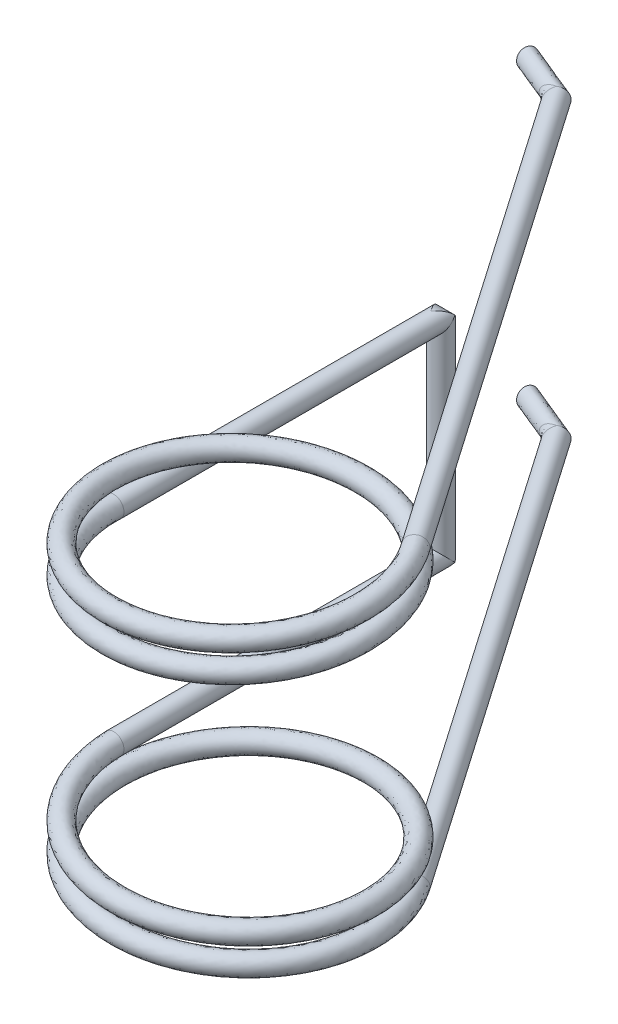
ISO-10303-21;
HEADER;
FILE_DESCRIPTION(('STEP AP214'),'2;1');
FILE_NAME('part.step','',(''),(''),'','','');
FILE_SCHEMA(('AUTOMOTIVE_DESIGN { 1 0 10303 214 1 1 1 1 }'));
ENDSEC;
DATA;
#1=APPLICATION_CONTEXT('core data for automotive mechanical design processes');
#2=APPLICATION_PROTOCOL_DEFINITION('international standard','automotive_design',2000,#1);
#3=PRODUCT_CONTEXT('',#1,'mechanical');
#4=PRODUCT('Part','Part','',(#3));
#5=PRODUCT_RELATED_PRODUCT_CATEGORY('part','',(#4));
#6=PRODUCT_DEFINITION_FORMATION('','',#4);
#7=PRODUCT_DEFINITION_CONTEXT('part definition',#1,'design');
#8=PRODUCT_DEFINITION('design','',#6,#7);
#9=PRODUCT_DEFINITION_SHAPE('','',#8);
#10=(LENGTH_UNIT() NAMED_UNIT(*) SI_UNIT(.MILLI.,.METRE.));
#11=(NAMED_UNIT(*) PLANE_ANGLE_UNIT() SI_UNIT($,.RADIAN.));
#12=(NAMED_UNIT(*) SI_UNIT($,.STERADIAN.) SOLID_ANGLE_UNIT());
#13=UNCERTAINTY_MEASURE_WITH_UNIT(LENGTH_MEASURE(1.E-05),#10,'distance_accuracy_value','');
#14=(GEOMETRIC_REPRESENTATION_CONTEXT(3) GLOBAL_UNCERTAINTY_ASSIGNED_CONTEXT((#13)) GLOBAL_UNIT_ASSIGNED_CONTEXT((#10,
#11,#12)) REPRESENTATION_CONTEXT('',''));
#15=CARTESIAN_POINT('',(0.,0.,0.));
#16=DIRECTION('',(0.,0.,1.));
#17=DIRECTION('',(1.,0.,0.));
#18=AXIS2_PLACEMENT_3D('',#15,#16,#17);
#19=CARTESIAN_POINT('',(0.444795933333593,1.83713971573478E-05,0.));
#20=CARTESIAN_POINT('',(0.444795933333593,0.0288820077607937,0.762347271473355));
#21=CARTESIAN_POINT('',(0.797827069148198,0.0866092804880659,2.28666879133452));
#22=CARTESIAN_POINT('',(2.28145367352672,0.173200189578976,4.10604324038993));
#23=CARTESIAN_POINT('',(4.41369469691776,0.259791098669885,5.08673138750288));
#24=CARTESIAN_POINT('',(6.76122749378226,0.346382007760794,5.02775286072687));
#25=CARTESIAN_POINT('',(8.84058800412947,0.432972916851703,3.94330970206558));
#26=CARTESIAN_POINT('',(10.234535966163,0.519563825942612,2.04832932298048));
#27=CARTESIAN_POINT('',(10.6439875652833,0.606154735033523,-0.254031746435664));
#28=CARTESIAN_POINT('',(9.80061469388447,0.72160928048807,-3.28461613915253));
#29=CARTESIAN_POINT('',(7.04400189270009,0.837063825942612,-5.20720592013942));
#30=CARTESIAN_POINT('',(3.90866359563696,0.952518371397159,-4.95158627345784));
#31=CARTESIAN_POINT('',(1.88954789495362,1.03910928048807,-3.77185813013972));
#32=CARTESIAN_POINT('',(0.592878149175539,1.12570018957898,-1.80908234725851));
#33=CARTESIAN_POINT('',(0.293627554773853,1.21229109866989,0.517006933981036));
#34=CARTESIAN_POINT('',(1.04937327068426,1.2988820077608,2.74015167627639));
#35=CARTESIAN_POINT('',(2.70627513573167,1.38547291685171,4.40275575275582));
#36=CARTESIAN_POINT('',(4.92622432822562,1.47206382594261,5.16547826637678));
#37=CARTESIAN_POINT('',(7.25539563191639,1.55865473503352,4.87386349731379));
#38=CARTESIAN_POINT('',(9.21770039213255,1.64524564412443,3.58544300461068));
#39=CARTESIAN_POINT('',(10.4128362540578,1.73183655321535,1.56542343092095));
#40=CARTESIAN_POINT('',(10.5963780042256,1.81842746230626,-0.77507400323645));
#41=CARTESIAN_POINT('',(10.0188753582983,1.87615473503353,-2.22918119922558));
#42=CARTESIAN_POINT('',(9.58484291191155,1.90501837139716,-2.85591016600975));
#43=CARTESIAN_POINT('',(0.444800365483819,0.13262742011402,0.));
#44=CARTESIAN_POINT('',(0.444800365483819,0.161491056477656,0.762346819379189));
#45=CARTESIAN_POINT('',(0.797831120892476,0.219218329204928,2.28666662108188));
#46=CARTESIAN_POINT('',(2.28145645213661,0.305809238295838,4.10603971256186));
#47=CARTESIAN_POINT('',(4.41369562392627,0.392400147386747,5.08672686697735));
#48=CARTESIAN_POINT('',(6.76122637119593,0.478991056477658,5.02774852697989));
#49=CARTESIAN_POINT('',(8.84058500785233,0.565581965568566,3.9433061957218));
#50=CARTESIAN_POINT('',(10.2345318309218,0.652172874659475,2.048327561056));
#51=CARTESIAN_POINT('',(10.6439829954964,0.738763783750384,-0.254031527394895));
#52=CARTESIAN_POINT('',(9.80061087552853,0.854218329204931,-3.28461329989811));
#53=CARTESIAN_POINT('',(7.04400054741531,0.969672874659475,-5.20720135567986));
#54=CARTESIAN_POINT('',(3.90866496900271,1.08512742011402,-4.95158190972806));
#55=CARTESIAN_POINT('',(1.88955097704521,1.17171832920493,-3.77185485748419));
#56=CARTESIAN_POINT('',(0.592882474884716,1.25830923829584,-1.80908074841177));
#57=CARTESIAN_POINT('',(0.293632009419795,1.34490014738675,0.517006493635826));
#58=CARTESIAN_POINT('',(1.04937719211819,1.43149105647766,2.74014923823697));
#59=CARTESIAN_POINT('',(2.70627750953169,1.51808196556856,4.40275195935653));
#60=CARTESIAN_POINT('',(4.92622480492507,1.60467287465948,5.16547367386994));
#61=CARTESIAN_POINT('',(7.25539408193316,1.69126378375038,4.87385929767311));
#62=CARTESIAN_POINT('',(9.21769705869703,1.7778546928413,3.5854398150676));
#63=CARTESIAN_POINT('',(10.4128319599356,1.8644456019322,1.56542211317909));
#64=CARTESIAN_POINT('',(10.5963734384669,1.95103651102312,-0.77507348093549));
#65=CARTESIAN_POINT('',(10.0188714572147,2.00876378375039,-2.22917904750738));
#66=CARTESIAN_POINT('',(9.58483926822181,2.03762742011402,-2.855907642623));
#67=CARTESIAN_POINT('',(0.317225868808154,0.397745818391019,0.));
#68=CARTESIAN_POINT('',(0.317225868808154,0.426609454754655,0.781723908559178));
#69=CARTESIAN_POINT('',(0.679238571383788,0.484336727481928,2.34482991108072));
#70=CARTESIAN_POINT('',(2.20059427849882,0.570927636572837,4.21046146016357));
#71=CARTESIAN_POINT('',(4.38705997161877,0.657518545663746,5.21609637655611));
#72=CARTESIAN_POINT('',(6.79429303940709,0.744109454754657,5.15561120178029));
#73=CARTESIAN_POINT('',(8.92653682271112,0.830700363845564,4.04359546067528));
#74=CARTESIAN_POINT('',(10.3559304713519,0.917291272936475,2.10041920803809));
#75=CARTESIAN_POINT('',(10.7757987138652,1.00388218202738,-0.260491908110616));
#76=CARTESIAN_POINT('',(9.91097721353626,1.11933672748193,-3.36814601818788));
#77=CARTESIAN_POINT('',(7.08425748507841,1.23479127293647,-5.33963164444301));
#78=CARTESIAN_POINT('',(3.86918511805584,1.35024581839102,-5.07751243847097));
#79=CARTESIAN_POINT('',(1.79872384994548,1.43683672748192,-3.8677794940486));
#80=CARTESIAN_POINT('',(0.469072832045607,1.52342763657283,-1.85509021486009));
#81=CARTESIAN_POINT('',(0.16221858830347,1.61001854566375,0.530154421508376));
#82=CARTESIAN_POINT('',(0.937177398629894,1.69660945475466,2.80983894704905));
#83=CARTESIAN_POINT('',(2.6362210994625,1.78320036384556,4.51472001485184));
#84=CARTESIAN_POINT('',(4.91262392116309,1.86979127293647,5.29684603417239));
#85=CARTESIAN_POINT('',(7.30102819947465,1.95638218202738,4.99780827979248));
#86=CARTESIAN_POINT('',(9.31323997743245,2.04297309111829,3.67662761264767));
#87=CARTESIAN_POINT('',(10.5387652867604,2.1295640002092,1.60523137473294));
#88=CARTESIAN_POINT('',(10.7269802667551,2.2161549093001,-0.79477724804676));
#89=CARTESIAN_POINT('',(10.1347830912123,2.27388218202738,-2.28588193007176));
#90=CARTESIAN_POINT('',(9.68971880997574,2.30274581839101,-2.92854051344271));
#91=CARTESIAN_POINT('',(-0.113303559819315,0.496145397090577,0.));
#92=CARTESIAN_POINT('',(-0.113303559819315,0.525009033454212,0.847180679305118));
#93=CARTESIAN_POINT('',(0.279000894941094,0.582736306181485,2.54107176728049));
#94=CARTESIAN_POINT('',(1.92769738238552,0.669327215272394,4.56288570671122));
#95=CARTESIAN_POINT('',(4.29717232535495,0.755918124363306,5.6526759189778));
#96=CARTESIAN_POINT('',(6.90589172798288,0.842509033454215,5.58714469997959));
#97=CARTESIAN_POINT('',(9.21659799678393,0.929099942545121,4.38203817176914));
#98=CARTESIAN_POINT('',(10.7656420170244,1.01569085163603,2.27622834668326));
#99=CARTESIAN_POINT('',(11.2206439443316,1.10228176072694,-0.282295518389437));
#100=CARTESIAN_POINT('',(10.2834384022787,1.21773630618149,-3.65006463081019));
#101=CARTESIAN_POINT('',(7.22012927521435,1.33319085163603,-5.78655864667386));
#102=CARTESIAN_POINT('',(3.73595181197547,1.44864539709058,-5.50249720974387));
#103=CARTESIAN_POINT('',(1.49218550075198,1.53523630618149,-4.19151664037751));
#104=CARTESIAN_POINT('',(0.0512558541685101,1.62182721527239,-2.01035960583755));
#105=CARTESIAN_POINT('',(-0.281298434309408,1.7084181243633,0.57452990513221));
#106=CARTESIAN_POINT('',(0.558540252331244,1.79500903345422,3.04501795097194));
#107=CARTESIAN_POINT('',(2.39978217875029,1.88159994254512,4.89261002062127));
#108=CARTESIAN_POINT('',(4.86672583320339,1.96819085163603,5.74018395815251));
#109=CARTESIAN_POINT('',(7.45504131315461,2.05478176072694,5.41613358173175));
#110=CARTESIAN_POINT('',(9.63566738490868,2.14137266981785,3.98435550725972));
#111=CARTESIAN_POINT('',(10.963779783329,2.22796357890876,1.73959586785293));
#112=CARTESIAN_POINT('',(11.1677347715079,2.31455448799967,-0.861319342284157));
#113=CARTESIAN_POINT('',(10.5259901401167,2.37228176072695,-2.4771859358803));
#114=CARTESIAN_POINT('',(10.043658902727,2.40114539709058,-3.17365681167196));
#115=CARTESIAN_POINT('',(-0.458554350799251,0.220840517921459,0.));
#116=CARTESIAN_POINT('',(-0.458554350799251,0.249704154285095,0.899623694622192));
#117=CARTESIAN_POINT('',(-0.0419433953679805,0.307431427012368,2.69847491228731));
#118=CARTESIAN_POINT('',(1.70886218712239,0.394022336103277,4.84548049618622));
#119=CARTESIAN_POINT('',(4.22508913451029,0.480613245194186,6.0027840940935));
#120=CARTESIAN_POINT('',(6.9953794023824,0.567204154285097,5.93317705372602));
#121=CARTESIAN_POINT('',(9.44920649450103,0.653795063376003,4.65344746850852));
#122=CARTESIAN_POINT('',(11.0941805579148,0.740385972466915,2.41720304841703));
#123=CARTESIAN_POINT('',(11.5773727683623,0.826976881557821,-0.299779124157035));
#124=CARTESIAN_POINT('',(10.5821195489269,0.942431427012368,-3.87612753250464));
#125=CARTESIAN_POINT('',(7.3290761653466,1.05788597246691,-6.14495107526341));
#126=CARTESIAN_POINT('',(3.62910877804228,1.17334051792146,-5.84329915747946));
#127=CARTESIAN_POINT('',(1.24638180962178,1.25993142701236,-4.45111535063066));
#128=CARTESIAN_POINT('',(-0.28380585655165,1.34652233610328,-2.13487355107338));
#129=CARTESIAN_POINT('',(-0.636940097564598,1.43311324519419,0.610111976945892));
#130=CARTESIAN_POINT('',(0.254897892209,1.5197041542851,3.23361672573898));
#131=CARTESIAN_POINT('',(2.21018982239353,1.606295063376,5.19562708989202));
#132=CARTESIAN_POINT('',(4.82991825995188,1.69288597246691,6.09571234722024));
#133=CARTESIAN_POINT('',(7.57854001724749,1.77947688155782,5.75157440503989));
#134=CARTESIAN_POINT('',(9.89423192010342,1.86606779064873,4.23113380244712));
#135=CARTESIAN_POINT('',(11.3045903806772,1.95265869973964,1.84733141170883));
#136=CARTESIAN_POINT('',(11.521191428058,2.03924960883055,-0.914645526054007));
#137=CARTESIAN_POINT('',(10.839680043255,2.09697688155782,-2.63063632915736));
#138=CARTESIAN_POINT('',(10.3274910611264,2.12584051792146,-3.37022083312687));
#139=CARTESIAN_POINT('',(-0.458264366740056,-0.220677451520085,0.));
#140=CARTESIAN_POINT('',(-0.458264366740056,-0.191813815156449,0.899592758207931));
#141=CARTESIAN_POINT('',(-0.0416778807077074,-0.134086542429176,2.69833383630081));
#142=CARTESIAN_POINT('',(1.70904417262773,-0.047495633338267,4.84524906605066));
#143=CARTESIAN_POINT('',(4.22514977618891,0.0390952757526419,6.00248848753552));
#144=CARTESIAN_POINT('',(6.99530579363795,0.125686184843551,5.93289284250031));
#145=CARTESIAN_POINT('',(9.44901051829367,0.21227709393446,4.65321819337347));
#146=CARTESIAN_POINT('',(11.0939094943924,0.298868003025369,2.41708747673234));
#147=CARTESIAN_POINT('',(11.5770737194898,0.385458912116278,-0.29976475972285));
#148=CARTESIAN_POINT('',(10.5818696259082,0.500913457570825,-3.8759413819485));
#149=CARTESIAN_POINT('',(7.32898781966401,0.616368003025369,-6.14465221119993));
#150=CARTESIAN_POINT('',(3.62919862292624,0.731822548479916,-5.84301358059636));
#151=CARTESIAN_POINT('',(1.24658391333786,0.818413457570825,-4.45090086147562));
#152=CARTESIAN_POINT('',(-0.283522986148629,0.905004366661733,-2.13476894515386));
#153=CARTESIAN_POINT('',(-0.636647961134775,0.99159527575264,0.610083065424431));
#154=CARTESIAN_POINT('',(0.255154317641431,1.07818618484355,3.23345731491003));
#155=CARTESIAN_POINT('',(2.21034550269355,1.16477709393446,5.19537830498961));
#156=CARTESIAN_POINT('',(4.82994942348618,1.25136800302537,6.09541204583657));
#157=CARTESIAN_POINT('',(7.57843838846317,1.33795891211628,5.75129897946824));
#158=CARTESIAN_POINT('',(9.89401390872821,1.42454982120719,4.23092525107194));
#159=CARTESIAN_POINT('',(11.3043089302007,1.5111407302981,1.84724479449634));
#160=CARTESIAN_POINT('',(11.5208928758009,1.59773163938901,-0.914610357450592));
#161=CARTESIAN_POINT('',(10.8394240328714,1.65545891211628,-2.63049666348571));
#162=CARTESIAN_POINT('',(10.3272526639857,1.68432254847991,-3.37005573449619));
#163=CARTESIAN_POINT('',(-0.113213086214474,-0.496219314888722,0.));
#164=CARTESIAN_POINT('',(-0.113213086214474,-0.467355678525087,0.84716299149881));
#165=CARTESIAN_POINT('',(0.279086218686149,-0.409628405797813,2.54103318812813));
#166=CARTESIAN_POINT('',(1.9277552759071,-0.323037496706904,4.56280986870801));
#167=CARTESIAN_POINT('',(4.29719118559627,-0.236446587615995,5.65258463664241));
#168=CARTESIAN_POINT('',(6.90586781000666,-0.149855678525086,5.58705208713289));
#169=CARTESIAN_POINT('',(9.21653722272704,-0.0632647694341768,4.38196744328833));
#170=CARTESIAN_POINT('',(10.7655544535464,0.0233261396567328,2.27619055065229));
#171=CARTESIAN_POINT('',(11.2205502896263,0.109917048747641,-0.282290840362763));
#172=CARTESIAN_POINT('',(10.2833598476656,0.225371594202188,-3.65000426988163));
#173=CARTESIAN_POINT('',(7.22009977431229,0.340826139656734,-5.78646407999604));
#174=CARTESIAN_POINT('',(3.7359797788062,0.456280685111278,-5.50240770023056));
#175=CARTESIAN_POINT('',(1.49225122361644,0.542871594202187,-4.19144754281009));
#176=CARTESIAN_POINT('',(0.051343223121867,0.629462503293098,-2.01032698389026));
#177=CARTESIAN_POINT('',(-0.281203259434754,0.716053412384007,0.574520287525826));
#178=CARTESIAN_POINT('',(0.558619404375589,0.802644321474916,3.04496882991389));
#179=CARTESIAN_POINT('',(2.39983293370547,0.889235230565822,4.89252889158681));
#180=CARTESIAN_POINT('',(4.86673540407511,0.975826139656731,5.7400912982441));
#181=CARTESIAN_POINT('',(7.45500831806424,1.06241704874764,5.41604377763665));
#182=CARTESIAN_POINT('',(9.63559987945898,1.14900795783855,3.98429122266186));
#183=CARTESIAN_POINT('',(10.9636890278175,1.23559886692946,1.7395664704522));
#184=CARTESIAN_POINT('',(11.1676426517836,1.32218977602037,-0.861302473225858));
#185=CARTESIAN_POINT('',(10.5259056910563,1.37991704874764,-2.47714896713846));
#186=CARTESIAN_POINT('',(10.0435845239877,1.40878068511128,-3.17360530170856));
#187=CARTESIAN_POINT('',(0.317199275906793,-0.397908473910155,0.));
#188=CARTESIAN_POINT('',(0.317199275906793,-0.369044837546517,0.781726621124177));
#189=CARTESIAN_POINT('',(0.679214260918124,-0.311317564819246,2.34484293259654));
#190=CARTESIAN_POINT('',(2.20057760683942,-0.224726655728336,4.21048262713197));
#191=CARTESIAN_POINT('',(4.38705440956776,-0.138135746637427,5.21612349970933));
#192=CARTESIAN_POINT('',(6.79429977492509,-0.0515448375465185,5.15563720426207));
#193=CARTESIAN_POINT('',(8.9265548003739,0.0350460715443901,4.04361649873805));
#194=CARTESIAN_POINT('',(10.355955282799,0.1216369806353,2.10042977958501));
#195=CARTESIAN_POINT('',(10.7758261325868,0.208227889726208,-0.260493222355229));
#196=CARTESIAN_POINT('',(9.91100012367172,0.323682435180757,-3.36816305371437));
#197=CARTESIAN_POINT('',(7.08426555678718,0.439136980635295,-5.33965903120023));
#198=CARTESIAN_POINT('',(3.86917687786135,0.554591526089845,-5.07753862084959));
#199=CARTESIAN_POINT('',(1.79870535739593,0.641182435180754,-3.86779912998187));
#200=CARTESIAN_POINT('',(0.469046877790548,0.727773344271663,-1.85509980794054));
#201=CARTESIAN_POINT('',(0.162191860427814,0.814364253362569,0.530157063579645));
#202=CARTESIAN_POINT('',(0.937153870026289,0.90095516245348,2.80985357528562));
#203=CARTESIAN_POINT('',(2.6362068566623,0.987546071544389,4.51474277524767));
#204=CARTESIAN_POINT('',(4.91262106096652,1.0741369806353,5.29687358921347));
#205=CARTESIAN_POINT('',(7.30103749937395,1.16072788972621,4.99783347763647));
#206=CARTESIAN_POINT('',(9.31325997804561,1.24731879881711,3.67664674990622));
#207=CARTESIAN_POINT('',(10.5387910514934,1.33390970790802,1.60523928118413));
#208=CARTESIAN_POINT('',(10.7270076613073,1.42050061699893,-0.794780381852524));
#209=CARTESIAN_POINT('',(10.1348064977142,1.47822788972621,-2.28589484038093));
#210=CARTESIAN_POINT('',(9.68974067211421,1.50709152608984,-2.92855565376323));
#211=CARTESIAN_POINT('',(0.444791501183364,-0.132590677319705,0.));
#212=CARTESIAN_POINT('',(0.444791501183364,-0.103727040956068,0.762347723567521));
#213=CARTESIAN_POINT('',(0.797823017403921,-0.0459997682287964,2.28667096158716));
#214=CARTESIAN_POINT('',(2.28145089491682,0.0405911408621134,4.106046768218));
#215=CARTESIAN_POINT('',(4.41369376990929,0.127182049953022,5.08673590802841));
#216=CARTESIAN_POINT('',(6.76122861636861,0.213772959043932,5.02775719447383));
#217=CARTESIAN_POINT('',(8.84059100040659,0.300363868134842,3.9433132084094));
#218=CARTESIAN_POINT('',(10.2345401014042,0.386954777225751,2.04833108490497));
#219=CARTESIAN_POINT('',(10.6439921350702,0.47354568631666,-0.254031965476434));
#220=CARTESIAN_POINT('',(9.80061851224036,0.589000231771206,-3.28461897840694));
#221=CARTESIAN_POINT('',(7.04400323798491,0.704454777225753,-5.20721048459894));
#222=CARTESIAN_POINT('',(3.9086622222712,0.819909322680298,-4.95159063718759));
#223=CARTESIAN_POINT('',(1.88954481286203,0.906500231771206,-3.77186140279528));
#224=CARTESIAN_POINT('',(0.592873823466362,0.993091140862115,-1.80908394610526));
#225=CARTESIAN_POINT('',(0.293623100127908,1.07968204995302,0.517007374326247));
#226=CARTESIAN_POINT('',(1.04936934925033,1.16627295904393,2.74015411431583));
#227=CARTESIAN_POINT('',(2.70627276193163,1.25286386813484,4.40275954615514));
#228=CARTESIAN_POINT('',(4.92622385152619,1.33945477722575,5.16548285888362));
#229=CARTESIAN_POINT('',(7.2553971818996,1.42604568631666,4.87386769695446));
#230=CARTESIAN_POINT('',(9.21770372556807,1.51263659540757,3.58544619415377));
#231=CARTESIAN_POINT('',(10.4128405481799,1.59922750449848,1.56542474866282));
#232=CARTESIAN_POINT('',(10.5963825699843,1.68581841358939,-0.775074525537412));
#233=CARTESIAN_POINT('',(10.0188792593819,1.74354568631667,-2.22918335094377));
#234=CARTESIAN_POINT('',(9.58484655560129,1.7724093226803,-2.85591268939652));
#235=CARTESIAN_POINT('',(0.444795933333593,1.83713971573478E-05,0.));
#236=CARTESIAN_POINT('',(0.444795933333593,0.0288820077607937,0.762347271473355));
#237=CARTESIAN_POINT('',(0.797827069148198,0.0866092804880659,2.28666879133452));
#238=CARTESIAN_POINT('',(2.28145367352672,0.173200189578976,4.10604324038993));
#239=CARTESIAN_POINT('',(4.41369469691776,0.259791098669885,5.08673138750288));
#240=CARTESIAN_POINT('',(6.76122749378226,0.346382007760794,5.02775286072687));
#241=CARTESIAN_POINT('',(8.84058800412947,0.432972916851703,3.94330970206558));
#242=CARTESIAN_POINT('',(10.234535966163,0.519563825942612,2.04832932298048));
#243=CARTESIAN_POINT('',(10.6439875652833,0.606154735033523,-0.254031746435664));
#244=CARTESIAN_POINT('',(9.80061469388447,0.72160928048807,-3.28461613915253));
#245=CARTESIAN_POINT('',(7.04400189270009,0.837063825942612,-5.20720592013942));
#246=CARTESIAN_POINT('',(3.90866359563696,0.952518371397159,-4.95158627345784));
#247=CARTESIAN_POINT('',(1.88954789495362,1.03910928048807,-3.77185813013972));
#248=CARTESIAN_POINT('',(0.592878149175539,1.12570018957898,-1.80908234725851));
#249=CARTESIAN_POINT('',(0.293627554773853,1.21229109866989,0.517006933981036));
#250=CARTESIAN_POINT('',(1.04937327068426,1.2988820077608,2.74015167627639));
#251=CARTESIAN_POINT('',(2.70627513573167,1.38547291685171,4.40275575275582));
#252=CARTESIAN_POINT('',(4.92622432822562,1.47206382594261,5.16547826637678));
#253=CARTESIAN_POINT('',(7.25539563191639,1.55865473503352,4.87386349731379));
#254=CARTESIAN_POINT('',(9.21770039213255,1.64524564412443,3.58544300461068));
#255=CARTESIAN_POINT('',(10.4128362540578,1.73183655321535,1.56542343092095));
#256=CARTESIAN_POINT('',(10.5963780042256,1.81842746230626,-0.77507400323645));
#257=CARTESIAN_POINT('',(10.0188753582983,1.87615473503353,-2.22918119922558));
#258=CARTESIAN_POINT('',(9.58484291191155,1.90501837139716,-2.85591016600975));
#259=(BOUNDED_SURFACE() B_SPLINE_SURFACE(3,3,((#19,#20,#21,#22,#23,#24,#25,#26,#27,#28,#29,#30,
#31,#32,#33,#34,#35,#36,#37,#38,#39,#40,#41,#42),(#43,#44,#45,#46,#47,#48,#49,#50,#51,#52,#53,
#54,#55,#56,#57,#58,#59,#60,#61,#62,#63,#64,#65,#66),(#67,#68,#69,#70,#71,#72,#73,#74,#75,#76,
#77,#78,#79,#80,#81,#82,#83,#84,#85,#86,#87,#88,#89,#90),(#91,#92,#93,#94,#95,#96,#97,#98,#99,
#100,#101,#102,#103,#104,#105,#106,#107,#108,#109,#110,#111,#112,#113,#114),(#115,#116,#117,
#118,#119,#120,#121,#122,#123,#124,#125,#126,#127,#128,#129,#130,#131,#132,#133,#134,#135,#136,
#137,#138),(#139,#140,#141,#142,#143,#144,#145,#146,#147,#148,#149,#150,#151,#152,#153,#154,
#155,#156,#157,#158,#159,#160,#161,#162),(#163,#164,#165,#166,#167,#168,#169,#170,#171,#172,
#173,#174,#175,#176,#177,#178,#179,#180,#181,#182,#183,#184,#185,#186),(#187,#188,#189,#190,
#191,#192,#193,#194,#195,#196,#197,#198,#199,#200,#201,#202,#203,#204,#205,#206,#207,#208,#209,
#210),(#211,#212,#213,#214,#215,#216,#217,#218,#219,#220,#221,#222,#223,#224,#225,#226,#227,
#228,#229,#230,#231,#232,#233,#234),(#235,#236,#237,#238,#239,#240,#241,#242,#243,#244,#245,
#246,#247,#248,#249,#250,#251,#252,#253,#254,#255,#256,#257,#258)),.UNSPECIFIED.,.T.,.F.,
.F.) B_SPLINE_SURFACE_WITH_KNOTS((4,1,1,1,1,1,1,4),(4,1,1,1,1,1,1,1,1,1,1,1,1,1,1,1,1,1,1,1,1,
4),(-3.1415926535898,-2.24399475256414,-1.34639685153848,-0.448798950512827,0.448798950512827,
1.34639685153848,2.24399475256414,3.1415926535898),(0.,0.455930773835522,0.911861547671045,
1.36779232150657,1.82372309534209,2.27965386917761,2.73558464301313,3.19151541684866,
3.64744619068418,4.55930773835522,5.01523851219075,5.47116928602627,5.92710005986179,
6.38303083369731,6.83896160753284,7.29489238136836,7.75082315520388,8.2067539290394,
8.66268470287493,9.11861547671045,9.57454625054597,10.0304770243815),
.UNSPECIFIED.) GEOMETRIC_REPRESENTATION_ITEM() RATIONAL_B_SPLINE_SURFACE(((1.,1.,1.,1.,1.,1.,1.,
1.,1.,1.,1.,1.,1.,1.,1.,1.,1.,1.,1.,1.,1.,1.,1.,1.),(1.,1.,1.,1.,1.,1.,1.,1.,1.,1.,1.,1.,1.,1.,
1.,1.,1.,1.,1.,1.,1.,1.,1.,1.),(1.,1.,1.,1.,1.,1.,1.,1.,1.,1.,1.,1.,1.,1.,1.,1.,1.,1.,1.,1.,1.,
1.,1.,1.),(1.,1.,1.,1.,1.,1.,1.,1.,1.,1.,1.,1.,1.,1.,1.,1.,1.,1.,1.,1.,1.,1.,1.,1.),(1.,1.,1.,
1.,1.,1.,1.,1.,1.,1.,1.,1.,1.,1.,1.,1.,1.,1.,1.,1.,1.,1.,1.,1.),(1.,1.,1.,1.,1.,1.,1.,1.,1.,1.,
1.,1.,1.,1.,1.,1.,1.,1.,1.,1.,1.,1.,1.,1.),(1.,1.,1.,1.,1.,1.,1.,1.,1.,1.,1.,1.,1.,1.,1.,1.,1.,
1.,1.,1.,1.,1.,1.,1.),(1.,1.,1.,1.,1.,1.,1.,1.,1.,1.,1.,1.,1.,1.,1.,1.,1.,1.,1.,1.,1.,1.,1.,1.),
(1.,1.,1.,1.,1.,1.,1.,1.,1.,1.,1.,1.,1.,1.,1.,1.,1.,1.,1.,1.,1.,1.,1.,1.),(1.,1.,1.,1.,1.,1.,1.,
1.,1.,1.,1.,1.,1.,1.,1.,1.,1.,1.,1.,1.,1.,1.,1.,1.))) REPRESENTATION_ITEM('') SURFACE());
#260=CARTESIAN_POINT('',(0.444795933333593,1.83714136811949E-05,4.36428368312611E-10));
#261=CARTESIAN_POINT('',(0.444800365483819,0.132627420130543,4.3642810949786E-10));
#262=CARTESIAN_POINT('',(0.317225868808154,0.397745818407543,4.47521100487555E-10));
#263=CARTESIAN_POINT('',(-0.113303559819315,0.496145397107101,4.84993775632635E-10));
#264=CARTESIAN_POINT('',(-0.458554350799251,0.220840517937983,5.15016339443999E-10));
#265=CARTESIAN_POINT('',(-0.458264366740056,-0.220677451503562,5.14998628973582E-10));
#266=CARTESIAN_POINT('',(-0.113213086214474,-0.496219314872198,4.84983649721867E-10));
#267=CARTESIAN_POINT('',(0.317199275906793,-0.397908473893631,4.47522653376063E-10));
#268=CARTESIAN_POINT('',(0.444791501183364,-0.132590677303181,4.36428627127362E-10));
#269=CARTESIAN_POINT('',(0.444795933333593,1.83714136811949E-05,4.36428368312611E-10));
#270=(BOUNDED_CURVE() B_SPLINE_CURVE(3,(#260,#261,#262,#263,#264,#265,#266,#267,#268,#269),
.UNSPECIFIED.,.T.,.F.) B_SPLINE_CURVE_WITH_KNOTS((4,1,1,1,1,1,1,4),(-3.1415926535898,
-2.24399475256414,-1.34639685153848,-0.448798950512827,0.448798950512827,1.34639685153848,
2.24399475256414,3.1415926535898),
.UNSPECIFIED.) CURVE() GEOMETRIC_REPRESENTATION_ITEM() RATIONAL_B_SPLINE_CURVE((1.,1.,1.,1.,1.,
1.,1.,1.,1.,1.)) REPRESENTATION_ITEM(''));
#271=CARTESIAN_POINT('',(0.444795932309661,-2.30553013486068E-08,8.72856734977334E-10));
#272=VERTEX_POINT('',#271);
#273=CARTESIAN_POINT('',(-0.444028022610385,3.05035737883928E-07,0.));
#274=VERTEX_POINT('',#273);
#275=EDGE_CURVE('E43',#272,#274,#270,.F.);
#276=CARTESIAN_POINT('',(0.444795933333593,1.83713971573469E-05,0.));
#277=CARTESIAN_POINT('',(0.444795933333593,0.0288820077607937,0.762347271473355));
#278=CARTESIAN_POINT('',(0.797827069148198,0.0866092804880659,2.28666879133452));
#279=CARTESIAN_POINT('',(2.28145367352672,0.173200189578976,4.10604324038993));
#280=CARTESIAN_POINT('',(4.41369469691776,0.259791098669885,5.08673138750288));
#281=CARTESIAN_POINT('',(6.76122749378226,0.346382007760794,5.02775286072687));
#282=CARTESIAN_POINT('',(8.84058800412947,0.432972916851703,3.94330970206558));
#283=CARTESIAN_POINT('',(10.234535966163,0.519563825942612,2.04832932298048));
#284=CARTESIAN_POINT('',(10.6439875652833,0.606154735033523,-0.254031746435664));
#285=CARTESIAN_POINT('',(9.80061469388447,0.72160928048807,-3.28461613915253));
#286=CARTESIAN_POINT('',(7.04400189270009,0.837063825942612,-5.20720592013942));
#287=CARTESIAN_POINT('',(3.90866359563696,0.952518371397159,-4.95158627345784));
#288=CARTESIAN_POINT('',(1.88954789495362,1.03910928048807,-3.77185813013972));
#289=CARTESIAN_POINT('',(0.592878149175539,1.12570018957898,-1.80908234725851));
#290=CARTESIAN_POINT('',(0.293627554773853,1.21229109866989,0.517006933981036));
#291=CARTESIAN_POINT('',(1.04937327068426,1.2988820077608,2.74015167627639));
#292=CARTESIAN_POINT('',(2.70627513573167,1.38547291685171,4.40275575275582));
#293=CARTESIAN_POINT('',(4.92622432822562,1.47206382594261,5.16547826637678));
#294=CARTESIAN_POINT('',(7.25539563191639,1.55865473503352,4.87386349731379));
#295=CARTESIAN_POINT('',(9.21770039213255,1.64524564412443,3.58544300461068));
#296=CARTESIAN_POINT('',(10.4128362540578,1.73183655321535,1.56542343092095));
#297=CARTESIAN_POINT('',(10.5963779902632,1.81842745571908,-0.775073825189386));
#298=CARTESIAN_POINT('',(10.0188754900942,1.87615472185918,-2.22918086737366));
#299=CARTESIAN_POINT('',(9.58484320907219,1.90501835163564,-2.85590973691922));
#300=(BOUNDED_CURVE() B_SPLINE_CURVE(3,(#276,#277,#278,#279,#280,#281,#282,#283,#284,#285,#286,
#287,#288,#289,#290,#291,#292,#293,#294,#295,#296,#297,#298,#299),.UNSPECIFIED.,.F.,
.F.) B_SPLINE_CURVE_WITH_KNOTS((4,1,1,1,1,1,1,1,1,1,1,1,1,1,1,1,1,1,1,1,1,4),(0.,
0.455930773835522,0.911861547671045,1.36779232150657,1.82372309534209,2.27965386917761,
2.73558464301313,3.19151541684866,3.64744619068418,4.55930773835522,5.01523851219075,
5.47116928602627,5.92710005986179,6.38303083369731,6.83896160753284,7.29489238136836,
7.75082315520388,8.2067539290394,8.66268470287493,9.11861547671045,9.57454625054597,
10.0304769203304),
.UNSPECIFIED.) CURVE() GEOMETRIC_REPRESENTATION_ITEM() RATIONAL_B_SPLINE_CURVE((1.,1.,1.,1.,1.,
1.,1.,1.,1.,1.,1.,1.,1.,1.,1.,1.,1.,1.,1.,1.,1.,1.,1.,1.)) REPRESENTATION_ITEM(''));
#301=CARTESIAN_POINT('',(9.5848429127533,1.90499997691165,-2.85591016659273));
#302=VERTEX_POINT('',#301);
#303=EDGE_CURVE('E11',#272,#302,#300,.T.);
#304=CARTESIAN_POINT('',(9.58484291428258,1.90501837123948,-2.85591016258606));
#305=CARTESIAN_POINT('',(9.58484655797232,1.77240932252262,-2.85591268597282));
#306=CARTESIAN_POINT('',(9.68974067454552,1.50709152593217,-2.92855565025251));
#307=CARTESIAN_POINT('',(10.0435845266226,1.4087806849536,-3.17360529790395));
#308=CARTESIAN_POINT('',(10.3272526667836,1.68432254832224,-3.37005573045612));
#309=CARTESIAN_POINT('',(10.3274910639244,2.12584051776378,-3.37022082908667));
#310=CARTESIAN_POINT('',(10.0436589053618,2.4011453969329,-3.17365680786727));
#311=CARTESIAN_POINT('',(9.68971881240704,2.30274581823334,-2.928540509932));
#312=CARTESIAN_POINT('',(9.58483927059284,2.03762741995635,-2.85590763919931));
#313=CARTESIAN_POINT('',(9.58484291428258,1.90501837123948,-2.85591016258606));
#314=(BOUNDED_CURVE() B_SPLINE_CURVE(3,(#304,#305,#306,#307,#308,#309,#310,#311,#312,#313),
.UNSPECIFIED.,.T.,.F.) B_SPLINE_CURVE_WITH_KNOTS((4,1,1,1,1,1,1,4),(-3.1415926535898,
-2.24399475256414,-1.34639685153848,-0.448798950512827,0.448798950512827,1.34639685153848,
2.24399475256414,3.1415926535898),
.UNSPECIFIED.) CURVE() GEOMETRIC_REPRESENTATION_ITEM() RATIONAL_B_SPLINE_CURVE((1.,1.,1.,1.,1.,
1.,1.,1.,1.,1.)) REPRESENTATION_ITEM(''));
#315=CARTESIAN_POINT('',(10.3155489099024,1.90500030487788,-3.36195045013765));
#316=VERTEX_POINT('',#315);
#317=EDGE_CURVE('E113',#316,#302,#314,.F.);
#318=CARTESIAN_POINT('',(9.58484291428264,1.90501837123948,-2.85591016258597));
#319=CARTESIAN_POINT('',(9.58484655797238,1.77240932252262,-2.85591268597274));
#320=CARTESIAN_POINT('',(9.68974067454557,1.50709152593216,-2.92855565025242));
#321=CARTESIAN_POINT('',(10.0435845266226,1.4087806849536,-3.17360529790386));
#322=CARTESIAN_POINT('',(10.3272526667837,1.68432254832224,-3.37005573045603));
#323=CARTESIAN_POINT('',(10.3274910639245,2.12584051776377,-3.37022082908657));
#324=CARTESIAN_POINT('',(10.0436589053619,2.4011453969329,-3.17365680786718));
#325=CARTESIAN_POINT('',(9.6897188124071,2.30274581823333,-2.92854050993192));
#326=CARTESIAN_POINT('',(9.5848392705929,2.03762741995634,-2.85590763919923));
#327=CARTESIAN_POINT('',(9.58484291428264,1.90501837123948,-2.85591016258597));
#328=(BOUNDED_CURVE() B_SPLINE_CURVE(3,(#318,#319,#320,#321,#322,#323,#324,#325,#326,#327),
.UNSPECIFIED.,.T.,.F.) B_SPLINE_CURVE_WITH_KNOTS((4,1,1,1,1,1,1,4),(-3.1415926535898,
-2.24399475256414,-1.34639685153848,-0.448798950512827,0.448798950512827,1.34639685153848,
2.24399475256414,3.1415926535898),
.UNSPECIFIED.) CURVE() GEOMETRIC_REPRESENTATION_ITEM() RATIONAL_B_SPLINE_CURVE((1.,1.,1.,1.,1.,
1.,1.,1.,1.,1.)) REPRESENTATION_ITEM(''));
#329=EDGE_CURVE('E245',#302,#316,#328,.F.);
#330=CARTESIAN_POINT('',(0.444795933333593,1.83714133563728E-05,4.2784915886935E-10));
#331=CARTESIAN_POINT('',(0.444800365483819,0.132627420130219,4.2784890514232E-10));
#332=CARTESIAN_POINT('',(0.317225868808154,0.397745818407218,4.3872383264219E-10));
#333=CARTESIAN_POINT('',(-0.113303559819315,0.496145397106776,4.75459878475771E-10));
#334=CARTESIAN_POINT('',(-0.458554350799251,0.220840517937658,5.04892265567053E-10));
#335=CARTESIAN_POINT('',(-0.458264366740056,-0.220677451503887,5.04874903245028E-10));
#336=CARTESIAN_POINT('',(-0.113213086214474,-0.496219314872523,4.7544995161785E-10));
#337=CARTESIAN_POINT('',(0.317199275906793,-0.397908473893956,4.38725355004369E-10));
#338=CARTESIAN_POINT('',(0.444791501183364,-0.132590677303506,4.27849412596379E-10));
#339=CARTESIAN_POINT('',(0.444795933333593,1.83714133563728E-05,4.2784915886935E-10));
#340=(BOUNDED_CURVE() B_SPLINE_CURVE(3,(#330,#331,#332,#333,#334,#335,#336,#337,#338,#339),
.UNSPECIFIED.,.T.,.F.) B_SPLINE_CURVE_WITH_KNOTS((4,1,1,1,1,1,1,4),(-3.1415926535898,
-2.24399475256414,-1.34639685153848,-0.448798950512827,0.448798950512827,1.34639685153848,
2.24399475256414,3.1415926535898),
.UNSPECIFIED.) CURVE() GEOMETRIC_REPRESENTATION_ITEM() RATIONAL_B_SPLINE_CURVE((1.,1.,1.,1.,1.,
1.,1.,1.,1.,1.)) REPRESENTATION_ITEM(''));
#341=EDGE_CURVE('E192',#274,#272,#340,.F.);
#342=ORIENTED_EDGE('',*,*,#275,.F.);
#343=ORIENTED_EDGE('',*,*,#303,.T.);
#344=ORIENTED_EDGE('',*,*,#317,.F.);
#345=ORIENTED_EDGE('',*,*,#329,.F.);
#346=ORIENTED_EDGE('',*,*,#303,.F.);
#347=ORIENTED_EDGE('',*,*,#341,.F.);
#348=EDGE_LOOP('',(#342,#343,#344,#345,#346,#347));
#349=FACE_BOUND('',#348,.T.);
#350=ADVANCED_FACE('F16',(#349),#259,.T.);
#351=CARTESIAN_POINT('',(9.95051155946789,1.905,-3.10914891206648));
#352=DIRECTION('',(-0.569336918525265,0.,-0.822104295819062));
#353=DIRECTION('',(0.822104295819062,0.,-0.569336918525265));
#354=AXIS2_PLACEMENT_3D('',#351,#352,#353);
#355=CYLINDRICAL_SURFACE('',#354,0.4445);
#356=CARTESIAN_POINT('',(-3.78758828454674,1.4605,-22.9465255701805));
#357=CARTESIAN_POINT('',(-3.78789615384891,1.46067538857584,-22.9459126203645));
#358=CARTESIAN_POINT('',(-3.78818174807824,1.4605057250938,-22.9451927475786));
#359=CARTESIAN_POINT('',(-3.87541124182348,1.45942718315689,-22.747263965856));
#360=CARTESIAN_POINT('',(-4.00639684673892,1.65430667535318,-22.4704087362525));
#361=CARTESIAN_POINT('',(-4.00639684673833,2.15569332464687,-22.4704087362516));
#362=CARTESIAN_POINT('',(-3.87541124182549,2.35057281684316,-22.7472639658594));
#363=CARTESIAN_POINT('',(-3.78818174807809,2.34949427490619,-22.9451927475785));
#364=CARTESIAN_POINT('',(-3.78789615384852,2.34932461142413,-22.9459126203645));
#365=CARTESIAN_POINT('',(-3.78758828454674,2.3495,-22.9465255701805));
#366=(BOUNDED_CURVE() B_SPLINE_CURVE(3,(#356,#357,#358,#359,#360,#361,#362,#363,#364,#365),
.UNSPECIFIED.,.F.,.F.) B_SPLINE_CURVE_WITH_KNOTS((4,2,1,1,2,4),(-0.419777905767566,
-0.419204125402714,-0.251522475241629,-0.167681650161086,0.,0.000573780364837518),
.UNSPECIFIED.) CURVE() GEOMETRIC_REPRESENTATION_ITEM() RATIONAL_B_SPLINE_CURVE((1.,1.,1.,1.,1.,
1.,1.,1.,1.,1.)) REPRESENTATION_ITEM(''));
#367=CARTESIAN_POINT('',(-3.78758828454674,1.4605,-22.9465255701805));
#368=VERTEX_POINT('',#367);
#369=CARTESIAN_POINT('',(-3.79320427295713,1.46057212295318,-22.933809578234));
#370=VERTEX_POINT('',#369);
#371=EDGE_CURVE('E664',#368,#370,#366,.T.);
#372=ORIENTED_EDGE('',*,*,#371,.F.);
#373=CARTESIAN_POINT('',(-3.78758828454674,1.905,-22.9465255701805));
#374=DIRECTION('',(-0.569336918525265,0.,-0.822104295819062));
#375=DIRECTION('',(0.822104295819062,0.,-0.569336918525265));
#376=AXIS2_PLACEMENT_3D('',#373,#374,#375);
#377=CIRCLE('',#376,0.4445);
#378=CARTESIAN_POINT('',(-3.78872389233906,2.34949741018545,-22.9462999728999));
#379=VERTEX_POINT('',#378);
#380=EDGE_CURVE('E322',#379,#368,#377,.T.);
#381=ORIENTED_EDGE('',*,*,#380,.F.);
#382=CARTESIAN_POINT('',(-3.78758828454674,1.4605,-22.9465255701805));
#383=CARTESIAN_POINT('',(-3.78789615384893,1.46067538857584,-22.9459126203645));
#384=CARTESIAN_POINT('',(-3.78818174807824,1.46050572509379,-22.9451927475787));
#385=CARTESIAN_POINT('',(-3.87541124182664,1.45942718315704,-22.7472639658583));
#386=CARTESIAN_POINT('',(-4.00639684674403,1.65430667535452,-22.4704087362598));
#387=CARTESIAN_POINT('',(-4.00639684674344,2.15569332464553,-22.4704087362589));
#388=CARTESIAN_POINT('',(-3.87541124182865,2.35057281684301,-22.7472639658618));
#389=CARTESIAN_POINT('',(-3.78818174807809,2.3494942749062,-22.9451927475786));
#390=CARTESIAN_POINT('',(-3.78789615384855,2.34932461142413,-22.9459126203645));
#391=CARTESIAN_POINT('',(-3.78758828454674,2.3495,-22.9465255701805));
#392=(BOUNDED_CURVE() B_SPLINE_CURVE(3,(#382,#383,#384,#385,#386,#387,#388,#389,#390,#391),
.UNSPECIFIED.,.F.,.F.) B_SPLINE_CURVE_WITH_KNOTS((4,2,1,1,2,4),(-0.419777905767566,
-0.419204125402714,-0.251522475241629,-0.167681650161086,0.,0.000573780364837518),
.UNSPECIFIED.) CURVE() GEOMETRIC_REPRESENTATION_ITEM() RATIONAL_B_SPLINE_CURVE((1.,1.,1.,1.,1.,
1.,1.,1.,1.,1.)) REPRESENTATION_ITEM(''));
#393=CARTESIAN_POINT('',(-3.79320427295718,2.34942787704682,-22.9338095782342));
#394=VERTEX_POINT('',#393);
#395=EDGE_CURVE('E301',#394,#379,#392,.T.);
#396=ORIENTED_EDGE('',*,*,#395,.F.);
#397=CARTESIAN_POINT('',(-3.78758828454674,1.4605,-22.9465255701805));
#398=CARTESIAN_POINT('',(-3.78789615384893,1.46067538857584,-22.9459126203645));
#399=CARTESIAN_POINT('',(-3.78818174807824,1.46050572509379,-22.9451927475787));
#400=CARTESIAN_POINT('',(-3.87541124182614,1.45942718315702,-22.747263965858));
#401=CARTESIAN_POINT('',(-4.00639684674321,1.65430667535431,-22.4704087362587));
#402=CARTESIAN_POINT('',(-4.00639684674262,2.15569332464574,-22.4704087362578));
#403=CARTESIAN_POINT('',(-3.87541124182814,2.35057281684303,-22.7472639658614));
#404=CARTESIAN_POINT('',(-3.78818174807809,2.3494942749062,-22.9451927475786));
#405=CARTESIAN_POINT('',(-3.78789615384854,2.34932461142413,-22.9459126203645));
#406=CARTESIAN_POINT('',(-3.78758828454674,2.3495,-22.9465255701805));
#407=(BOUNDED_CURVE() B_SPLINE_CURVE(3,(#397,#398,#399,#400,#401,#402,#403,#404,#405,#406),
.UNSPECIFIED.,.F.,.F.) B_SPLINE_CURVE_WITH_KNOTS((4,2,1,1,2,4),(-0.419777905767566,
-0.419204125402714,-0.251522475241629,-0.167681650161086,0.,0.000573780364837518),
.UNSPECIFIED.) CURVE() GEOMETRIC_REPRESENTATION_ITEM() RATIONAL_B_SPLINE_CURVE((1.,1.,1.,1.,1.,
1.,1.,1.,1.,1.)) REPRESENTATION_ITEM(''));
#408=CARTESIAN_POINT('',(-4.0027583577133,1.90500000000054,-22.4780991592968));
#409=VERTEX_POINT('',#408);
#410=EDGE_CURVE('E665',#409,#394,#407,.T.);
#411=ORIENTED_EDGE('',*,*,#410,.F.);
#412=DIRECTION('',(0.569336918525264,0.,0.822104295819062));
#413=VECTOR('',#412,1.);
#414=CARTESIAN_POINT('',(9.58508619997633,1.905,-2.856078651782));
#415=LINE('',#414,#413);
#416=EDGE_CURVE('E30',#409,#302,#415,.T.);
#417=ORIENTED_EDGE('',*,*,#416,.T.);
#418=ORIENTED_EDGE('',*,*,#329,.T.);
#419=ORIENTED_EDGE('',*,*,#317,.T.);
#420=ORIENTED_EDGE('',*,*,#416,.F.);
#421=CARTESIAN_POINT('',(-3.78758828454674,1.4605,-22.9465255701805));
#422=CARTESIAN_POINT('',(-3.78789615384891,1.46067538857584,-22.9459126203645));
#423=CARTESIAN_POINT('',(-3.78818174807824,1.4605057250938,-22.9451927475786));
#424=CARTESIAN_POINT('',(-3.87541124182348,1.45942718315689,-22.747263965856));
#425=CARTESIAN_POINT('',(-4.00639684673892,1.65430667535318,-22.4704087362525));
#426=CARTESIAN_POINT('',(-4.00639684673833,2.15569332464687,-22.4704087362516));
#427=CARTESIAN_POINT('',(-3.87541124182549,2.35057281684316,-22.7472639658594));
#428=CARTESIAN_POINT('',(-3.78818174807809,2.34949427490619,-22.9451927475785));
#429=CARTESIAN_POINT('',(-3.78789615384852,2.34932461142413,-22.9459126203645));
#430=CARTESIAN_POINT('',(-3.78758828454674,2.3495,-22.9465255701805));
#431=(BOUNDED_CURVE() B_SPLINE_CURVE(3,(#421,#422,#423,#424,#425,#426,#427,#428,#429,#430),
.UNSPECIFIED.,.F.,.F.) B_SPLINE_CURVE_WITH_KNOTS((4,2,1,1,2,4),(-0.419777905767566,
-0.419204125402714,-0.251522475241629,-0.167681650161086,0.,0.000573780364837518),
.UNSPECIFIED.) CURVE() GEOMETRIC_REPRESENTATION_ITEM() RATIONAL_B_SPLINE_CURVE((1.,1.,1.,1.,1.,
1.,1.,1.,1.,1.)) REPRESENTATION_ITEM(''));
#432=EDGE_CURVE('E659',#370,#409,#431,.T.);
#433=ORIENTED_EDGE('',*,*,#432,.F.);
#434=EDGE_LOOP('',(#372,#381,#396,#411,#417,#418,#419,#420,#433));
#435=FACE_BOUND('',#434,.T.);
#436=ADVANCED_FACE('F250',(#435),#355,.T.);
#437=CARTESIAN_POINT('',(0.,-0.4445,-13.716));
#438=DIRECTION('',(1.,0.,0.));
#439=DIRECTION('',(0.,0.,1.));
#440=AXIS2_PLACEMENT_3D('',#437,#438,#439);
#441=CYLINDRICAL_SURFACE('',#440,0.889);
#442=CARTESIAN_POINT('',(0.,-0.444499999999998,-14.605));
#443=CARTESIAN_POINT('',(-0.0157676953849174,-0.422176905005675,-14.604999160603));
#444=CARTESIAN_POINT('',(-0.0315323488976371,-0.399850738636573,-14.6041593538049));
#445=CARTESIAN_POINT('',(-0.0600712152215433,-0.359376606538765,-14.6011031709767));
#446=CARTESIAN_POINT('',(-0.0728606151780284,-0.341217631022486,-14.5991693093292));
#447=CARTESIAN_POINT('',(-0.0954521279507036,-0.309080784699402,-14.5947394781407));
#448=CARTESIAN_POINT('',(-0.105275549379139,-0.295086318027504,-14.5924696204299));
#449=CARTESIAN_POINT('',(-0.129234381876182,-0.260779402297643,-14.5860546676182));
#450=CARTESIAN_POINT('',(-0.143299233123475,-0.24048784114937,-14.5815262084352));
#451=CARTESIAN_POINT('',(-0.16999016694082,-0.201727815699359,-14.5714242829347));
#452=CARTESIAN_POINT('',(-0.182640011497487,-0.183245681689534,-14.5659662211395));
#453=CARTESIAN_POINT('',(-0.200936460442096,-0.156273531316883,-14.5570280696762));
#454=CARTESIAN_POINT('',(-0.206720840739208,-0.147710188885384,-14.5540450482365));
#455=CARTESIAN_POINT('',(-0.217929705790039,-0.131031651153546,-14.5479457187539));
#456=CARTESIAN_POINT('',(-0.223358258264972,-0.122914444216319,-14.5448424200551));
#457=CARTESIAN_POINT('',(-0.235590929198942,-0.104510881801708,-14.5374934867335));
#458=CARTESIAN_POINT('',(-0.242366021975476,-0.0942372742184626,-14.5331672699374));
#459=CARTESIAN_POINT('',(-0.255568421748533,-0.0740474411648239,-14.52421070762));
#460=CARTESIAN_POINT('',(-0.262000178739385,-0.0641290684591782,-14.5195917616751));
#461=CARTESIAN_POINT('',(-0.274515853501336,-0.0446537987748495,-14.5100769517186));
#462=CARTESIAN_POINT('',(-0.28060447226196,-0.0350944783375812,-14.5051922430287));
#463=CARTESIAN_POINT('',(-0.292433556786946,-0.0163399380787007,-14.4951725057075));
#464=CARTESIAN_POINT('',(-0.298178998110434,-0.00714203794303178,-14.4900483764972));
#465=CARTESIAN_POINT('',(-0.309321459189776,0.0108885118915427,-14.4795757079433));
#466=CARTESIAN_POINT('',(-0.314723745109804,0.0197240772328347,-14.4742378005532));
#467=CARTESIAN_POINT('',(-0.325179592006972,0.0370301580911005,-14.4633627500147));
#468=CARTESIAN_POINT('',(-0.330238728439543,0.0455038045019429,-14.4578359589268));
#469=CARTESIAN_POINT('',(-0.340007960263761,0.0620875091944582,-14.4466075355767));
#470=CARTESIAN_POINT('',(-0.344723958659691,0.0702008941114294,-14.4409159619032));
#471=CARTESIAN_POINT('',(-0.353806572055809,0.0860666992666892,-14.4293815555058));
#472=CARTESIAN_POINT('',(-0.358179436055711,0.0938226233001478,-14.4235484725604));
#473=CARTESIAN_POINT('',(-0.366575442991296,0.108977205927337,-14.4117537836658));
#474=CARTESIAN_POINT('',(-0.370605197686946,0.116379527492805,-14.4058016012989));
#475=CARTESIAN_POINT('',(-0.378314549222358,0.130831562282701,-14.3937906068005));
#476=CARTESIAN_POINT('',(-0.382001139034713,0.13788508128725,-14.3877408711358));
#477=CARTESIAN_POINT('',(-0.389023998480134,0.151645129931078,-14.3755557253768));
#478=CARTESIAN_POINT('',(-0.392367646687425,0.158355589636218,-14.3694290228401));
#479=CARTESIAN_POINT('',(-0.398703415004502,0.171435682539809,-14.3571102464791));
#480=CARTESIAN_POINT('',(-0.401703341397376,0.177809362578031,-14.3509264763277));
#481=CARTESIAN_POINT('',(-0.404574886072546,0.184117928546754,-14.3446179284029));
#482=B_SPLINE_CURVE_WITH_KNOTS('',3,(#442,#443,#444,#445,#446,#447,#448,#449,#450,#451,#452,
#453,#454,#455,#456,#457,#458,#459,#460,#461,#462,#463,#464,#465,#466,#467,#468,#469,#470,#471,
#472,#473,#474,#475,#476,#477,#478,#479,#480,#481),.UNSPECIFIED.,.F.,.F.,(4,2,2,2,2,2,2,2,2,2,2,
2,2,2,2,2,2,2,2,4),(0.,0.0819780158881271,0.14883351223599,0.200565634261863,0.275822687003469,
0.344939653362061,0.377203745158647,0.407939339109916,0.447065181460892,0.485132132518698,
0.522148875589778,0.558124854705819,0.593070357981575,0.626996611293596,0.659915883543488,
0.691841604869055,0.722788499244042,0.752772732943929,0.781812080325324,0.809926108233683),.UNSPECIFIED.);
#483=CARTESIAN_POINT('',(0.,-0.4445,-14.605));
#484=VERTEX_POINT('',#483);
#485=CARTESIAN_POINT('',(-0.404574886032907,0.18411792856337,-14.3446179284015));
#486=VERTEX_POINT('',#485);
#487=EDGE_CURVE('E685',#484,#486,#482,.T.);
#488=ORIENTED_EDGE('',*,*,#487,.T.);
#489=CARTESIAN_POINT('',(0.,0.4445,-13.716));
#490=CARTESIAN_POINT('',(-0.0128607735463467,0.444500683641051,-13.7341868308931));
#491=CARTESIAN_POINT('',(-0.0257442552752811,0.443941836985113,-13.7523580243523));
#492=CARTESIAN_POINT('',(-0.0505999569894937,0.441774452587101,-13.7874305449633));
#493=CARTESIAN_POINT('',(-0.0625748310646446,0.440239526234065,-13.8043345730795));
#494=CARTESIAN_POINT('',(-0.0855541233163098,0.436333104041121,-13.8368730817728));
#495=CARTESIAN_POINT('',(-0.0965658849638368,0.434030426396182,-13.85251064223));
#496=CARTESIAN_POINT('',(-0.117590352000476,0.428789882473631,-13.882515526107));
#497=CARTESIAN_POINT('',(-0.12761379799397,0.425915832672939,-13.8968864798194));
#498=CARTESIAN_POINT('',(-0.146657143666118,0.419718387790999,-13.9243577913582));
#499=CARTESIAN_POINT('',(-0.155690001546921,0.416453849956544,-13.9374624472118));
#500=CARTESIAN_POINT('',(-0.172767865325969,0.40964374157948,-13.9623997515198));
#501=CARTESIAN_POINT('',(-0.180826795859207,0.406152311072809,-13.9742376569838));
#502=CARTESIAN_POINT('',(-0.195984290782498,0.3990403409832,-13.9966425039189));
#503=CARTESIAN_POINT('',(-0.203096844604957,0.395469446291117,-14.0072157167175));
#504=CARTESIAN_POINT('',(-0.216408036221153,0.388327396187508,-14.0270832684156));
#505=CARTESIAN_POINT('',(-0.222618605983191,0.384802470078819,-14.0363862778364));
#506=CARTESIAN_POINT('',(-0.238969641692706,0.374986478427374,-14.0609784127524));
#507=CARTESIAN_POINT('',(-0.249025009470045,0.368393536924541,-14.0762050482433));
#508=CARTESIAN_POINT('',(-0.268361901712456,0.35453937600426,-14.1058658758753));
#509=CARTESIAN_POINT('',(-0.277658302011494,0.347314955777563,-14.120307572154));
#510=CARTESIAN_POINT('',(-0.295462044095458,0.332283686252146,-14.1483897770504));
#511=CARTESIAN_POINT('',(-0.303986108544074,0.324512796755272,-14.162038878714));
#512=CARTESIAN_POINT('',(-0.320226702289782,0.308479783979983,-14.1885370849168));
#513=CARTESIAN_POINT('',(-0.327962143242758,0.300252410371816,-14.2013955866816));
#514=CARTESIAN_POINT('',(-0.34261946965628,0.283392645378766,-14.2263112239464));
#515=CARTESIAN_POINT('',(-0.349562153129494,0.274793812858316,-14.2383787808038));
#516=CARTESIAN_POINT('',(-0.362635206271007,0.257274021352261,-14.2617113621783));
#517=CARTESIAN_POINT('',(-0.368788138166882,0.248385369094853,-14.272987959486));
#518=CARTESIAN_POINT('',(-0.380291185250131,0.230364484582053,-14.2947382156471));
#519=CARTESIAN_POINT('',(-0.38566542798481,0.221263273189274,-14.3052247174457));
#520=CARTESIAN_POINT('',(-0.395625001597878,0.202890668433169,-14.3253905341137));
#521=CARTESIAN_POINT('',(-0.400235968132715,0.193648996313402,-14.3350843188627));
#522=CARTESIAN_POINT('',(-0.404574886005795,0.184117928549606,-14.3446179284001));
#523=B_SPLINE_CURVE_WITH_KNOTS('',3,(#489,#490,#491,#492,#493,#494,#495,#496,#497,#498,#499,
#500,#501,#502,#503,#504,#505,#506,#507,#508,#509,#510,#511,#512,#513,#514,#515,#516,#517,#518,
#519,#520,#521,#522),.UNSPECIFIED.,.F.,.F.,(4,2,2,2,2,2,2,2,2,2,2,2,2,2,2,2,4),(0.,
0.066817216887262,0.129111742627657,0.186884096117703,0.240134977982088,0.288865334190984,
0.33307645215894,0.372770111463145,0.407948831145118,0.466125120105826,0.521997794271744,
0.575582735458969,0.626897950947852,0.67596394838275,0.722804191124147,0.76744565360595,
0.809919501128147),.UNSPECIFIED.);
#524=CARTESIAN_POINT('',(0.,0.4445,-13.716));
#525=VERTEX_POINT('',#524);
#526=EDGE_CURVE('E197',#525,#486,#523,.T.);
#527=ORIENTED_EDGE('',*,*,#526,.F.);
#528=CARTESIAN_POINT('',(0.404574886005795,0.184117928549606,-14.3446179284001));
#529=CARTESIAN_POINT('',(0.400236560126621,0.193647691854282,-14.3350856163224));
#530=CARTESIAN_POINT('',(0.395626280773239,0.202888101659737,-14.3253931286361));
#531=CARTESIAN_POINT('',(0.385668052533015,0.221258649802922,-14.3052295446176));
#532=CARTESIAN_POINT('',(0.38029445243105,0.230359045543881,-14.2947439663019));
#533=CARTESIAN_POINT('',(0.368792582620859,0.24837874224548,-14.2729951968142));
#534=CARTESIAN_POINT('',(0.362640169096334,0.257267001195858,-14.2617191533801));
#535=CARTESIAN_POINT('',(0.349567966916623,0.27478640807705,-14.238387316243));
#536=CARTESIAN_POINT('',(0.342625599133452,0.283385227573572,-14.226319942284));
#537=CARTESIAN_POINT('',(0.327968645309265,0.300245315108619,-14.2014043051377));
#538=CARTESIAN_POINT('',(0.320233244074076,0.308473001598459,-14.1885456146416));
#539=CARTESIAN_POINT('',(0.303992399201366,0.324506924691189,-14.1620466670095));
#540=CARTESIAN_POINT('',(0.295468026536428,0.332278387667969,-14.1483970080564));
#541=CARTESIAN_POINT('',(0.277663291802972,0.347311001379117,-14.1203133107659));
#542=CARTESIAN_POINT('',(0.268366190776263,0.354536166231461,-14.1058706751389));
#543=CARTESIAN_POINT('',(0.249027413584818,0.368391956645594,-14.0762076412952));
#544=CARTESIAN_POINT('',(0.238970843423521,0.374985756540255,-14.0609797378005));
#545=CARTESIAN_POINT('',(0.222620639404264,0.384801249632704,-14.0363896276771));
#546=CARTESIAN_POINT('',(0.216412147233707,0.388325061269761,-14.0270899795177));
#547=CARTESIAN_POINT('',(0.203104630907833,0.395465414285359,-14.0072281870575));
#548=CARTESIAN_POINT('',(0.195993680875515,0.399035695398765,-13.9966573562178));
#549=CARTESIAN_POINT('',(0.18083883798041,0.406146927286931,-13.974256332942));
#550=CARTESIAN_POINT('',(0.17278094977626,0.409638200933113,-13.9624198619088));
#551=CARTESIAN_POINT('',(0.155704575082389,0.416448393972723,-13.9374844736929));
#552=CARTESIAN_POINT('',(0.146672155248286,0.419713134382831,-13.9243802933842));
#553=CARTESIAN_POINT('',(0.127629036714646,0.425911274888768,-13.8969089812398));
#554=CARTESIAN_POINT('',(0.117605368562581,0.428785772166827,-13.8825375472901));
#555=CARTESIAN_POINT('',(0.0965797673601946,0.434027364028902,-13.8525307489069));
#556=CARTESIAN_POINT('',(0.085567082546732,0.436330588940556,-13.8368917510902));
#557=CARTESIAN_POINT('',(0.0625852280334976,0.440238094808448,-13.8043494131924));
#558=CARTESIAN_POINT('',(0.0506087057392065,0.44177349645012,-13.7874429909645));
#559=CARTESIAN_POINT('',(0.0257489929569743,0.443941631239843,-13.7523647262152));
#560=CARTESIAN_POINT('',(0.0128631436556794,0.444500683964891,-13.7341901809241));
#561=CARTESIAN_POINT('',(0.,0.4445,-13.716));
#562=B_SPLINE_CURVE_WITH_KNOTS('',3,(#528,#529,#530,#531,#532,#533,#534,#535,#536,#537,#538,
#539,#540,#541,#542,#543,#544,#545,#546,#547,#548,#549,#550,#551,#552,#553,#554,#555,#556,#557,
#558,#559,#560,#561),.UNSPECIFIED.,.F.,.F.,(4,2,2,2,2,2,2,2,2,2,2,2,2,2,2,2,4),(0.,
0.0424680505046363,0.0871053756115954,0.133943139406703,0.183008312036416,0.234324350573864,
0.287911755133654,0.343788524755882,0.401970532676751,0.437136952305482,0.476821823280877,
0.521027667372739,0.569756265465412,0.62300890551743,0.680786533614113,0.743089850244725,
0.809919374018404),.UNSPECIFIED.);
#563=CARTESIAN_POINT('',(0.404574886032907,0.184117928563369,-14.3446179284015));
#564=VERTEX_POINT('',#563);
#565=EDGE_CURVE('E624',#564,#525,#562,.T.);
#566=ORIENTED_EDGE('',*,*,#565,.F.);
#567=CARTESIAN_POINT('',(0.404574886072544,0.18411792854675,-14.3446179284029));
#568=CARTESIAN_POINT('',(0.401703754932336,0.177810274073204,-14.3509255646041));
#569=CARTESIAN_POINT('',(0.398704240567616,0.17143753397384,-14.3571084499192));
#570=CARTESIAN_POINT('',(0.392369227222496,0.158359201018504,-14.3694256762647));
#571=CARTESIAN_POINT('',(0.38902591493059,0.151649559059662,-14.3755517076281));
#572=CARTESIAN_POINT('',(0.382003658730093,0.137891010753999,-14.3877357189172));
#573=CARTESIAN_POINT('',(0.378317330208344,0.130838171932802,-14.3937849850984));
#574=CARTESIAN_POINT('',(0.370608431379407,0.116387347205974,-14.4057952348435));
#575=CARTESIAN_POINT('',(0.366578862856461,0.108985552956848,-14.411747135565));
#576=CARTESIAN_POINT('',(0.358183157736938,0.093831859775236,-14.4235414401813));
#577=CARTESIAN_POINT('',(0.35381040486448,0.0860762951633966,-14.4293744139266));
#578=CARTESIAN_POINT('',(0.34472794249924,0.0702110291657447,-14.4409087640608));
#579=CARTESIAN_POINT('',(0.340011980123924,0.0620978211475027,-14.4466003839));
#580=CARTESIAN_POINT('',(0.330242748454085,0.0455142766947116,-14.4578290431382));
#581=CARTESIAN_POINT('',(0.325183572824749,0.0370406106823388,-14.4633560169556));
#582=CARTESIAN_POINT('',(0.314727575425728,0.0197342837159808,-14.4742315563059));
#583=CARTESIAN_POINT('',(0.309325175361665,0.0108984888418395,-14.4795697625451));
#584=CARTESIAN_POINT('',(0.29818241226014,-0.00713273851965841,-14.4900431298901));
#585=CARTESIAN_POINT('',(0.292436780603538,-0.0163310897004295,-14.4951676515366));
#586=CARTESIAN_POINT('',(0.280607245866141,-0.0350867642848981,-14.5051882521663));
#587=CARTESIAN_POINT('',(0.274518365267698,-0.0446467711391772,-14.5100734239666));
#588=CARTESIAN_POINT('',(0.262002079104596,-0.064123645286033,-14.5195892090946));
#589=CARTESIAN_POINT('',(0.255569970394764,-0.0740429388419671,-14.5242086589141));
#590=CARTESIAN_POINT('',(0.242366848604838,-0.0942348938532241,-14.5331662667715));
#591=CARTESIAN_POINT('',(0.23559138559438,-0.104509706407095,-14.5374930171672));
#592=CARTESIAN_POINT('',(0.223362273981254,-0.122908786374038,-14.5448401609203));
#593=CARTESIAN_POINT('',(0.217937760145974,-0.131020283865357,-14.5479413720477));
#594=CARTESIAN_POINT('',(0.206735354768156,-0.147689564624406,-14.5540377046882));
#595=CARTESIAN_POINT('',(0.200953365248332,-0.156249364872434,-14.5570197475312));
#596=CARTESIAN_POINT('',(0.182659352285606,-0.183217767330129,-14.5659576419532));
#597=CARTESIAN_POINT('',(0.17000940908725,-0.201699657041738,-14.5714162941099));
#598=CARTESIAN_POINT('',(0.143312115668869,-0.240468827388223,-14.5815219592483));
#599=CARTESIAN_POINT('',(0.129240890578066,-0.260769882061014,-14.5860528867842));
#600=CARTESIAN_POINT('',(0.105280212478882,-0.295079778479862,-14.5924683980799));
#601=CARTESIAN_POINT('',(0.0954615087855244,-0.30906768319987,-14.594737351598));
#602=CARTESIAN_POINT('',(0.0728747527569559,-0.341197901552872,-14.5991670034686));
#603=CARTESIAN_POINT('',(0.0600853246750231,-0.359356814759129,-14.6011012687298));
#604=CARTESIAN_POINT('',(0.0315417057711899,-0.399837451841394,-14.6041588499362));
#605=CARTESIAN_POINT('',(0.015772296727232,-0.42217020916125,-14.6049991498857));
#606=CARTESIAN_POINT('',(0.,-0.444499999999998,-14.605));
#607=B_SPLINE_CURVE_WITH_KNOTS('',3,(#567,#568,#569,#570,#571,#572,#573,#574,#575,#576,#577,
#578,#579,#580,#581,#582,#583,#584,#585,#586,#587,#588,#589,#590,#591,#592,#593,#594,#595,#596,
#597,#598,#599,#600,#601,#602,#603,#604,#605,#606),.UNSPECIFIED.,.F.,.F.,(4,2,2,2,2,2,2,2,2,2,2,
2,2,2,2,2,2,2,2,4),(0.,0.0281099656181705,0.0571459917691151,0.0871276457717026,
0.118072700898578,0.149997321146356,0.182916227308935,0.216842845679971,0.251789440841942,
0.287767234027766,0.324786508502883,0.362856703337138,0.401986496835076,0.432700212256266,
0.46495117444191,0.534068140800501,0.609360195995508,0.661067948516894,0.727923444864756,
0.809925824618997),.UNSPECIFIED.);
#608=EDGE_CURVE('E201',#564,#484,#607,.T.);
#609=ORIENTED_EDGE('',*,*,#608,.T.);
#610=EDGE_LOOP('',(#488,#527,#566,#609));
#611=FACE_BOUND('',#610,.T.);
#612=ADVANCED_FACE('F259',(#611),#441,.T.);
#613=CARTESIAN_POINT('',(0.,0.,0.));
#614=DIRECTION('',(0.,0.,-1.));
#615=DIRECTION('',(1.,0.,0.));
#616=AXIS2_PLACEMENT_3D('',#613,#614,#615);
#617=CYLINDRICAL_SURFACE('',#616,0.4445);
#618=CARTESIAN_POINT('',(0.,0.,-14.1605));
#619=DIRECTION('',(0.,0.707106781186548,0.707106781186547));
#620=DIRECTION('',(0.,0.707106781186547,-0.707106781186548));
#621=AXIS2_PLACEMENT_3D('',#618,#619,#620);
#622=ELLIPSE('',#621,0.628617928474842,0.4445);
#623=CARTESIAN_POINT('',(-0.4445,0.,-14.1605));
#624=VERTEX_POINT('',#623);
#625=EDGE_CURVE('E191',#486,#624,#622,.T.);
#626=ORIENTED_EDGE('',*,*,#625,.T.);
#627=DIRECTION('',(0.,0.,1.));
#628=VECTOR('',#627,1.);
#629=CARTESIAN_POINT('',(-0.4445,0.,0.));
#630=LINE('',#629,#628);
#631=EDGE_CURVE('E187',#624,#274,#630,.T.);
#632=ORIENTED_EDGE('',*,*,#631,.T.);
#633=ORIENTED_EDGE('',*,*,#341,.T.);
#634=ORIENTED_EDGE('',*,*,#275,.T.);
#635=ORIENTED_EDGE('',*,*,#631,.F.);
#636=CARTESIAN_POINT('',(0.,0.,-14.1605));
#637=DIRECTION('',(0.,0.707106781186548,0.707106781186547));
#638=DIRECTION('',(0.,-0.707106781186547,0.707106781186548));
#639=AXIS2_PLACEMENT_3D('',#636,#637,#638);
#640=ELLIPSE('',#639,0.628617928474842,0.4445);
#641=CARTESIAN_POINT('',(0.4445,0.,-14.1605));
#642=VERTEX_POINT('',#641);
#643=EDGE_CURVE('E177',#624,#642,#640,.T.);
#644=ORIENTED_EDGE('',*,*,#643,.T.);
#645=CARTESIAN_POINT('',(0.,0.,-14.1605));
#646=DIRECTION('',(0.,0.707106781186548,0.707106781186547));
#647=DIRECTION('',(0.,0.707106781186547,-0.707106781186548));
#648=AXIS2_PLACEMENT_3D('',#645,#646,#647);
#649=ELLIPSE('',#648,0.628617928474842,0.4445);
#650=EDGE_CURVE('E183',#642,#564,#649,.T.);
#651=ORIENTED_EDGE('',*,*,#650,.T.);
#652=ORIENTED_EDGE('',*,*,#565,.T.);
#653=ORIENTED_EDGE('',*,*,#526,.T.);
#654=EDGE_LOOP('',(#626,#632,#633,#634,#635,#644,#651,#652,#653));
#655=FACE_BOUND('',#654,.T.);
#656=ADVANCED_FACE('F189',(#655),#617,.T.);
#657=CARTESIAN_POINT('',(0.444814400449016,-8.88999310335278,0.));
#658=CARTESIAN_POINT('',(0.444814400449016,-8.9188567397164,0.762347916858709));
#659=CARTESIAN_POINT('',(0.797840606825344,-8.97658401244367,2.28667185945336));
#660=CARTESIAN_POINT('',(2.2814611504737,-9.06317492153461,4.10607413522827));
#661=CARTESIAN_POINT('',(4.41373436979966,-9.14976583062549,5.08660098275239));
#662=CARTESIAN_POINT('',(6.76119937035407,-9.2363567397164,5.02788148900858));
#663=CARTESIAN_POINT('',(8.84061886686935,-9.32294764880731,3.94311359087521));
#664=CARTESIAN_POINT('',(10.2344632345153,-9.40953855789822,2.04854094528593));
#665=CARTESIAN_POINT('',(10.6440558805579,-9.49612946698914,-0.254256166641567));
#666=CARTESIAN_POINT('',(9.800514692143,-9.61158401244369,-3.28435566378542));
#667=CARTESIAN_POINT('',(7.04379195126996,-9.72703855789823,-5.20702179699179));
#668=CARTESIAN_POINT('',(3.90885058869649,-9.84249310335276,-4.95172808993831));
#669=CARTESIAN_POINT('',(1.88937436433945,-9.92908401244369,-3.77171560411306));
#670=CARTESIAN_POINT('',(0.593051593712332,-10.0156749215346,-1.8091809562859));
#671=CARTESIAN_POINT('',(0.293515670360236,-10.1022658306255,0.517086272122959));
#672=CARTESIAN_POINT('',(1.0494785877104,-10.1888567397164,2.74006177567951));
#673=CARTESIAN_POINT('',(2.70622495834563,-10.2754476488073,4.40283178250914));
#674=CARTESIAN_POINT('',(4.92624413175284,-10.3620385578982,5.16537698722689));
#675=CARTESIAN_POINT('',(7.2554039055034,-10.4486294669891,4.87392941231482));
#676=CARTESIAN_POINT('',(9.21764353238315,-10.53522037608,3.58537245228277));
#677=CARTESIAN_POINT('',(10.4128231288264,-10.621811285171,1.56544626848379));
#678=CARTESIAN_POINT('',(10.5963881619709,-10.7084021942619,-0.775058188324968));
#679=CARTESIAN_POINT('',(10.0188605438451,-10.7661294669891,-2.22917015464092));
#680=CARTESIAN_POINT('',(9.58482773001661,-10.7949931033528,-2.85589965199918));
#681=CARTESIAN_POINT('',(0.444808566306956,-8.75735171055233,0.));
#682=CARTESIAN_POINT('',(0.444808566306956,-8.78621534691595,0.762351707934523));
#683=CARTESIAN_POINT('',(0.797833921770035,-8.84394261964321,2.28667261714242));
#684=CARTESIAN_POINT('',(2.28145681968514,-8.93053352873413,4.10608036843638));
#685=CARTESIAN_POINT('',(4.4137331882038,-9.01712443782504,5.08660673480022));
#686=CARTESIAN_POINT('',(6.76120133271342,-9.10371534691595,5.02788915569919));
#687=CARTESIAN_POINT('',(8.84062273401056,-9.19030625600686,3.94311797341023));
#688=CARTESIAN_POINT('',(10.2344702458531,-9.27689716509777,2.0485441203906));
#689=CARTESIAN_POINT('',(10.6440621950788,-9.36348807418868,-0.254256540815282));
#690=CARTESIAN_POINT('',(9.80052007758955,-9.47894261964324,-3.28436070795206));
#691=CARTESIAN_POINT('',(7.04379481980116,-9.59439716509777,-5.20702858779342));
#692=CARTESIAN_POINT('',(3.90884876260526,-9.7098517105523,-4.95173415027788));
#693=CARTESIAN_POINT('',(1.88936895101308,-9.79644261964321,-3.77172107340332));
#694=CARTESIAN_POINT('',(0.593046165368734,-9.88303352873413,-1.80918309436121));
#695=CARTESIAN_POINT('',(0.293507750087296,-9.96962443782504,0.517087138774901));
#696=CARTESIAN_POINT('',(1.04947369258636,-10.0562153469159,2.74006478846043));
#697=CARTESIAN_POINT('',(2.70622071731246,-10.1428062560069,4.40283855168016));
#698=CARTESIAN_POINT('',(4.92624356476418,-10.2293971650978,5.1653827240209));
#699=CARTESIAN_POINT('',(7.25540659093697,-10.3159880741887,4.8739368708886));
#700=CARTESIAN_POINT('',(9.21764780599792,-10.4025789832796,3.58537649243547));
#701=CARTESIAN_POINT('',(10.4128302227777,-10.4891698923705,1.56544893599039));
#702=CARTESIAN_POINT('',(10.5963940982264,-10.5757608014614,-0.775061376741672));
#703=CARTESIAN_POINT('',(10.0188674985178,-10.6334880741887,-2.22917035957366));
#704=CARTESIAN_POINT('',(9.58483252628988,-10.6623517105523,-2.85590297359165));
#705=CARTESIAN_POINT('',(0.317225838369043,-8.49239241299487,0.));
#706=CARTESIAN_POINT('',(0.317225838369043,-8.52125604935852,0.781732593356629));
#707=CARTESIAN_POINT('',(0.679233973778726,-8.57898332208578,2.34483809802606));
#708=CARTESIAN_POINT('',(2.20058967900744,-8.66557423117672,4.21051069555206));
#709=CARTESIAN_POINT('',(4.38709670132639,-8.7521651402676,5.21598092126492));
#710=CARTESIAN_POINT('',(6.79426951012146,-8.83875604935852,5.15576382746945));
#711=CARTESIAN_POINT('',(8.92658087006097,-8.92534695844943,4.043408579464));
#712=CARTESIAN_POINT('',(10.3558750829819,-9.01193786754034,2.10064473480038));
#713=CARTESIAN_POINT('',(10.77588826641,-9.09852877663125,-0.260723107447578));
#714=CARTESIAN_POINT('',(9.91089118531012,-9.21398332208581,-3.36789198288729));
#715=CARTESIAN_POINT('',(7.084048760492,-9.32943786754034,-5.33946284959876));
#716=CARTESIAN_POINT('',(3.86937112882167,-9.44489241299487,-5.07767653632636));
#717=CARTESIAN_POINT('',(1.79853129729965,-9.53148332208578,-3.86764839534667));
#718=CARTESIAN_POINT('',(0.469233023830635,-9.61807423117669,-1.85519808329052));
#719=CARTESIAN_POINT('',(0.16208266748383,-9.70466514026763,0.530238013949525));
#720=CARTESIAN_POINT('',(0.9372694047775,-9.79125604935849,2.80975662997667));
#721=CARTESIAN_POINT('',(2.63615833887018,-9.87784695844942,4.51481609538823));
#722=CARTESIAN_POINT('',(4.912642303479,-9.96443786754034,5.29676084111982));
#723=CARTESIAN_POINT('',(7.30104402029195,-10.0510287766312,4.9978959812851));
#724=CARTESIAN_POINT('',(9.3131953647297,-10.1376196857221,3.67656801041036));
#725=CARTESIAN_POINT('',(10.5387718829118,-10.224210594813,1.60526225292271));
#726=CARTESIAN_POINT('',(10.7270087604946,-10.310801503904,-0.79476741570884));
#727=CARTESIAN_POINT('',(10.1347880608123,-10.3685287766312,-2.28587480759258));
#728=CARTESIAN_POINT('',(9.6897188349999,-10.3973924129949,-2.92854053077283));
#729=CARTESIAN_POINT('',(-0.113389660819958,-8.3934838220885,0.));
#730=CARTESIAN_POINT('',(-0.113389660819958,-8.42234745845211,0.847159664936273));
#731=CARTESIAN_POINT('',(0.278931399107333,-8.48007473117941,2.54114895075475));
#732=CARTESIAN_POINT('',(1.92764517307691,-8.56666564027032,4.56298903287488));
#733=CARTESIAN_POINT('',(4.29719375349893,-8.65325654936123,5.65264219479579));
#734=CARTESIAN_POINT('',(6.90588278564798,-8.73984745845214,5.58737281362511));
#735=CARTESIAN_POINT('',(9.21670532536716,-8.82643836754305,4.38190716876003));
#736=CARTESIAN_POINT('',(10.7656455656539,-8.91302927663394,2.27649756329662));
#737=CARTESIAN_POINT('',(11.2208271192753,-8.99962018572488,-0.282549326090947));
#738=CARTESIAN_POINT('',(10.2834157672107,-9.11507473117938,-3.64983107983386));
#739=CARTESIAN_POINT('',(7.21991790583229,-9.23052927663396,-5.78645646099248));
#740=CARTESIAN_POINT('',(3.73612665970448,-9.34598382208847,-5.50275692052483));
#741=CARTESIAN_POINT('',(1.49193165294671,-9.43257473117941,-4.19142582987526));
#742=CARTESIAN_POINT('',(0.0513416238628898,-9.51916564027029,-2.01050740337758));
#743=CARTESIAN_POINT('',(-0.281510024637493,-9.60575654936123,0.574625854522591));
#744=CARTESIAN_POINT('',(0.558560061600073,-9.69234745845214,3.04497881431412));
#745=CARTESIAN_POINT('',(2.39968011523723,-9.77893836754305,4.8927685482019));
#746=CARTESIAN_POINT('',(4.86673575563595,-9.86552927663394,5.74018527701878));
#747=CARTESIAN_POINT('',(7.45508152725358,-9.95212018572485,5.4162890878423));
#748=CARTESIAN_POINT('',(9.63568576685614,-10.0387110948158,3.98435580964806));
#749=CARTESIAN_POINT('',(10.9638544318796,-10.1253020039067,1.73964340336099));
#750=CARTESIAN_POINT('',(11.1678574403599,-10.2118929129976,-0.861289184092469));
#751=CARTESIAN_POINT('',(10.5260489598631,-10.2696201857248,-2.47725223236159));
#752=CARTESIAN_POINT('',(10.0437296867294,-10.2984838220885,-3.17370583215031));
#753=CARTESIAN_POINT('',(-0.458079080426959,-8.6693813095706,0.));
#754=CARTESIAN_POINT('',(-0.458079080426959,-8.69824494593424,0.899606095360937));
#755=CARTESIAN_POINT('',(-0.0415263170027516,-8.75597221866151,2.69823844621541));
#756=CARTESIAN_POINT('',(1.70914838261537,-8.84256312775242,4.84517053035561));
#757=CARTESIAN_POINT('',(4.22523120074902,-8.92915403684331,6.00216677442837));
#758=CARTESIAN_POINT('',(6.99523607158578,-9.01574494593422,5.93290434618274));
#759=CARTESIAN_POINT('',(9.44893599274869,-9.10233585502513,4.65285566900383));
#760=CARTESIAN_POINT('',(11.0936870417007,-9.18892676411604,2.4172807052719));
#761=CARTESIAN_POINT('',(11.5769891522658,-9.27551767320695,-0.300022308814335));
#762=CARTESIAN_POINT('',(10.5816145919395,-9.39097221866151,-3.87554289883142));
#763=CARTESIAN_POINT('',(7.32870186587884,-9.50642676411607,-6.14427479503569));
#764=CARTESIAN_POINT('',(3.62946958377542,-9.62188130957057,-5.84302347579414));
#765=CARTESIAN_POINT('',(1.2464792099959,-9.70847221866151,-4.45062380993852));
#766=CARTESIAN_POINT('',(-0.283156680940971,-9.7950631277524,-2.13482679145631));
#767=CARTESIAN_POINT('',(-0.636636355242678,-9.88165403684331,0.61016327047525));
#768=CARTESIAN_POINT('',(0.255425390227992,-9.96824494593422,3.23325969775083));
#769=CARTESIAN_POINT('',(2.21036261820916,-10.0548358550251,5.19534591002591));
#770=CARTESIAN_POINT('',(4.82999092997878,-10.141426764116,6.09512072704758));
#771=CARTESIAN_POINT('',(7.5783974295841,-10.2280176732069,5.75124112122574));
#772=CARTESIAN_POINT('',(9.89382317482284,-10.3146085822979,4.23072352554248));
#773=CARTESIAN_POINT('',(11.3041493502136,-10.4011994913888,1.84723162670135));
#774=CARTESIAN_POINT('',(11.5207371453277,-10.4877904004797,-0.914595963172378));
#775=CARTESIAN_POINT('',(10.8392793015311,-10.5455176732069,-2.63038020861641));
#776=CARTESIAN_POINT('',(10.3271003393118,-10.5743813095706,-3.36995024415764));
#777=CARTESIAN_POINT('',(-0.458894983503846,-9.11097303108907,0.));
#778=CARTESIAN_POINT('',(-0.458894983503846,-9.13983666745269,0.899633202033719));
#779=CARTESIAN_POINT('',(-0.0422427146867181,-9.19756394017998,2.69867382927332));
#780=CARTESIAN_POINT('',(1.70865232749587,-9.28415484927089,4.84578977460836));
#781=CARTESIAN_POINT('',(4.22505964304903,-9.37074575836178,6.00299960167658));
#782=CARTESIAN_POINT('',(6.99543253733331,-9.45733666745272,5.93366147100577));
#783=CARTESIAN_POINT('',(9.44948782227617,-9.54392757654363,4.65350382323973));
#784=CARTESIAN_POINT('',(11.0944147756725,-9.63051848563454,2.41758747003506));
#785=CARTESIAN_POINT('',(11.577822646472,-9.71710939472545,-0.30006104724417));
#786=CARTESIAN_POINT('',(10.5823091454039,-9.83256394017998,-3.87603627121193));
#787=CARTESIAN_POINT('',(7.32892503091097,-9.94801848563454,-6.14509722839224));
#788=CARTESIAN_POINT('',(3.62921781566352,-10.0634730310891,-5.84381884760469));
#789=CARTESIAN_POINT('',(1.24594028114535,-10.15006394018,-4.45120118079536));
#790=CARTESIAN_POINT('',(-0.283956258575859,-10.2366548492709,-2.13511993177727));
#791=CARTESIAN_POINT('',(-0.637413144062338,-10.3232457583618,0.610238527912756));
#792=CARTESIAN_POINT('',(0.254699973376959,-10.4098366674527,3.23371118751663));
#793=CARTESIAN_POINT('',(2.2099491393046,-10.4964275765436,5.19600705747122));
#794=CARTESIAN_POINT('',(4.82990211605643,-10.5830184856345,6.09596993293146));
#795=CARTESIAN_POINT('',(7.57866933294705,-10.6696093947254,5.75197417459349));
#796=CARTESIAN_POINT('',(9.89443739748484,-10.7562003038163,4.23131103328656));
#797=CARTESIAN_POINT('',(11.3049102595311,-10.8427912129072,1.84745800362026));
#798=CARTESIAN_POINT('',(11.5215736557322,-10.9293821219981,-0.91464573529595));
#799=CARTESIAN_POINT('',(10.8399654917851,-10.9871093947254,-2.63082244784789));
#800=CARTESIAN_POINT('',(10.3277710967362,-11.0159730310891,-3.37041476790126));
#801=CARTESIAN_POINT('',(-0.11304462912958,-9.38569784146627,0.));
#802=CARTESIAN_POINT('',(-0.11304462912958,-9.41456147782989,0.847154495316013));
#803=CARTESIAN_POINT('',(0.279231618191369,-9.47228875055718,2.54096071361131));
#804=CARTESIAN_POINT('',(1.9278535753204,-9.55887965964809,4.56273032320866));
#805=CARTESIAN_POINT('',(4.29726638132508,-9.645470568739,5.652289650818));
#806=CARTESIAN_POINT('',(6.90580067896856,-9.73206147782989,5.58705657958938));
#807=CARTESIAN_POINT('',(9.21647182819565,-9.8186523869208,4.38163263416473));
#808=CARTESIAN_POINT('',(10.7653409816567,-9.90524329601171,2.27636955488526));
#809=CARTESIAN_POINT('',(11.2204752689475,-9.99183420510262,-0.282533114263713));
#810=CARTESIAN_POINT('',(10.2831227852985,-10.1072887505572,-3.64962509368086));
#811=CARTESIAN_POINT('',(7.21982575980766,-10.2227432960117,-5.7861102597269));
#812=CARTESIAN_POINT('',(3.73623308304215,-10.3381978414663,-5.50242122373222));
#813=CARTESIAN_POINT('',(1.49215682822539,-10.4247887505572,-4.1911840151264));
#814=CARTESIAN_POINT('',(0.0516802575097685,-10.5113796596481,-2.01038351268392));
#815=CARTESIAN_POINT('',(-0.28118567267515,-10.597970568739,0.574594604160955));
#816=CARTESIAN_POINT('',(0.558867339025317,-10.6845614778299,3.04478750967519));
#817=CARTESIAN_POINT('',(2.39985272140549,-10.7711523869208,4.89249253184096));
#818=CARTESIAN_POINT('',(4.86677343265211,-10.8577432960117,5.7398255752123));
#819=CARTESIAN_POINT('',(7.45496784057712,-10.9443342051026,5.41598297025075));
#820=CARTESIAN_POINT('',(9.63542581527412,-11.0309251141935,3.98410708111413));
#821=CARTESIAN_POINT('',(10.9635355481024,-11.1175160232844,1.73954950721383));
#822=CARTESIAN_POINT('',(11.1675036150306,-11.2041069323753,-0.861273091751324));
#823=CARTESIAN_POINT('',(10.5257623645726,-11.2618342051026,-2.47706004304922));
#824=CARTESIAN_POINT('',(10.0434460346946,-11.2906978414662,-3.17350939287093));
#825=CARTESIAN_POINT('',(0.317260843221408,-9.28824076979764,0.));
#826=CARTESIAN_POINT('',(0.317260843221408,-9.31710440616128,0.781709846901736));
#827=CARTESIAN_POINT('',(0.679274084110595,-9.37483167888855,2.34483355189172));
#828=CARTESIAN_POINT('',(2.20061566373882,-9.46142258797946,4.21047329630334));
#829=CARTESIAN_POINT('',(4.38710379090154,-9.54801349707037,5.21594640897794));
#830=CARTESIAN_POINT('',(6.79425773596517,-9.63460440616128,5.15571782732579));
#831=CARTESIAN_POINT('',(8.92655766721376,-9.7211953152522,4.04338228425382));
#832=CARTESIAN_POINT('',(10.3558330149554,-9.80778622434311,2.10062568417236));
#833=CARTESIAN_POINT('',(10.7758503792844,-9.89437713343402,-0.2607208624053));
#834=CARTESIAN_POINT('',(9.91085887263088,-10.0098316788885,-3.36786171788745));
#835=CARTESIAN_POINT('',(7.08403154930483,-10.1252862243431,-5.33942210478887));
#836=CARTESIAN_POINT('',(3.86938208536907,-10.2407407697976,-5.07764017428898));
#837=CARTESIAN_POINT('',(1.79856377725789,-10.3273316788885,-3.86761557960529));
#838=CARTESIAN_POINT('',(0.469265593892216,-10.4139225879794,-1.85518525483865));
#839=CARTESIAN_POINT('',(0.162130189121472,-10.5005134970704,0.530232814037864));
#840=CARTESIAN_POINT('',(0.937298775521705,-10.5871044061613,2.80973855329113));
#841=CARTESIAN_POINT('',(2.63618378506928,-10.6736953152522,4.51477548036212));
#842=CARTESIAN_POINT('',(4.91264570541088,-10.7602862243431,5.29672642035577));
#843=CARTESIAN_POINT('',(7.30102790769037,-10.846877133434,4.99785122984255));
#844=CARTESIAN_POINT('',(9.31316972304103,-10.9334680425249,3.67654376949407));
#845=CARTESIAN_POINT('',(10.5387293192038,-11.0200589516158,1.60524624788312));
#846=CARTESIAN_POINT('',(10.7269731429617,-11.1066498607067,-0.794748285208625));
#847=CARTESIAN_POINT('',(10.1347463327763,-11.164377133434,-2.28587357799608));
#848=CARTESIAN_POINT('',(9.6896900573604,-11.1932407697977,-2.92852060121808));
#849=CARTESIAN_POINT('',(0.444820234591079,-9.02263449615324,0.));
#850=CARTESIAN_POINT('',(0.444820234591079,-9.05149813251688,0.762344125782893));
#851=CARTESIAN_POINT('',(0.797847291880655,-9.10922540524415,2.28667110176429));
#852=CARTESIAN_POINT('',(2.28146548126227,-9.19581631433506,4.10606790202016));
#853=CARTESIAN_POINT('',(4.41373555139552,-9.28240722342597,5.08659523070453));
#854=CARTESIAN_POINT('',(6.76119740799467,-9.36899813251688,5.02787382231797));
#855=CARTESIAN_POINT('',(8.84061499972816,-9.45558904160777,3.94310920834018));
#856=CARTESIAN_POINT('',(10.2344562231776,-9.5421799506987,2.04853777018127));
#857=CARTESIAN_POINT('',(10.644049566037,-9.62877085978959,-0.254255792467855));
#858=CARTESIAN_POINT('',(9.80050930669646,-9.74422540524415,-3.28435061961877));
#859=CARTESIAN_POINT('',(7.04378908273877,-9.85967995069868,-5.20701500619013));
#860=CARTESIAN_POINT('',(3.90885241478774,-9.97513449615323,-4.95172202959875));
#861=CARTESIAN_POINT('',(1.88937977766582,-10.0617254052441,-3.77171013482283));
#862=CARTESIAN_POINT('',(0.593057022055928,-10.148316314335,-1.8091788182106));
#863=CARTESIAN_POINT('',(0.293523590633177,-10.234907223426,0.517085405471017));
#864=CARTESIAN_POINT('',(1.04948348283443,-10.3214981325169,2.74005876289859));
#865=CARTESIAN_POINT('',(2.70622919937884,-10.4080890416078,4.4028250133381));
#866=CARTESIAN_POINT('',(4.92624469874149,-10.4946799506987,5.16537125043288));
#867=CARTESIAN_POINT('',(7.25540122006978,-10.5812708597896,4.87392195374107));
#868=CARTESIAN_POINT('',(9.21763925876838,-10.6678617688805,3.58536841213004));
#869=CARTESIAN_POINT('',(10.4128160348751,-10.7544526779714,1.56544360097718));
#870=CARTESIAN_POINT('',(10.5963822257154,-10.8410435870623,-0.775054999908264));
#871=CARTESIAN_POINT('',(10.0188535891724,-10.8987708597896,-2.22916994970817));
#872=CARTESIAN_POINT('',(9.58482293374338,-10.9276344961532,-2.85589633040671));
#873=CARTESIAN_POINT('',(0.444814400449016,-8.88999310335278,0.));
#874=CARTESIAN_POINT('',(0.444814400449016,-8.9188567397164,0.762347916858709));
#875=CARTESIAN_POINT('',(0.797840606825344,-8.97658401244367,2.28667185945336));
#876=CARTESIAN_POINT('',(2.2814611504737,-9.06317492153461,4.10607413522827));
#877=CARTESIAN_POINT('',(4.41373436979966,-9.14976583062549,5.08660098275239));
#878=CARTESIAN_POINT('',(6.76119937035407,-9.2363567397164,5.02788148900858));
#879=CARTESIAN_POINT('',(8.84061886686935,-9.32294764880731,3.94311359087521));
#880=CARTESIAN_POINT('',(10.2344632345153,-9.40953855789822,2.04854094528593));
#881=CARTESIAN_POINT('',(10.6440558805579,-9.49612946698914,-0.254256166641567));
#882=CARTESIAN_POINT('',(9.800514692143,-9.61158401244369,-3.28435566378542));
#883=CARTESIAN_POINT('',(7.04379195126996,-9.72703855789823,-5.20702179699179));
#884=CARTESIAN_POINT('',(3.90885058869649,-9.84249310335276,-4.95172808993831));
#885=CARTESIAN_POINT('',(1.88937436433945,-9.92908401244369,-3.77171560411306));
#886=CARTESIAN_POINT('',(0.593051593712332,-10.0156749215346,-1.8091809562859));
#887=CARTESIAN_POINT('',(0.293515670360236,-10.1022658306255,0.517086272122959));
#888=CARTESIAN_POINT('',(1.0494785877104,-10.1888567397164,2.74006177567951));
#889=CARTESIAN_POINT('',(2.70622495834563,-10.2754476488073,4.40283178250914));
#890=CARTESIAN_POINT('',(4.92624413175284,-10.3620385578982,5.16537698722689));
#891=CARTESIAN_POINT('',(7.2554039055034,-10.4486294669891,4.87392941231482));
#892=CARTESIAN_POINT('',(9.21764353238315,-10.53522037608,3.58537245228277));
#893=CARTESIAN_POINT('',(10.4128231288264,-10.621811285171,1.56544626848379));
#894=CARTESIAN_POINT('',(10.5963881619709,-10.7084021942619,-0.775058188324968));
#895=CARTESIAN_POINT('',(10.0188605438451,-10.7661294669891,-2.22917015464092));
#896=CARTESIAN_POINT('',(9.58482773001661,-10.7949931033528,-2.85589965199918));
#897=(BOUNDED_SURFACE() B_SPLINE_SURFACE(3,3,((#657,#658,#659,#660,#661,#662,#663,#664,#665,
#666,#667,#668,#669,#670,#671,#672,#673,#674,#675,#676,#677,#678,#679,#680),(#681,#682,#683,
#684,#685,#686,#687,#688,#689,#690,#691,#692,#693,#694,#695,#696,#697,#698,#699,#700,#701,#702,
#703,#704),(#705,#706,#707,#708,#709,#710,#711,#712,#713,#714,#715,#716,#717,#718,#719,#720,
#721,#722,#723,#724,#725,#726,#727,#728),(#729,#730,#731,#732,#733,#734,#735,#736,#737,#738,
#739,#740,#741,#742,#743,#744,#745,#746,#747,#748,#749,#750,#751,#752),(#753,#754,#755,#756,
#757,#758,#759,#760,#761,#762,#763,#764,#765,#766,#767,#768,#769,#770,#771,#772,#773,#774,#775,
#776),(#777,#778,#779,#780,#781,#782,#783,#784,#785,#786,#787,#788,#789,#790,#791,#792,#793,
#794,#795,#796,#797,#798,#799,#800),(#801,#802,#803,#804,#805,#806,#807,#808,#809,#810,#811,
#812,#813,#814,#815,#816,#817,#818,#819,#820,#821,#822,#823,#824),(#825,#826,#827,#828,#829,
#830,#831,#832,#833,#834,#835,#836,#837,#838,#839,#840,#841,#842,#843,#844,#845,#846,#847,#848),
(#849,#850,#851,#852,#853,#854,#855,#856,#857,#858,#859,#860,#861,#862,#863,#864,#865,#866,#867,
#868,#869,#870,#871,#872),(#873,#874,#875,#876,#877,#878,#879,#880,#881,#882,#883,#884,#885,
#886,#887,#888,#889,#890,#891,#892,#893,#894,#895,#896)),.UNSPECIFIED.,.T.,.F.,
.F.) B_SPLINE_SURFACE_WITH_KNOTS((4,1,1,1,1,1,1,4),(4,1,1,1,1,1,1,1,1,1,1,1,1,1,1,1,1,1,1,1,1,
4),(-3.1415926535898,-2.24399475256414,-1.34639685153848,-0.448798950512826,0.44879895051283,
1.34639685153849,2.24399475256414,3.1415926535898),(0.,0.455930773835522,0.911861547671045,
1.36779232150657,1.82372309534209,2.27965386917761,2.73558464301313,3.19151541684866,
3.64744619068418,4.55930773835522,5.01523851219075,5.47116928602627,5.92710005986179,
6.38303083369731,6.83896160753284,7.29489238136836,7.75082315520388,8.2067539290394,
8.66268470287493,9.11861547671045,9.57454625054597,10.0304770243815),
.UNSPECIFIED.) GEOMETRIC_REPRESENTATION_ITEM() RATIONAL_B_SPLINE_SURFACE(((1.,1.,1.,1.,1.,1.,1.,
1.,1.,1.,1.,1.,1.,1.,1.,1.,1.,1.,1.,1.,1.,1.,1.,1.),(1.,1.,1.,1.,1.,1.,1.,1.,1.,1.,1.,1.,1.,1.,
1.,1.,1.,1.,1.,1.,1.,1.,1.,1.),(1.,1.,1.,1.,1.,1.,1.,1.,1.,1.,1.,1.,1.,1.,1.,1.,1.,1.,1.,1.,1.,
1.,1.,1.),(1.,1.,1.,1.,1.,1.,1.,1.,1.,1.,1.,1.,1.,1.,1.,1.,1.,1.,1.,1.,1.,1.,1.,1.),(1.,1.,1.,
1.,1.,1.,1.,1.,1.,1.,1.,1.,1.,1.,1.,1.,1.,1.,1.,1.,1.,1.,1.,1.),(1.,1.,1.,1.,1.,1.,1.,1.,1.,1.,
1.,1.,1.,1.,1.,1.,1.,1.,1.,1.,1.,1.,1.,1.),(1.,1.,1.,1.,1.,1.,1.,1.,1.,1.,1.,1.,1.,1.,1.,1.,1.,
1.,1.,1.,1.,1.,1.,1.),(1.,1.,1.,1.,1.,1.,1.,1.,1.,1.,1.,1.,1.,1.,1.,1.,1.,1.,1.,1.,1.,1.,1.,1.),
(1.,1.,1.,1.,1.,1.,1.,1.,1.,1.,1.,1.,1.,1.,1.,1.,1.,1.,1.,1.,1.,1.,1.,1.),(1.,1.,1.,1.,1.,1.,1.,
1.,1.,1.,1.,1.,1.,1.,1.,1.,1.,1.,1.,1.,1.,1.,1.,1.))) REPRESENTATION_ITEM('') SURFACE());
#898=CARTESIAN_POINT('',(0.444814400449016,-8.88999310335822,1.43830228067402E-10));
#899=CARTESIAN_POINT('',(0.444808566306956,-8.75735171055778,1.43830943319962E-10));
#900=CARTESIAN_POINT('',(0.317225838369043,-8.49239241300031,1.47487485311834E-10));
#901=CARTESIAN_POINT('',(-0.113389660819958,-8.39348382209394,1.59831443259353E-10));
#902=CARTESIAN_POINT('',(-0.458079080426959,-8.66938130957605,1.69726376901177E-10));
#903=CARTESIAN_POINT('',(-0.458894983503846,-9.11097303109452,1.69731491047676E-10));
#904=CARTESIAN_POINT('',(-0.11304462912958,-9.38569784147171,1.59830467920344E-10));
#905=CARTESIAN_POINT('',(0.317260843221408,-9.28824076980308,1.47483193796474E-10));
#906=CARTESIAN_POINT('',(0.444820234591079,-9.02263449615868,1.43829512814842E-10));
#907=CARTESIAN_POINT('',(0.444814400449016,-8.88999310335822,1.43830228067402E-10));
#908=(BOUNDED_CURVE() B_SPLINE_CURVE(3,(#898,#899,#900,#901,#902,#903,#904,#905,#906,#907),
.UNSPECIFIED.,.T.,.F.) B_SPLINE_CURVE_WITH_KNOTS((4,1,1,1,1,1,1,4),(-3.1415926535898,
-2.24399475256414,-1.34639685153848,-0.448798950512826,0.44879895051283,1.34639685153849,
2.24399475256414,3.1415926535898),
.UNSPECIFIED.) CURVE() GEOMETRIC_REPRESENTATION_ITEM() RATIONAL_B_SPLINE_CURVE((1.,1.,1.,1.,1.,
1.,1.,1.,1.,1.)) REPRESENTATION_ITEM(''));
#909=CARTESIAN_POINT('',(0.444814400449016,-8.8899931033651,3.25379929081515E-10));
#910=VERTEX_POINT('',#909);
#911=CARTESIAN_POINT('',(-0.444100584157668,-8.89000059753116,0.));
#912=VERTEX_POINT('',#911);
#913=EDGE_CURVE('E611',#910,#912,#908,.T.);
#914=CARTESIAN_POINT('',(0.444814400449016,-8.88999310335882,1.59605451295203E-10));
#915=CARTESIAN_POINT('',(0.444808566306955,-8.75735171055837,1.59606244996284E-10));
#916=CARTESIAN_POINT('',(0.317225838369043,-8.49239241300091,1.6366383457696E-10));
#917=CARTESIAN_POINT('',(-0.113389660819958,-8.39348382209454,1.7736167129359E-10));
#918=CARTESIAN_POINT('',(-0.458079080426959,-8.66938130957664,1.88341876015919E-10));
#919=CARTESIAN_POINT('',(-0.458894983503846,-9.11097303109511,1.88347551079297E-10));
#920=CARTESIAN_POINT('',(-0.11304462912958,-9.38569784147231,1.77360588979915E-10));
#921=CARTESIAN_POINT('',(0.317260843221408,-9.28824076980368,1.63659072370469E-10));
#922=CARTESIAN_POINT('',(0.444820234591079,-9.02263449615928,1.59604657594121E-10));
#923=CARTESIAN_POINT('',(0.444814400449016,-8.88999310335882,1.59605451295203E-10));
#924=(BOUNDED_CURVE() B_SPLINE_CURVE(3,(#914,#915,#916,#917,#918,#919,#920,#921,#922,#923),
.UNSPECIFIED.,.T.,.F.) B_SPLINE_CURVE_WITH_KNOTS((4,1,1,1,1,1,1,4),(-3.1415926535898,
-2.24399475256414,-1.34639685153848,-0.448798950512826,0.44879895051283,1.34639685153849,
2.24399475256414,3.1415926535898),
.UNSPECIFIED.) CURVE() GEOMETRIC_REPRESENTATION_ITEM() RATIONAL_B_SPLINE_CURVE((1.,1.,1.,1.,1.,
1.,1.,1.,1.,1.)) REPRESENTATION_ITEM(''));
#925=EDGE_CURVE('E69',#912,#910,#924,.T.);
#926=CARTESIAN_POINT('',(0.444814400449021,-8.88999310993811,1.73932020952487E-07));
#927=CARTESIAN_POINT('',(0.444814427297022,-8.91885674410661,0.762348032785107));
#928=CARTESIAN_POINT('',(0.797840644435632,-8.97658401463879,2.28667190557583));
#929=CARTESIAN_POINT('',(2.2814611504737,-9.06317492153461,4.10607413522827));
#930=CARTESIAN_POINT('',(4.41373436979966,-9.14976583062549,5.08660098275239));
#931=CARTESIAN_POINT('',(6.76119937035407,-9.2363567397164,5.02788148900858));
#932=CARTESIAN_POINT('',(8.84061886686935,-9.32294764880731,3.94311359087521));
#933=CARTESIAN_POINT('',(10.2344632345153,-9.40953855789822,2.04854094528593));
#934=CARTESIAN_POINT('',(10.6440558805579,-9.49612946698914,-0.254256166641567));
#935=CARTESIAN_POINT('',(9.800514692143,-9.61158401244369,-3.28435566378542));
#936=CARTESIAN_POINT('',(7.04379195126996,-9.72703855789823,-5.20702179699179));
#937=CARTESIAN_POINT('',(3.90885058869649,-9.84249310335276,-4.95172808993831));
#938=CARTESIAN_POINT('',(1.88937436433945,-9.92908401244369,-3.77171560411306));
#939=CARTESIAN_POINT('',(0.593051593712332,-10.0156749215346,-1.8091809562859));
#940=CARTESIAN_POINT('',(0.293515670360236,-10.1022658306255,0.517086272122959));
#941=CARTESIAN_POINT('',(1.0494785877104,-10.1888567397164,2.74006177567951));
#942=CARTESIAN_POINT('',(2.70622495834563,-10.2754476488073,4.40283178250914));
#943=CARTESIAN_POINT('',(4.92624413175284,-10.3620385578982,5.16537698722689));
#944=CARTESIAN_POINT('',(7.2554039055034,-10.4486294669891,4.87392941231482));
#945=CARTESIAN_POINT('',(9.21764353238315,-10.53522037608,3.58537245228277));
#946=CARTESIAN_POINT('',(10.4128231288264,-10.621811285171,1.56544626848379));
#947=CARTESIAN_POINT('',(10.5963881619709,-10.7084021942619,-0.775058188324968));
#948=CARTESIAN_POINT('',(10.0188605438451,-10.7661294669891,-2.22917015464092));
#949=CARTESIAN_POINT('',(9.58482773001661,-10.7949931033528,-2.85589965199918));
#950=(BOUNDED_CURVE() B_SPLINE_CURVE(3,(#926,#927,#928,#929,#930,#931,#932,#933,#934,#935,#936,
#937,#938,#939,#940,#941,#942,#943,#944,#945,#946,#947,#948,#949),.UNSPECIFIED.,.F.,
.F.) B_SPLINE_CURVE_WITH_KNOTS((4,1,1,1,1,1,1,1,1,1,1,1,1,1,1,1,1,1,1,1,1,4),
(3.46740025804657E-08,0.455930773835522,0.911861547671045,1.36779232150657,1.82372309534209,
2.27965386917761,2.73558464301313,3.19151541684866,3.64744619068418,4.55930773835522,
5.01523851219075,5.47116928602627,5.92710005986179,6.38303083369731,6.83896160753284,
7.29489238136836,7.75082315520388,8.2067539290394,8.66268470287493,9.11861547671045,
9.57454625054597,10.0304770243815),
.UNSPECIFIED.) CURVE() GEOMETRIC_REPRESENTATION_ITEM() RATIONAL_B_SPLINE_CURVE((1.,1.,1.,1.,1.,
1.,1.,1.,1.,1.,1.,1.,1.,1.,1.,1.,1.,1.,1.,1.,1.,1.,1.,1.)) REPRESENTATION_ITEM(''));
#951=CARTESIAN_POINT('',(9.58482773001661,-10.7949931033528,-2.85589965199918));
#952=VERTEX_POINT('',#951);
#953=EDGE_CURVE('E555',#910,#952,#950,.T.);
#954=CARTESIAN_POINT('',(9.58482773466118,-10.7949931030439,-2.85589964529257));
#955=CARTESIAN_POINT('',(9.58482293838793,-10.9276344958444,-2.85589632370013));
#956=CARTESIAN_POINT('',(9.68969006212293,-11.1932407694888,-2.92852059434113));
#957=CARTESIAN_POINT('',(10.0434460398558,-11.2906978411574,-3.17350938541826));
#958=CARTESIAN_POINT('',(10.3277711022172,-11.0159730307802,-3.37041475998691));
#959=CARTESIAN_POINT('',(10.3271003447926,-10.5743813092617,-3.36995023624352));
#960=CARTESIAN_POINT('',(10.0437296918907,-10.2984838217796,-3.17370582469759));
#961=CARTESIAN_POINT('',(9.68971883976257,-10.397392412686,-2.92854052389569));
#962=CARTESIAN_POINT('',(9.58483253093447,-10.6623517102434,-2.855902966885));
#963=CARTESIAN_POINT('',(9.58482773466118,-10.7949931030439,-2.85589964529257));
#964=(BOUNDED_CURVE() B_SPLINE_CURVE(3,(#954,#955,#956,#957,#958,#959,#960,#961,#962,#963),
.UNSPECIFIED.,.T.,.F.) B_SPLINE_CURVE_WITH_KNOTS((4,1,1,1,1,1,1,4),(-3.1415926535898,
-2.24399475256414,-1.34639685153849,-0.44879895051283,0.448798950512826,1.34639685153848,
2.24399475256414,3.1415926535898),
.UNSPECIFIED.) CURVE() GEOMETRIC_REPRESENTATION_ITEM() RATIONAL_B_SPLINE_CURVE((1.,1.,1.,1.,1.,
1.,1.,1.,1.,1.)) REPRESENTATION_ITEM(''));
#965=CARTESIAN_POINT('',(10.3156085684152,-10.795000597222,-3.36199175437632));
#966=VERTEX_POINT('',#965);
#967=EDGE_CURVE('E544',#952,#966,#964,.T.);
#968=CARTESIAN_POINT('',(9.58482773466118,-10.7949931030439,-2.85589964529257));
#969=CARTESIAN_POINT('',(9.58482293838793,-10.9276344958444,-2.85589632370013));
#970=CARTESIAN_POINT('',(9.68969006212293,-11.1932407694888,-2.92852059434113));
#971=CARTESIAN_POINT('',(10.0434460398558,-11.2906978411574,-3.17350938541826));
#972=CARTESIAN_POINT('',(10.3277711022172,-11.0159730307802,-3.37041475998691));
#973=CARTESIAN_POINT('',(10.3271003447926,-10.5743813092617,-3.36995023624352));
#974=CARTESIAN_POINT('',(10.0437296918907,-10.2984838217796,-3.17370582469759));
#975=CARTESIAN_POINT('',(9.68971883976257,-10.397392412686,-2.92854052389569));
#976=CARTESIAN_POINT('',(9.58483253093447,-10.6623517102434,-2.855902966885));
#977=CARTESIAN_POINT('',(9.58482773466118,-10.7949931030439,-2.85589964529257));
#978=(BOUNDED_CURVE() B_SPLINE_CURVE(3,(#968,#969,#970,#971,#972,#973,#974,#975,#976,#977),
.UNSPECIFIED.,.T.,.F.) B_SPLINE_CURVE_WITH_KNOTS((4,1,1,1,1,1,1,4),(-3.1415926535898,
-2.24399475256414,-1.34639685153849,-0.44879895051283,0.448798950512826,1.34639685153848,
2.24399475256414,3.1415926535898),
.UNSPECIFIED.) CURVE() GEOMETRIC_REPRESENTATION_ITEM() RATIONAL_B_SPLINE_CURVE((1.,1.,1.,1.,1.,
1.,1.,1.,1.,1.)) REPRESENTATION_ITEM(''));
#979=EDGE_CURVE('E537',#966,#952,#978,.T.);
#980=ORIENTED_EDGE('',*,*,#913,.T.);
#981=ORIENTED_EDGE('',*,*,#925,.T.);
#982=ORIENTED_EDGE('',*,*,#953,.T.);
#983=ORIENTED_EDGE('',*,*,#967,.T.);
#984=ORIENTED_EDGE('',*,*,#979,.T.);
#985=ORIENTED_EDGE('',*,*,#953,.F.);
#986=EDGE_LOOP('',(#980,#981,#982,#983,#984,#985));
#987=FACE_BOUND('',#986,.T.);
#988=ADVANCED_FACE('F474',(#987),#897,.T.);
#989=CARTESIAN_POINT('',(9.95051155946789,-10.795,-3.10914891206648));
#990=DIRECTION('',(0.569336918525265,0.,0.822104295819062));
#991=DIRECTION('',(0.822104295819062,0.,-0.569336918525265));
#992=AXIS2_PLACEMENT_3D('',#989,#990,#991);
#993=CYLINDRICAL_SURFACE('',#992,0.4445);
#994=ORIENTED_EDGE('',*,*,#979,.F.);
#995=ORIENTED_EDGE('',*,*,#967,.F.);
#996=DIRECTION('',(-0.569336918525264,0.,-0.822104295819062));
#997=VECTOR('',#996,1.);
#998=CARTESIAN_POINT('',(9.58508619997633,-10.795,-2.856078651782));
#999=LINE('',#998,#997);
#1000=CARTESIAN_POINT('',(-4.00300182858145,-10.7950000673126,-22.4769573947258));
#1001=VERTEX_POINT('',#1000);
#1002=EDGE_CURVE('E529',#952,#1001,#999,.T.);
#1003=ORIENTED_EDGE('',*,*,#1002,.T.);
#1004=CARTESIAN_POINT('',(-3.78758828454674,-11.2395,-22.9465255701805));
#1005=CARTESIAN_POINT('',(-3.78788520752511,-11.2395,-22.9458569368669));
#1006=CARTESIAN_POINT('',(-3.78818203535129,-11.2394986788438,-22.9451884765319));
#1007=CARTESIAN_POINT('',(-3.8101822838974,-11.2393040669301,-22.8956512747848));
#1008=CARTESIAN_POINT('',(-3.8540689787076,-11.2245603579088,-22.7968346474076));
#1009=CARTESIAN_POINT('',(-3.91411663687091,-11.1611409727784,-22.6642330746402));
#1010=CARTESIAN_POINT('',(-3.96301331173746,-11.0620225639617,-22.5594297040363));
#1011=CARTESIAN_POINT('',(-4.00672989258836,-10.893547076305,-22.4695131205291));
#1012=CARTESIAN_POINT('',(-4.00650673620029,-10.6478659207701,-22.4693444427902));
#1013=CARTESIAN_POINT('',(-3.91937635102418,-10.4098059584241,-22.650139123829));
#1014=CARTESIAN_POINT('',(-3.83185276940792,-10.3508915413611,-22.8468472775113));
#1015=CARTESIAN_POINT('',(-3.78818218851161,-10.3505013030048,-22.9451881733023));
#1016=CARTESIAN_POINT('',(-3.78788520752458,-10.3505,-22.9458569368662));
#1017=CARTESIAN_POINT('',(-3.78758828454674,-10.3505,-22.9465255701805));
#1018=(BOUNDED_CURVE() B_SPLINE_CURVE(3,(#1004,#1005,#1006,#1007,#1008,#1009,#1010,#1011,#1012,
#1013,#1014,#1015,#1016,#1017),.UNSPECIFIED.,.F.,.F.) B_SPLINE_CURVE_WITH_KNOTS((4,2,1,1,1,1,1,
1,2,4),(-0.000573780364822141,0.,0.0419204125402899,0.0838408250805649,0.125761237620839,
0.167681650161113,0.251522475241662,0.33536330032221,0.419204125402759,0.419777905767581),
.UNSPECIFIED.) CURVE() GEOMETRIC_REPRESENTATION_ITEM() RATIONAL_B_SPLINE_CURVE((1.,1.,1.,1.,1.,
1.,1.,1.,1.,1.,1.,1.,1.,1.)) REPRESENTATION_ITEM(''));
#1019=CARTESIAN_POINT('',(-3.78758828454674,-11.2395,-22.9465255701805));
#1020=VERTEX_POINT('',#1019);
#1021=EDGE_CURVE('E458',#1020,#1001,#1018,.T.);
#1022=ORIENTED_EDGE('',*,*,#1021,.F.);
#1023=CARTESIAN_POINT('',(-3.78758828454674,-10.795,-22.9465255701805));
#1024=DIRECTION('',(0.569336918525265,0.,0.822104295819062));
#1025=DIRECTION('',(0.822104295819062,0.,-0.569336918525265));
#1026=AXIS2_PLACEMENT_3D('',#1023,#1024,#1025);
#1027=CIRCLE('',#1026,0.4445);
#1028=CARTESIAN_POINT('',(-3.78758828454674,-10.3505,-22.9465255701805));
#1029=VERTEX_POINT('',#1028);
#1030=EDGE_CURVE('E538',#1020,#1029,#1027,.T.);
#1031=ORIENTED_EDGE('',*,*,#1030,.T.);
#1032=CARTESIAN_POINT('',(-4.00300182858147,-10.7950000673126,-22.4769573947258));
#1033=CARTESIAN_POINT('',(-4.00299561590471,-10.7876724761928,-22.4769614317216));
#1034=CARTESIAN_POINT('',(-4.00289997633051,-10.7803450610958,-22.4771500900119));
#1035=CARTESIAN_POINT('',(-4.00253045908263,-10.7657091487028,-22.4778959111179));
#1036=CARTESIAN_POINT('',(-4.00225647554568,-10.758400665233,-22.4784532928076));
#1037=CARTESIAN_POINT('',(-4.0015304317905,-10.7438206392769,-22.4799367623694));
#1038=CARTESIAN_POINT('',(-4.00107814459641,-10.7365491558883,-22.4808633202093));
#1039=CARTESIAN_POINT('',(-3.99999580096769,-10.7220611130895,-22.4830850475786));
#1040=CARTESIAN_POINT('',(-3.9993653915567,-10.7148446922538,-22.4843809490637));
#1041=CARTESIAN_POINT('',(-3.99792702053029,-10.7004847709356,-22.4873414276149));
#1042=CARTESIAN_POINT('',(-3.9971185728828,-10.6933415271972,-22.489007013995));
#1043=CARTESIAN_POINT('',(-3.99532458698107,-10.6791457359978,-22.4927065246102));
#1044=CARTESIAN_POINT('',(-3.99433842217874,-10.6720936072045,-22.4947417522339));
#1045=CARTESIAN_POINT('',(-3.99218861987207,-10.6580985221,-22.4991815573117));
#1046=CARTESIAN_POINT('',(-3.99102420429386,-10.6511561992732,-22.5015877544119));
#1047=CARTESIAN_POINT('',(-3.98852258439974,-10.6373966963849,-22.5067622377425));
#1048=CARTESIAN_POINT('',(-3.98718449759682,-10.6305803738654,-22.5095323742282));
#1049=CARTESIAN_POINT('',(-3.98434295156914,-10.617087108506,-22.5154230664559));
#1050=CARTESIAN_POINT('',(-3.98283856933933,-10.6104112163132,-22.5185455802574));
#1051=CARTESIAN_POINT('',(-3.97967115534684,-10.5972135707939,-22.5251304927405));
#1052=CARTESIAN_POINT('',(-3.97800719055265,-10.5906930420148,-22.528594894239));
#1053=CARTESIAN_POINT('',(-3.97452747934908,-10.5778207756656,-22.5358528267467));
#1054=CARTESIAN_POINT('',(-3.97271081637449,-10.5714704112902,-22.5396483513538));
#1055=CARTESIAN_POINT('',(-3.96893250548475,-10.5589531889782,-22.5475579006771));
#1056=CARTESIAN_POINT('',(-3.96696997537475,-10.5527878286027,-22.5516738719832));
#1057=CARTESIAN_POINT('',(-3.96290672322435,-10.5406553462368,-22.5602136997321));
#1058=CARTESIAN_POINT('',(-3.9608051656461,-10.5346898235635,-22.5646394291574));
#1059=CARTESIAN_POINT('',(-3.95647063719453,-10.5229717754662,-22.5737881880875));
#1060=CARTESIAN_POINT('',(-3.95423688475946,-10.5172209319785,-22.5785130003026));
#1061=CARTESIAN_POINT('',(-3.94964473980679,-10.5059470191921,-22.588249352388));
#1062=CARTESIAN_POINT('',(-3.94728562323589,-10.5004256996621,-22.593262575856));
#1063=CARTESIAN_POINT('',(-3.94244952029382,-10.4896256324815,-22.6035651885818));
#1064=CARTESIAN_POINT('',(-3.93997186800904,-10.4843486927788,-22.6088561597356));
#1065=CARTESIAN_POINT('',(-3.93490546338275,-10.474052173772,-22.619703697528));
#1066=CARTESIAN_POINT('',(-3.9323161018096,-10.4690344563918,-22.6252617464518));
#1067=CARTESIAN_POINT('',(-3.92703305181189,-10.4592712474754,-22.6366329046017));
#1068=CARTESIAN_POINT('',(-3.92433880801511,-10.4545276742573,-22.6424474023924));
#1069=CARTESIAN_POINT('',(-3.9188527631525,-10.44532734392,-22.654320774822));
#1070=CARTESIAN_POINT('',(-3.91606045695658,-10.4408725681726,-22.6603809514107));
#1071=CARTESIAN_POINT('',(-3.91038512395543,-10.4322655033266,-22.6727354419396));
#1072=CARTESIAN_POINT('',(-3.90750163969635,-10.4281152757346,-22.6790309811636));
#1073=CARTESIAN_POINT('',(-3.90165131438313,-10.420122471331,-22.6918381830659));
#1074=CARTESIAN_POINT('',(-3.89868407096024,-10.41628193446,-22.6983509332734));
#1075=CARTESIAN_POINT('',(-3.89267359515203,-10.4089121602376,-22.7115735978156));
#1076=CARTESIAN_POINT('',(-3.88963002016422,-10.4053848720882,-22.7182844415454));
#1077=CARTESIAN_POINT('',(-3.88347425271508,-10.3986457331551,-22.7318845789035));
#1078=CARTESIAN_POINT('',(-3.88036177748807,-10.395435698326,-22.738774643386));
#1079=CARTESIAN_POINT('',(-3.87407558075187,-10.3893351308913,-22.7527144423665));
#1080=CARTESIAN_POINT('',(-3.87090163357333,-10.3864462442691,-22.7597647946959));
#1081=CARTESIAN_POINT('',(-3.86449986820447,-10.3809921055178,-22.7740063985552));
#1082=CARTESIAN_POINT('',(-3.86127187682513,-10.3784283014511,-22.7811981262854));
#1083=CARTESIAN_POINT('',(-3.85476940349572,-10.3736284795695,-22.795703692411));
#1084=CARTESIAN_POINT('',(-3.85149479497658,-10.3713936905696,-22.8030178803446));
#1085=CARTESIAN_POINT('',(-3.84490647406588,-10.3672560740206,-22.8177495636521));
#1086=CARTESIAN_POINT('',(-3.84159267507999,-10.3653542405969,-22.8251672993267));
#1087=CARTESIAN_POINT('',(-3.83493336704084,-10.3618867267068,-22.840087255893));
#1088=CARTESIAN_POINT('',(-3.83158780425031,-10.3603217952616,-22.8475896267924));
#1089=CARTESIAN_POINT('',(-3.82487236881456,-10.3575322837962,-22.862660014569));
#1090=CARTESIAN_POINT('',(-3.82150246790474,-10.3563082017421,-22.8702281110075));
#1091=CARTESIAN_POINT('',(-3.81474576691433,-10.3542046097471,-22.8854110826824));
#1092=CARTESIAN_POINT('',(-3.81135895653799,-10.3533253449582,-22.8930259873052));
#1093=CARTESIAN_POINT('',(-3.80457584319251,-10.3519155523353,-22.9082837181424));
#1094=CARTESIAN_POINT('',(-3.8011795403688,-10.3513850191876,-22.9159265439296));
#1095=CARTESIAN_POINT('',(-3.79438480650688,-10.3506770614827,-22.9312213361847));
#1096=CARTESIAN_POINT('',(-3.79098637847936,-10.35049939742,-22.9388732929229));
#1097=CARTESIAN_POINT('',(-3.78758828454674,-10.3505,-22.9465255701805));
#1098=B_SPLINE_CURVE_WITH_KNOTS('',3,(#1032,#1033,#1034,#1035,#1036,#1037,#1038,#1039,#1040,
#1041,#1042,#1043,#1044,#1045,#1046,#1047,#1048,#1049,#1050,#1051,#1052,#1053,#1054,#1055,#1056,
#1057,#1058,#1059,#1060,#1061,#1062,#1063,#1064,#1065,#1066,#1067,#1068,#1069,#1070,#1071,#1072,
#1073,#1074,#1075,#1076,#1077,#1078,#1079,#1080,#1081,#1082,#1083,#1084,#1085,#1086,#1087,#1088,
#1089,#1090,#1091,#1092,#1093,#1094,#1095,#1096,#1097),.UNSPECIFIED.,.F.,.F.,(4,2,2,2,2,2,2,2,2,
2,2,2,2,2,2,2,2,2,2,2,2,2,2,2,2,2,2,2,2,2,2,2,4),(0.,0.0219799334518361,0.0439729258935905,
0.0659940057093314,0.0880590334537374,0.110185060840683,0.13239067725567,0.154696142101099,
0.177119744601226,0.199674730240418,0.222370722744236,0.245214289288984,0.268209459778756,
0.291358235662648,0.314661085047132,0.338117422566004,0.361726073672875,0.385485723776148,
0.409395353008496,0.433454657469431,0.457664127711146,0.48202187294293,0.506521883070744,
0.531154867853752,0.555908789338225,0.580769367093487,0.605720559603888,0.630745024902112,
0.655824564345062,0.680940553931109,0.706074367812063,0.731207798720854,0.75632416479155),.UNSPECIFIED.);
#1099=EDGE_CURVE('E558',#1001,#1029,#1098,.T.);
#1100=ORIENTED_EDGE('',*,*,#1099,.F.);
#1101=ORIENTED_EDGE('',*,*,#1002,.F.);
#1102=EDGE_LOOP('',(#994,#995,#1003,#1022,#1031,#1100,#1101));
#1103=FACE_BOUND('',#1102,.T.);
#1104=ADVANCED_FACE('F463',(#1103),#993,.T.);
#1105=CARTESIAN_POINT('',(0.,-8.89,0.));
#1106=DIRECTION('',(0.,0.,1.));
#1107=DIRECTION('',(1.,0.,0.));
#1108=AXIS2_PLACEMENT_3D('',#1105,#1106,#1107);
#1109=CYLINDRICAL_SURFACE('',#1108,0.4445);
#1110=ORIENTED_EDGE('',*,*,#913,.F.);
#1111=ORIENTED_EDGE('',*,*,#925,.F.);
#1112=DIRECTION('',(0.,0.,-1.));
#1113=VECTOR('',#1112,1.);
#1114=CARTESIAN_POINT('',(-0.4445,-8.89,0.));
#1115=LINE('',#1114,#1113);
#1116=CARTESIAN_POINT('',(-0.4445,-8.89,-14.1605));
#1117=VERTEX_POINT('',#1116);
#1118=EDGE_CURVE('E592',#912,#1117,#1115,.T.);
#1119=ORIENTED_EDGE('',*,*,#1118,.T.);
#1120=CARTESIAN_POINT('',(0.,-8.89,-14.1605));
#1121=DIRECTION('',(0.,-0.707106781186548,0.707106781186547));
#1122=DIRECTION('',(0.,-0.707106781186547,-0.707106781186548));
#1123=AXIS2_PLACEMENT_3D('',#1120,#1121,#1122);
#1124=ELLIPSE('',#1123,0.628617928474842,0.4445);
#1125=CARTESIAN_POINT('',(-0.404574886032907,-9.07411792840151,-14.3446179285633));
#1126=VERTEX_POINT('',#1125);
#1127=EDGE_CURVE('E206',#1117,#1126,#1124,.T.);
#1128=ORIENTED_EDGE('',*,*,#1127,.T.);
#1129=CARTESIAN_POINT('',(-0.404574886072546,-9.07411792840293,-14.3446179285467));
#1130=CARTESIAN_POINT('',(-0.400236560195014,-9.08364769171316,-14.335085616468));
#1131=CARTESIAN_POINT('',(-0.395626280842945,-9.09288810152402,-14.3253931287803));
#1132=CARTESIAN_POINT('',(-0.385668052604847,-9.11125864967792,-14.305229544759));
#1133=CARTESIAN_POINT('',(-0.380294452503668,-9.12035904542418,-14.2947439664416));
#1134=CARTESIAN_POINT('',(-0.368792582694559,-9.13837874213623,-14.2729951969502));
#1135=CARTESIAN_POINT('',(-0.362640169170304,-9.14726700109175,-14.2617191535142));
#1136=CARTESIAN_POINT('',(-0.349567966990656,-9.16478640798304,-14.2383873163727));
#1137=CARTESIAN_POINT('',(-0.342625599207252,-9.17338522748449,-14.2263199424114));
#1138=CARTESIAN_POINT('',(-0.327968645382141,-9.19024531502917,-14.20140430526));
#1139=CARTESIAN_POINT('',(-0.320233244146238,-9.19847300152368,-14.1885456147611));
#1140=CARTESIAN_POINT('',(-0.303992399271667,-9.21450692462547,-14.1620466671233));
#1141=CARTESIAN_POINT('',(-0.295468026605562,-9.22227838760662,-14.1483970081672));
#1142=CARTESIAN_POINT('',(-0.277663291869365,-9.23731100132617,-14.1203133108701));
#1143=CARTESIAN_POINT('',(-0.268366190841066,-9.24453616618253,-14.1058706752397));
#1144=CARTESIAN_POINT('',(-0.249027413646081,-9.25839195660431,-14.0762076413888));
#1145=CARTESIAN_POINT('',(-0.238970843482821,-9.26498575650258,-14.0609797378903));
#1146=CARTESIAN_POINT('',(-0.222620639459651,-9.27480124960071,-14.0363896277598));
#1147=CARTESIAN_POINT('',(-0.216412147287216,-9.27832506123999,-14.0270899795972));
#1148=CARTESIAN_POINT('',(-0.203104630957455,-9.28546541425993,-14.0072281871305));
#1149=CARTESIAN_POINT('',(-0.195993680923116,-9.28903569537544,-13.9966573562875));
#1150=CARTESIAN_POINT('',(-0.180838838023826,-9.29614692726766,-13.974256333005));
#1151=CARTESIAN_POINT('',(-0.172780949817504,-9.29963820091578,-13.9624198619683));
#1152=CARTESIAN_POINT('',(-0.155704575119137,-9.30644839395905,-13.9374844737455));
#1153=CARTESIAN_POINT('',(-0.1466721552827,-9.30971313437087,-13.9243802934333));
#1154=CARTESIAN_POINT('',(-0.127629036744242,-9.31591127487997,-13.8969089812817));
#1155=CARTESIAN_POINT('',(-0.117605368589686,-9.31878577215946,-13.8825375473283));
#1156=CARTESIAN_POINT('',(-0.0965797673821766,-9.32402736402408,-13.8525307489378));
#1157=CARTESIAN_POINT('',(-0.0855670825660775,-9.32633058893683,-13.8368917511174));
#1158=CARTESIAN_POINT('',(-0.0625852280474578,-9.33023809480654,-13.804349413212));
#1159=CARTESIAN_POINT('',(-0.0506087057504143,-9.33177349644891,-13.7874429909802));
#1160=CARTESIAN_POINT('',(-0.0257489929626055,-9.3339416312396,-13.7523647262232));
#1161=CARTESIAN_POINT('',(-0.0128631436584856,-9.33450068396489,-13.7341901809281));
#1162=CARTESIAN_POINT('',(0.,-9.3345,-13.716));
#1163=B_SPLINE_CURVE_WITH_KNOTS('',3,(#1129,#1130,#1131,#1132,#1133,#1134,#1135,#1136,#1137,
#1138,#1139,#1140,#1141,#1142,#1143,#1144,#1145,#1146,#1147,#1148,#1149,#1150,#1151,#1152,#1153,
#1154,#1155,#1156,#1157,#1158,#1159,#1160,#1161,#1162),.UNSPECIFIED.,.F.,.F.,(4,2,2,2,2,2,2,2,2,
2,2,2,2,2,2,2,4),(0.,0.0424680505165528,0.0871053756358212,0.133943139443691,0.183008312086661,
0.234324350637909,0.28791175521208,0.343788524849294,0.401970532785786,0.437136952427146,
0.47682182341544,0.521027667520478,0.569756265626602,0.623008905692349,0.680786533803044,
0.743089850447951,0.809919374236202),.UNSPECIFIED.);
#1164=CARTESIAN_POINT('',(0.,-9.3345,-13.716));
#1165=VERTEX_POINT('',#1164);
#1166=EDGE_CURVE('E502',#1126,#1165,#1163,.T.);
#1167=ORIENTED_EDGE('',*,*,#1166,.T.);
#1168=CARTESIAN_POINT('',(0.,-9.3345,-13.716));
#1169=CARTESIAN_POINT('',(0.0128607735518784,-9.33450068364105,-13.7341868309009));
#1170=CARTESIAN_POINT('',(0.0257442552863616,-9.33394183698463,-13.752358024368));
#1171=CARTESIAN_POINT('',(0.0505999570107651,-9.33177445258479,-13.7874305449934));
#1172=CARTESIAN_POINT('',(0.0625748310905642,-9.33023952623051,-13.8043345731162));
#1173=CARTESIAN_POINT('',(0.0855541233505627,-9.32633310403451,-13.8368730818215));
#1174=CARTESIAN_POINT('',(0.0965658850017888,-9.32403042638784,-13.8525106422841));
#1175=CARTESIAN_POINT('',(0.117590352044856,-9.31878988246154,-13.8825155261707));
#1176=CARTESIAN_POINT('',(0.127613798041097,-9.3159158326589,-13.8968864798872));
#1177=CARTESIAN_POINT('',(0.146657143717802,-9.309718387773,-13.9243577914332));
#1178=CARTESIAN_POINT('',(0.155690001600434,-9.3064538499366,-13.9374624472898));
#1179=CARTESIAN_POINT('',(0.172767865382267,-9.29964374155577,-13.9623997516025));
#1180=CARTESIAN_POINT('',(0.180826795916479,-9.29615231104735,-13.9742376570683));
#1181=CARTESIAN_POINT('',(0.195984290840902,-9.28904034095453,-13.9966425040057));
#1182=CARTESIAN_POINT('',(0.203096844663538,-9.28546944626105,-14.0072157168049));
#1183=CARTESIAN_POINT('',(0.216408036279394,-9.27832739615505,-14.0270832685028));
#1184=CARTESIAN_POINT('',(0.222618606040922,-9.27480247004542,-14.036386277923));
#1185=CARTESIAN_POINT('',(0.238969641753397,-9.26498647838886,-14.0609784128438));
#1186=CARTESIAN_POINT('',(0.249025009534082,-9.25839353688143,-14.0762050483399));
#1187=CARTESIAN_POINT('',(0.268361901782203,-9.24453937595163,-14.1058658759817));
#1188=CARTESIAN_POINT('',(0.277658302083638,-9.23731495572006,-14.1203075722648));
#1189=CARTESIAN_POINT('',(0.295462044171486,-9.2222836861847,-14.1483897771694));
#1190=CARTESIAN_POINT('',(0.303986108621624,-9.21451279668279,-14.1620388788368));
#1191=CARTESIAN_POINT('',(0.320226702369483,-9.19847978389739,-14.1885370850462));
#1192=CARTESIAN_POINT('',(0.327962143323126,-9.19025241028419,-14.2013955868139));
#1193=CARTESIAN_POINT('',(0.342619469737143,-9.17339264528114,-14.2263112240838));
#1194=CARTESIAN_POINT('',(0.349562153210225,-9.16479381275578,-14.2383787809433));
#1195=CARTESIAN_POINT('',(0.362635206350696,-9.14727402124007,-14.2617113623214));
#1196=CARTESIAN_POINT('',(0.368788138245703,-9.13838536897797,-14.2729879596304));
#1197=CARTESIAN_POINT('',(0.380291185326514,-9.12036448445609,-14.2947382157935));
#1198=CARTESIAN_POINT('',(0.385665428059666,-9.11126327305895,-14.3052247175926));
#1199=CARTESIAN_POINT('',(0.395625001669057,-9.0928906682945,-14.3253905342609));
#1200=CARTESIAN_POINT('',(0.40023596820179,-9.08364899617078,-14.3350843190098));
#1201=CARTESIAN_POINT('',(0.404574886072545,-9.07411792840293,-14.3446179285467));
#1202=B_SPLINE_CURVE_WITH_KNOTS('',3,(#1168,#1169,#1170,#1171,#1172,#1173,#1174,#1175,#1176,
#1177,#1178,#1179,#1180,#1181,#1182,#1183,#1184,#1185,#1186,#1187,#1188,#1189,#1190,#1191,#1192,
#1193,#1194,#1195,#1196,#1197,#1198,#1199,#1200,#1201),.UNSPECIFIED.,.F.,.F.,(4,2,2,2,2,2,2,2,2,
2,2,2,2,2,2,2,4),(0.,0.0668172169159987,0.1291117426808,0.186884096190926,0.240134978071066,
0.288865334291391,0.333076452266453,0.372770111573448,0.407948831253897,0.466125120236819,
0.52199779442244,0.57558273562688,0.62689795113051,0.675963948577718,0.722804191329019,
0.767445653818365,0.809919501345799),.UNSPECIFIED.);
#1203=CARTESIAN_POINT('',(0.404574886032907,-9.07411792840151,-14.3446179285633));
#1204=VERTEX_POINT('',#1203);
#1205=EDGE_CURVE('E693',#1165,#1204,#1202,.T.);
#1206=ORIENTED_EDGE('',*,*,#1205,.T.);
#1207=CARTESIAN_POINT('',(0.,-8.89,-14.1605));
#1208=DIRECTION('',(0.,-0.707106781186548,0.707106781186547));
#1209=DIRECTION('',(0.,-0.707106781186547,-0.707106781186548));
#1210=AXIS2_PLACEMENT_3D('',#1207,#1208,#1209);
#1211=ELLIPSE('',#1210,0.628617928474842,0.4445);
#1212=CARTESIAN_POINT('',(0.4445,-8.89,-14.1605));
#1213=VERTEX_POINT('',#1212);
#1214=EDGE_CURVE('E216',#1204,#1213,#1211,.T.);
#1215=ORIENTED_EDGE('',*,*,#1214,.T.);
#1216=CARTESIAN_POINT('',(0.,-8.89,-14.1605));
#1217=DIRECTION('',(0.,0.707106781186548,-0.707106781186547));
#1218=DIRECTION('',(0.,0.707106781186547,0.707106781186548));
#1219=AXIS2_PLACEMENT_3D('',#1216,#1217,#1218);
#1220=ELLIPSE('',#1219,0.628617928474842,0.4445);
#1221=EDGE_CURVE('E208',#1117,#1213,#1220,.T.);
#1222=ORIENTED_EDGE('',*,*,#1221,.F.);
#1223=ORIENTED_EDGE('',*,*,#1118,.F.);
#1224=EDGE_LOOP('',(#1110,#1111,#1119,#1128,#1167,#1206,#1215,#1222,#1223));
#1225=FACE_BOUND('',#1224,.T.);
#1226=ADVANCED_FACE('F473',(#1225),#1109,.T.);
#1227=CARTESIAN_POINT('',(0.,0.,-14.1605));
#1228=DIRECTION('',(0.,-1.,0.));
#1229=DIRECTION('',(1.,0.,0.));
#1230=AXIS2_PLACEMENT_3D('',#1227,#1228,#1229);
#1231=CYLINDRICAL_SURFACE('',#1230,0.4445);
#1232=ORIENTED_EDGE('',*,*,#1221,.T.);
#1233=ORIENTED_EDGE('',*,*,#1214,.F.);
#1234=CARTESIAN_POINT('',(0.,-8.4455,-14.605));
#1235=CARTESIAN_POINT('',(0.0157676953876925,-8.4678230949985,-14.604999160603));
#1236=CARTESIAN_POINT('',(0.0315323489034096,-8.49014926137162,-14.6041593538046));
#1237=CARTESIAN_POINT('',(0.0600712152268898,-8.53062339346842,-14.6011031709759));
#1238=CARTESIAN_POINT('',(0.0728606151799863,-8.54878236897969,-14.5991693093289));
#1239=CARTESIAN_POINT('',(0.0954521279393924,-8.58091921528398,-14.5947394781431));
#1240=CARTESIAN_POINT('',(0.105275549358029,-8.59491368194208,-14.5924696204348));
#1241=CARTESIAN_POINT('',(0.129234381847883,-8.62922059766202,-14.5860546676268));
#1242=CARTESIAN_POINT('',(0.143299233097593,-8.64951215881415,-14.5815262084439));
#1243=CARTESIAN_POINT('',(0.169990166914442,-8.68827218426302,-14.5714242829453));
#1244=CARTESIAN_POINT('',(0.182640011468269,-8.70675431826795,-14.5659662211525));
#1245=CARTESIAN_POINT('',(0.200936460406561,-8.7337264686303,-14.5570280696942));
#1246=CARTESIAN_POINT('',(0.206720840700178,-8.74228981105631,-14.5540450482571));
#1247=CARTESIAN_POINT('',(0.217929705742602,-8.75896834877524,-14.5479457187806));
#1248=CARTESIAN_POINT('',(0.223358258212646,-8.76708555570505,-14.5448424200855));
#1249=CARTESIAN_POINT('',(0.235590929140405,-8.78548911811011,-14.5374934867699));
#1250=CARTESIAN_POINT('',(0.242366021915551,-8.79576272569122,-14.5331672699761));
#1251=CARTESIAN_POINT('',(0.255568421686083,-8.81595255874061,-14.5242107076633));
#1252=CARTESIAN_POINT('',(0.26200017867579,-8.82587093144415,-14.5195917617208));
#1253=CARTESIAN_POINT('',(0.27451585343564,-8.84534620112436,-14.5100769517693));
#1254=CARTESIAN_POINT('',(0.280604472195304,-8.8549055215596,-14.505192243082));
#1255=CARTESIAN_POINT('',(0.292433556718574,-8.87366006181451,-14.4951725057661));
#1256=CARTESIAN_POINT('',(0.298178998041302,-8.88285796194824,-14.4900483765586));
#1257=CARTESIAN_POINT('',(0.309321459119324,-8.90088851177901,-14.4795757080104));
#1258=CARTESIAN_POINT('',(0.314723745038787,-8.90972407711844,-14.4742378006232));
#1259=CARTESIAN_POINT('',(0.325179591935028,-8.92703015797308,-14.4633627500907));
#1260=CARTESIAN_POINT('',(0.33023872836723,-8.93550380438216,-14.4578359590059));
#1261=CARTESIAN_POINT('',(0.340007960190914,-8.95208750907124,-14.4466075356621));
#1262=CARTESIAN_POINT('',(0.344723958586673,-8.96020089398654,-14.4409159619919));
#1263=CARTESIAN_POINT('',(0.35380657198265,-8.97606669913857,-14.429381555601));
#1264=CARTESIAN_POINT('',(0.358179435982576,-8.98382262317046,-14.423548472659));
#1265=CARTESIAN_POINT('',(0.366575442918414,-8.99897720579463,-14.4117537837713));
#1266=CARTESIAN_POINT('',(0.370605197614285,-9.00637952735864,-14.405801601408));
#1267=CARTESIAN_POINT('',(0.378314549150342,-9.02083156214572,-14.3937906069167));
#1268=CARTESIAN_POINT('',(0.382001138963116,-9.02788508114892,-14.3877408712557));
#1269=CARTESIAN_POINT('',(0.389023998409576,-9.04164512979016,-14.3755557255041));
#1270=CARTESIAN_POINT('',(0.392367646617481,-9.04835558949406,-14.3694290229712));
#1271=CARTESIAN_POINT('',(0.39870341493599,-9.06143568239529,-14.3571102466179));
#1272=CARTESIAN_POINT('',(0.401703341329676,-9.06780936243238,-14.3509264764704));
#1273=CARTESIAN_POINT('',(0.404574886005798,-9.07411792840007,-14.3446179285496));
#1274=B_SPLINE_CURVE_WITH_KNOTS('',3,(#1234,#1235,#1236,#1237,#1238,#1239,#1240,#1241,#1242,
#1243,#1244,#1245,#1246,#1247,#1248,#1249,#1250,#1251,#1252,#1253,#1254,#1255,#1256,#1257,#1258,
#1259,#1260,#1261,#1262,#1263,#1264,#1265,#1266,#1267,#1268,#1269,#1270,#1271,#1272,#1273),
.UNSPECIFIED.,.F.,.F.,(4,2,2,2,2,2,2,2,2,2,2,2,2,2,2,2,2,2,2,4),(0.,0.0819780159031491,
0.148833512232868,0.200565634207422,0.275822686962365,0.344939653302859,0.377203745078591,
0.407939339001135,0.447065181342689,0.485132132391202,0.522148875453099,0.558124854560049,
0.593070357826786,0.626996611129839,0.659915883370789,0.691841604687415,0.722788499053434,
0.752772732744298,0.78181208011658,0.809926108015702),.UNSPECIFIED.);
#1275=CARTESIAN_POINT('',(0.,-8.4455,-14.605));
#1276=VERTEX_POINT('',#1275);
#1277=EDGE_CURVE('E219',#1276,#1204,#1274,.T.);
#1278=ORIENTED_EDGE('',*,*,#1277,.F.);
#1279=CARTESIAN_POINT('',(-0.404574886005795,-9.07411792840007,-14.3446179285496));
#1280=CARTESIAN_POINT('',(-0.401703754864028,-9.06781027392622,-14.3509255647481));
#1281=CARTESIAN_POINT('',(-0.398704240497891,-9.0614375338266,-14.3571084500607));
#1282=CARTESIAN_POINT('',(-0.392369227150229,-9.04835920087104,-14.3694256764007));
#1283=CARTESIAN_POINT('',(-0.389025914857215,-9.04164955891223,-14.3755517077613));
#1284=CARTESIAN_POINT('',(-0.382003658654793,-9.02789101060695,-14.3877357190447));
#1285=CARTESIAN_POINT('',(-0.378317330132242,-9.0208381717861,-14.3937849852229));
#1286=CARTESIAN_POINT('',(-0.370608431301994,-9.00638734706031,-14.4057952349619));
#1287=CARTESIAN_POINT('',(-0.366578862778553,-8.99898555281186,-14.4117471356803));
#1288=CARTESIAN_POINT('',(-0.358183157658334,-8.98383185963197,-14.4235414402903));
#1289=CARTESIAN_POINT('',(-0.353810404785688,-8.97607629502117,-14.4293744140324));
#1290=CARTESIAN_POINT('',(-0.344727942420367,-8.96021102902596,-14.44090876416));
#1291=CARTESIAN_POINT('',(-0.340011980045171,-8.95209782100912,-14.4466003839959));
#1292=CARTESIAN_POINT('',(-0.330242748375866,-8.93551427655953,-14.4578290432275));
#1293=CARTESIAN_POINT('',(-0.325183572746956,-8.92704061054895,-14.4633560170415));
#1294=CARTESIAN_POINT('',(-0.314727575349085,-8.90973428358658,-14.474231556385));
#1295=CARTESIAN_POINT('',(-0.309325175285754,-8.90089848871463,-14.4795697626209));
#1296=CARTESIAN_POINT('',(-0.298182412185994,-8.88286726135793,-14.4900431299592));
#1297=CARTESIAN_POINT('',(-0.292436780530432,-8.87366891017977,-14.4951676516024));
#1298=CARTESIAN_POINT('',(-0.280607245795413,-8.85491323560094,-14.5051882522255));
#1299=CARTESIAN_POINT('',(-0.274518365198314,-8.8453532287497,-14.5100734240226));
#1300=CARTESIAN_POINT('',(-0.262002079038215,-8.82587635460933,-14.5195892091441));
#1301=CARTESIAN_POINT('',(-0.255569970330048,-8.81595706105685,-14.5242086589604));
#1302=CARTESIAN_POINT('',(-0.2423668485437,-8.79576510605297,-14.5331662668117));
#1303=CARTESIAN_POINT('',(-0.235591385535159,-8.78549029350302,-14.5374930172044));
#1304=CARTESIAN_POINT('',(-0.223362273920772,-8.7670912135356,-14.5448401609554));
#1305=CARTESIAN_POINT('',(-0.217937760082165,-8.75897971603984,-14.5479413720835));
#1306=CARTESIAN_POINT('',(-0.206735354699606,-8.74231043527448,-14.554037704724));
#1307=CARTESIAN_POINT('',(-0.200953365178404,-8.73375063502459,-14.5570197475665));
#1308=CARTESIAN_POINT('',(-0.182659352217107,-8.70678223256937,-14.565957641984));
#1309=CARTESIAN_POINT('',(-0.170009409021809,-8.68830034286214,-14.5714162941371));
#1310=CARTESIAN_POINT('',(-0.143312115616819,-8.6495311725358,-14.5815219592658));
#1311=CARTESIAN_POINT('',(-0.129240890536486,-8.62923011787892,-14.5860528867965));
#1312=CARTESIAN_POINT('',(-0.105280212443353,-8.59492022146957,-14.5924683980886));
#1313=CARTESIAN_POINT('',(-0.0954615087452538,-8.58093231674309,-14.5947373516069));
#1314=CARTESIAN_POINT('',(-0.0728747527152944,-8.54880209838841,-14.5991670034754));
#1315=CARTESIAN_POINT('',(-0.0600853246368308,-8.53064318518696,-14.6011012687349));
#1316=CARTESIAN_POINT('',(-0.0315417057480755,-8.49016254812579,-14.6041588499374));
#1317=CARTESIAN_POINT('',(-0.0157722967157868,-8.46782979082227,-14.6049991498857));
#1318=CARTESIAN_POINT('',(0.,-8.4455,-14.605));
#1319=B_SPLINE_CURVE_WITH_KNOTS('',3,(#1279,#1280,#1281,#1282,#1283,#1284,#1285,#1286,#1287,
#1288,#1289,#1290,#1291,#1292,#1293,#1294,#1295,#1296,#1297,#1298,#1299,#1300,#1301,#1302,#1303,
#1304,#1305,#1306,#1307,#1308,#1309,#1310,#1311,#1312,#1313,#1314,#1315,#1316,#1317,#1318),
.UNSPECIFIED.,.F.,.F.,(4,2,2,2,2,2,2,2,2,2,2,2,2,2,2,2,2,2,2,4),(0.,0.028109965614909,
0.057145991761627,0.0871276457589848,0.118072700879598,0.149997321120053,0.182916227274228,
0.216842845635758,0.251789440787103,0.287767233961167,0.324786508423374,0.362856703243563,
0.401986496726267,0.432700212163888,0.464951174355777,0.534068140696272,0.609360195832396,
0.661067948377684,0.727923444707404,0.809925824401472),.UNSPECIFIED.);
#1320=EDGE_CURVE('E209',#1126,#1276,#1319,.T.);
#1321=ORIENTED_EDGE('',*,*,#1320,.F.);
#1322=ORIENTED_EDGE('',*,*,#1127,.F.);
#1323=DIRECTION('',(0.,1.,0.));
#1324=VECTOR('',#1323,1.);
#1325=CARTESIAN_POINT('',(-0.4445,0.,-14.1605));
#1326=LINE('',#1325,#1324);
#1327=EDGE_CURVE('E180',#1117,#624,#1326,.T.);
#1328=ORIENTED_EDGE('',*,*,#1327,.T.);
#1329=ORIENTED_EDGE('',*,*,#625,.F.);
#1330=ORIENTED_EDGE('',*,*,#487,.F.);
#1331=ORIENTED_EDGE('',*,*,#608,.F.);
#1332=ORIENTED_EDGE('',*,*,#650,.F.);
#1333=ORIENTED_EDGE('',*,*,#643,.F.);
#1334=ORIENTED_EDGE('',*,*,#1327,.F.);
#1335=EDGE_LOOP('',(#1232,#1233,#1278,#1321,#1322,#1328,#1329,#1330,#1331,#1332,#1333,#1334));
#1336=FACE_BOUND('',#1335,.T.);
#1337=ADVANCED_FACE('F18',(#1336),#1231,.T.);
#1338=CARTESIAN_POINT('',(0.,-8.4455,-13.716));
#1339=DIRECTION('',(-1.,0.,0.));
#1340=DIRECTION('',(0.,0.,1.));
#1341=AXIS2_PLACEMENT_3D('',#1338,#1339,#1340);
#1342=CYLINDRICAL_SURFACE('',#1341,0.889);
#1343=ORIENTED_EDGE('',*,*,#1166,.F.);
#1344=ORIENTED_EDGE('',*,*,#1320,.T.);
#1345=ORIENTED_EDGE('',*,*,#1277,.T.);
#1346=ORIENTED_EDGE('',*,*,#1205,.F.);
#1347=EDGE_LOOP('',(#1343,#1344,#1345,#1346));
#1348=FACE_BOUND('',#1347,.T.);
#1349=ADVANCED_FACE('F355',(#1348),#1342,.T.);
#1350=CARTESIAN_POINT('',(-5.91369591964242,2.3495,-23.8183324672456));
#1351=CARTESIAN_POINT('',(-3.04612995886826,2.3495,-22.6424918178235));
#1352=CARTESIAN_POINT('',(-5.77226289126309,2.3495,-24.1632504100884));
#1353=CARTESIAN_POINT('',(-2.90469693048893,2.3495,-22.9874097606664));
#1354=CARTESIAN_POINT('',(-5.77226289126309,1.905,-24.1632504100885));
#1355=CARTESIAN_POINT('',(-2.90469693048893,1.905,-22.9874097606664));
#1356=CARTESIAN_POINT('',(-5.77226289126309,1.4605,-24.1632504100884));
#1357=CARTESIAN_POINT('',(-2.90469693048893,1.4605,-22.9874097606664));
#1358=CARTESIAN_POINT('',(-5.91369591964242,1.4605,-23.8183324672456));
#1359=CARTESIAN_POINT('',(-3.04612995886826,1.4605,-22.6424918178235));
#1360=CARTESIAN_POINT('',(-6.05512894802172,1.4605,-23.4734145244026));
#1361=CARTESIAN_POINT('',(-3.18756298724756,1.4605,-22.2975738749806));
#1362=CARTESIAN_POINT('',(-6.05512894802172,1.905,-23.4734145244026));
#1363=CARTESIAN_POINT('',(-3.18756298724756,1.905,-22.2975738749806));
#1364=CARTESIAN_POINT('',(-6.05512894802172,2.3495,-23.4734145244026));
#1365=CARTESIAN_POINT('',(-3.18756298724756,2.3495,-22.2975738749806));
#1366=CARTESIAN_POINT('',(-5.91369591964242,2.3495,-23.8183324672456));
#1367=CARTESIAN_POINT('',(-3.04612995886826,2.3495,-22.6424918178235));
#1368=(BOUNDED_SURFACE() B_SPLINE_SURFACE(2,1,((#1350,#1351),(#1352,#1353),(#1354,#1355),(#1356,
#1357),(#1358,#1359),(#1360,#1361),(#1362,#1363),(#1364,#1365),(#1366,#1367)),.UNSPECIFIED.,.T.,
.F.,.F.) B_SPLINE_SURFACE_WITH_KNOTS((3,2,2,2,3),(2,2),(-3.1415926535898,-1.5707963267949,0.,
1.5707963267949,3.1415926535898),(0.,0.309927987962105),
.UNSPECIFIED.) GEOMETRIC_REPRESENTATION_ITEM() RATIONAL_B_SPLINE_SURFACE(((1.,1.),
(0.707106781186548,0.707106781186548),(1.,1.),(0.707106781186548,0.707106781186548),(1.,1.),
(0.707106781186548,0.707106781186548),(1.,1.),(0.707106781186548,0.707106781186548),(1.,1.))) REPRESENTATION_ITEM('') SURFACE());
#1369=CARTESIAN_POINT('',(-5.91369591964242,1.905,-23.8183324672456));
#1370=DIRECTION('',(0.925236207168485,0.,0.379391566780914));
#1371=DIRECTION('',(0.,-1.,0.));
#1372=AXIS2_PLACEMENT_3D('',#1369,#1370,#1371);
#1373=ELLIPSE('',#1372,0.4445,0.37278906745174);
#1374=CARTESIAN_POINT('',(-5.91369591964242,2.3495,-23.8183324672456));
#1375=VERTEX_POINT('',#1374);
#1376=EDGE_CURVE('E227',#1375,#1375,#1373,.T.);
#1377=DIRECTION('',(0.925236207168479,0.,0.379391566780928));
#1378=VECTOR('',#1377,1.);
#1379=CARTESIAN_POINT('',(-5.91369591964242,2.3495,-23.8183324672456));
#1380=LINE('',#1379,#1378);
#1381=EDGE_CURVE('E230',#1375,#379,#1380,.T.);
#1382=CARTESIAN_POINT('',(-3.80524427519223,1.46050502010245,-22.9432264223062));
#1383=CARTESIAN_POINT('',(-3.80455741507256,1.46049851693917,-22.9433584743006));
#1384=CARTESIAN_POINT('',(-3.80387043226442,1.46049289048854,-22.9434899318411));
#1385=CARTESIAN_POINT('',(-3.80249611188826,1.46048339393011,-22.9437516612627));
#1386=CARTESIAN_POINT('',(-3.80180877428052,1.46047952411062,-22.9438819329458));
#1387=CARTESIAN_POINT('',(-3.80043375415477,1.46047354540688,-22.9441412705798));
#1388=CARTESIAN_POINT('',(-3.7997460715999,1.46047143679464,-22.9442703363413));
#1389=CARTESIAN_POINT('',(-3.79837038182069,1.46046894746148,-22.9445272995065));
#1390=CARTESIAN_POINT('',(-3.79768237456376,1.46046856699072,-22.9446551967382));
#1391=CARTESIAN_POINT('',(-3.79630601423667,1.46046965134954,-22.9449096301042));
#1392=CARTESIAN_POINT('',(-3.79561766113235,1.46047111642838,-22.9450361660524));
#1393=CARTESIAN_POINT('',(-3.79424074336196,1.4604754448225,-22.9452885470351));
#1394=CARTESIAN_POINT('',(-3.79355217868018,1.46047830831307,-22.9454143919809));
#1395=CARTESIAN_POINT('',(-3.79217439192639,1.46048709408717,-22.9456628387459));
#1396=CARTESIAN_POINT('',(-3.79148516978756,1.46049301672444,-22.9457854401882));
#1397=CARTESIAN_POINT('',(-3.79010362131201,1.46050174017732,-22.9460376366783));
#1398=CARTESIAN_POINT('',(-3.78941130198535,1.46050452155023,-22.9461672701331));
#1399=CARTESIAN_POINT('',(-3.78872042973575,1.46050254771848,-22.946304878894));
#1400=B_SPLINE_CURVE_WITH_KNOTS('',3,(#1382,#1383,#1384,#1385,#1386,#1387,#1388,#1389,#1390,
#1391,#1392,#1393,#1394,#1395,#1396,#1397,#1398,#1399),.UNSPECIFIED.,.F.,.F.,(4,2,2,2,2,2,2,2,
4),(0.,0.00209840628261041,0.00419715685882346,0.00629623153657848,0.00839561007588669,
0.0104952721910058,0.0125951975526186,0.0146953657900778,0.0168084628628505),.UNSPECIFIED.);
#1401=CARTESIAN_POINT('',(-3.80524547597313,1.46050502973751,-22.9432262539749));
#1402=VERTEX_POINT('',#1401);
#1403=EDGE_CURVE('E225',#1402,#368,#1400,.T.);
#1404=CARTESIAN_POINT('',(-3.78758828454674,2.3495,-22.9465255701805));
#1405=CARTESIAN_POINT('',(-3.78841307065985,2.34949999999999,-22.9463634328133));
#1406=CARTESIAN_POINT('',(-3.78923927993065,2.34949250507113,-22.9461931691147));
#1407=CARTESIAN_POINT('',(-4.03050364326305,2.35160387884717,-22.9020478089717));
#1408=CARTESIAN_POINT('',(-4.40641979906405,2.19919293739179,-22.7896012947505));
#1409=CARTESIAN_POINT('',(-4.40641979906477,1.61080706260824,-22.7896012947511));
#1410=CARTESIAN_POINT('',(-4.03050364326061,1.4583961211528,-22.9020478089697));
#1411=CARTESIAN_POINT('',(-3.78923927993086,1.46050749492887,-22.9461931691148));
#1412=CARTESIAN_POINT('',(-3.78841307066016,1.46050000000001,-22.9463634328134));
#1413=CARTESIAN_POINT('',(-3.78758828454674,1.4605,-22.9465255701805));
#1414=(BOUNDED_CURVE() B_SPLINE_CURVE(3,(#1404,#1405,#1406,#1407,#1408,#1409,#1410,#1411,#1412,
#1413),.UNSPECIFIED.,.F.,.F.) B_SPLINE_CURVE_WITH_KNOTS((4,2,1,1,2,4),(-0.419777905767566,
-0.419204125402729,-0.251522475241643,-0.167681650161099,0.,0.000573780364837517),
.UNSPECIFIED.) CURVE() GEOMETRIC_REPRESENTATION_ITEM() RATIONAL_B_SPLINE_CURVE((1.,1.,1.,1.,1.,
1.,1.,1.,1.,1.)) REPRESENTATION_ITEM(''));
#1415=CARTESIAN_POINT('',(-4.09985427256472,2.29263555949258,-22.8764636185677));
#1416=VERTEX_POINT('',#1415);
#1417=EDGE_CURVE('E708',#1416,#1402,#1414,.T.);
#1418=CARTESIAN_POINT('',(-3.80524434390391,2.34949497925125,-22.9432264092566));
#1419=CARTESIAN_POINT('',(-3.81795938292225,2.34937512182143,-22.9408360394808));
#1420=CARTESIAN_POINT('',(-3.83065728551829,2.34896912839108,-22.938371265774));
#1421=CARTESIAN_POINT('',(-3.85603728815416,2.34758927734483,-22.9333033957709));
#1422=CARTESIAN_POINT('',(-3.8687192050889,2.34661359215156,-22.9306998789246));
#1423=CARTESIAN_POINT('',(-3.89401530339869,2.34409843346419,-22.9253781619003));
#1424=CARTESIAN_POINT('',(-3.90662940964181,2.34255842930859,-22.9226598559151));
#1425=CARTESIAN_POINT('',(-3.93173803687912,2.33891728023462,-22.917131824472));
#1426=CARTESIAN_POINT('',(-3.94423269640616,2.33681689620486,-22.9143222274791));
#1427=CARTESIAN_POINT('',(-3.96905045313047,2.33205802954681,-22.9086350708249));
#1428=CARTESIAN_POINT('',(-3.98137400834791,2.32940159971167,-22.9057577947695));
#1429=CARTESIAN_POINT('',(-4.00579736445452,2.32353347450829,-22.8999588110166));
#1430=CARTESIAN_POINT('',(-4.01789805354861,2.3203251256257,-22.8970374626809));
#1431=CARTESIAN_POINT('',(-4.0418238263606,2.31335634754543,-22.8911738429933));
#1432=CARTESIAN_POINT('',(-4.05365034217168,2.3096005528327,-22.8882319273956));
#1433=CARTESIAN_POINT('',(-4.0769741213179,2.30153879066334,-22.8823511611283));
#1434=CARTESIAN_POINT('',(-4.08847350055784,2.29723874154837,-22.8794125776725));
#1435=CARTESIAN_POINT('',(-4.0998524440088,2.29263939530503,-22.876469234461));
#1436=B_SPLINE_CURVE_WITH_KNOTS('',3,(#1418,#1419,#1420,#1421,#1422,#1423,#1424,#1425,#1426,
#1427,#1428,#1429,#1430,#1431,#1432,#1433,#1434,#1435),.UNSPECIFIED.,.F.,.F.,(4,2,2,2,2,2,2,2,
4),(0.,0.0388109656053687,0.0777471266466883,0.116719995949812,0.155640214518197,
0.194419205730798,0.232970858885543,0.271213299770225,0.309070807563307),.UNSPECIFIED.);
#1437=CARTESIAN_POINT('',(-3.8052437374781,2.34934803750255,-22.9432304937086));
#1438=VERTEX_POINT('',#1437);
#1439=EDGE_CURVE('E713',#1438,#1416,#1436,.T.);
#1440=CARTESIAN_POINT('',(-3.78872389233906,2.34949741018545,-22.9462999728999));
#1441=CARTESIAN_POINT('',(-3.78941176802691,2.34949780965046,-22.9461662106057));
#1442=CARTESIAN_POINT('',(-3.79010045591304,2.34950133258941,-22.9460369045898));
#1443=CARTESIAN_POINT('',(-3.79147720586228,2.3495101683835,-22.9457822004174));
#1444=CARTESIAN_POINT('',(-3.79216526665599,2.34951547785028,-22.9456567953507));
#1445=CARTESIAN_POINT('',(-3.79354134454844,2.34952346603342,-22.9454043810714));
#1446=CARTESIAN_POINT('',(-3.79422936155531,2.34952614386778,-22.9452773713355));
#1447=CARTESIAN_POINT('',(-3.79560559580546,2.34953005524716,-22.9450231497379));
#1448=CARTESIAN_POINT('',(-3.79629381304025,2.34953128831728,-22.9448959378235));
#1449=CARTESIAN_POINT('',(-3.79767037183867,2.34953199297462,-22.944640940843));
#1450=CARTESIAN_POINT('',(-3.79835871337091,2.34953146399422,-22.9445131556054));
#1451=CARTESIAN_POINT('',(-3.79973553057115,2.34952873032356,-22.9442571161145));
#1452=CARTESIAN_POINT('',(-3.80042400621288,2.3495265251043,-22.9441288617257));
#1453=CARTESIAN_POINT('',(-3.80180107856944,2.34952041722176,-22.9438718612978));
#1454=CARTESIAN_POINT('',(-3.80248967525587,2.34951651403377,-22.9437431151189));
#1455=CARTESIAN_POINT('',(-3.80386698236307,2.34950701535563,-22.9434851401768));
#1456=CARTESIAN_POINT('',(-3.80455569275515,2.34950141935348,-22.9433559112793));
#1457=CARTESIAN_POINT('',(-3.80524435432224,2.34949498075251,-22.943226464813));
#1458=B_SPLINE_CURVE_WITH_KNOTS('',3,(#1440,#1441,#1442,#1443,#1444,#1445,#1446,#1447,#1448,
#1449,#1450,#1451,#1452,#1453,#1454,#1455,#1456,#1457),.UNSPECIFIED.,.F.,.F.,(4,2,2,2,2,2,2,2,
4),(0.,0.00210220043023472,0.00420043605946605,0.00629937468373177,0.00839900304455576,
0.0104993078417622,0.0126002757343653,0.0147018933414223,0.0168041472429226),.UNSPECIFIED.);
#1459=EDGE_CURVE('E327',#379,#1438,#1458,.T.);
#1460=ORIENTED_EDGE('',*,*,#1376,.T.);
#1461=ORIENTED_EDGE('',*,*,#1381,.T.);
#1462=ORIENTED_EDGE('',*,*,#380,.T.);
#1463=ORIENTED_EDGE('',*,*,#1403,.F.);
#1464=ORIENTED_EDGE('',*,*,#1417,.F.);
#1465=ORIENTED_EDGE('',*,*,#1439,.F.);
#1466=ORIENTED_EDGE('',*,*,#1459,.F.);
#1467=ORIENTED_EDGE('',*,*,#1381,.F.);
#1468=EDGE_LOOP('',(#1460,#1461,#1462,#1463,#1464,#1465,#1466,#1467));
#1469=FACE_BOUND('',#1468,.T.);
#1470=ADVANCED_FACE('F344',(#1469),#1368,.F.);
#1471=CARTESIAN_POINT('',(-3.78758828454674,1.4605,-22.9465255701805));
#1472=CARTESIAN_POINT('',(-3.78840963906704,1.46049572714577,-22.9463775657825));
#1473=CARTESIAN_POINT('',(-3.78925027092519,1.46051148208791,-22.9461873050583));
#1474=CARTESIAN_POINT('',(-4.03115345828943,1.45832629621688,-22.9030627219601));
#1475=CARTESIAN_POINT('',(-4.40882226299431,1.60999010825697,-22.7905986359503));
#1476=CARTESIAN_POINT('',(-4.40882226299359,2.20000989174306,-22.7905986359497));
#1477=CARTESIAN_POINT('',(-4.03115345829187,2.35167370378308,-22.9030627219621));
#1478=CARTESIAN_POINT('',(-3.78925027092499,2.34948851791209,-22.9461873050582));
#1479=CARTESIAN_POINT('',(-3.78840963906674,2.34950427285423,-22.9463775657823));
#1480=CARTESIAN_POINT('',(-3.78758828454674,2.3495,-22.9465255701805));
#1481=CARTESIAN_POINT('',(-3.78758828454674,1.4605,-22.9465255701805));
#1482=CARTESIAN_POINT('',(-3.78864159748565,1.46078395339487,-22.9454241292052));
#1483=CARTESIAN_POINT('',(-3.78851210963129,1.46024252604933,-22.9465864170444));
#1484=CARTESIAN_POINT('',(-3.98766342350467,1.46303002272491,-22.834952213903));
#1485=CARTESIAN_POINT('',(-4.24780498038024,1.66490674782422,-22.7240129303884));
#1486=CARTESIAN_POINT('',(-4.2478049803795,2.14509325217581,-22.7240129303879));
#1487=CARTESIAN_POINT('',(-3.98766342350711,2.34696997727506,-22.8349522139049));
#1488=CARTESIAN_POINT('',(-3.78851210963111,2.34975747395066,-22.9465864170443));
#1489=CARTESIAN_POINT('',(-3.78864159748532,2.34921604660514,-22.9454241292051));
#1490=CARTESIAN_POINT('',(-3.78758828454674,2.3495,-22.9465255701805));
#1491=CARTESIAN_POINT('',(-3.78758828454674,1.4605,-22.9465255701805));
#1492=CARTESIAN_POINT('',(-3.78845060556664,1.46066477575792,-22.9458370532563));
#1493=CARTESIAN_POINT('',(-3.78816892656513,1.46035374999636,-22.9457113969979));
#1494=CARTESIAN_POINT('',(-3.93700351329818,1.46235726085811,-22.7929864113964));
#1495=CARTESIAN_POINT('',(-4.10605036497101,1.6805208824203,-22.6136126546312));
#1496=CARTESIAN_POINT('',(-4.10605036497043,2.12947911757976,-22.6136126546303));
#1497=CARTESIAN_POINT('',(-3.93700351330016,2.34764273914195,-22.7929864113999));
#1498=CARTESIAN_POINT('',(-3.78816892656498,2.34964625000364,-22.9457113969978));
#1499=CARTESIAN_POINT('',(-3.78845060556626,2.34933522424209,-22.9458370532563));
#1500=CARTESIAN_POINT('',(-3.78758828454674,2.3495,-22.9465255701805));
#1501=CARTESIAN_POINT('',(-3.78758828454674,1.4605,-22.9465255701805));
#1502=CARTESIAN_POINT('',(-3.78789615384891,1.46067538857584,-22.9459126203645));
#1503=CARTESIAN_POINT('',(-3.78818174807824,1.4605057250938,-22.9451927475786));
#1504=CARTESIAN_POINT('',(-3.87541124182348,1.45942718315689,-22.747263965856));
#1505=CARTESIAN_POINT('',(-4.00639684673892,1.65430667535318,-22.4704087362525));
#1506=CARTESIAN_POINT('',(-4.00639684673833,2.15569332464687,-22.4704087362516));
#1507=CARTESIAN_POINT('',(-3.87541124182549,2.35057281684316,-22.7472639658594));
#1508=CARTESIAN_POINT('',(-3.78818174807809,2.34949427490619,-22.9451927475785));
#1509=CARTESIAN_POINT('',(-3.78789615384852,2.34932461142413,-22.9459126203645));
#1510=CARTESIAN_POINT('',(-3.78758828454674,2.3495,-22.9465255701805));
#1511=(BOUNDED_SURFACE() B_SPLINE_SURFACE(3,3,((#1471,#1472,#1473,#1474,#1475,#1476,#1477,#1478,
#1479,#1480),(#1481,#1482,#1483,#1484,#1485,#1486,#1487,#1488,#1489,#1490),(#1491,#1492,#1493,
#1494,#1495,#1496,#1497,#1498,#1499,#1500),(#1501,#1502,#1503,#1504,#1505,#1506,#1507,#1508,
#1509,#1510)),.UNSPECIFIED.,.F.,.F.,.F.) B_SPLINE_SURFACE_WITH_KNOTS((4,4),(4,2,1,1,2,4),
(-0.00500136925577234,1.),(-0.419777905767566,-0.419204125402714,-0.251522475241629,
-0.167681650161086,0.,0.000573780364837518),
.UNSPECIFIED.) GEOMETRIC_REPRESENTATION_ITEM() RATIONAL_B_SPLINE_SURFACE(((1.,1.,1.,1.,1.,1.,1.,
1.,1.,1.),(1.,1.,1.,1.,1.,1.,1.,1.,1.,1.),(1.,1.,1.,1.,1.,1.,1.,1.,1.,1.),(1.,1.,1.,1.,1.,1.,1.,
1.,1.,1.))) REPRESENTATION_ITEM('') SURFACE());
#1512=ORIENTED_EDGE('',*,*,#371,.T.);
#1513=ORIENTED_EDGE('',*,*,#432,.T.);
#1514=ORIENTED_EDGE('',*,*,#410,.T.);
#1515=ORIENTED_EDGE('',*,*,#395,.T.);
#1516=ORIENTED_EDGE('',*,*,#1459,.T.);
#1517=ORIENTED_EDGE('',*,*,#1439,.T.);
#1518=ORIENTED_EDGE('',*,*,#1417,.T.);
#1519=ORIENTED_EDGE('',*,*,#1403,.T.);
#1520=EDGE_LOOP('',(#1512,#1513,#1514,#1515,#1516,#1517,#1518,#1519));
#1521=FACE_BOUND('',#1520,.T.);
#1522=ADVANCED_FACE('F260',(#1521),#1511,.T.);
#1523=CARTESIAN_POINT('',(-3.52405761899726,-11.2395,-22.8384652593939));
#1524=CARTESIAN_POINT('',(-6.39162357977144,-11.2395,-24.0143059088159));
#1525=CARTESIAN_POINT('',(-3.38262459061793,-11.2395,-23.1833832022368));
#1526=CARTESIAN_POINT('',(-6.25019055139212,-11.2395,-24.3592238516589));
#1527=CARTESIAN_POINT('',(-3.38262459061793,-10.795,-23.1833832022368));
#1528=CARTESIAN_POINT('',(-6.25019055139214,-10.795,-24.3592238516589));
#1529=CARTESIAN_POINT('',(-3.38262459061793,-10.3505,-23.1833832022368));
#1530=CARTESIAN_POINT('',(-6.25019055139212,-10.3505,-24.3592238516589));
#1531=CARTESIAN_POINT('',(-3.52405761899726,-10.3505,-22.8384652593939));
#1532=CARTESIAN_POINT('',(-6.39162357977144,-10.3505,-24.0143059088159));
#1533=CARTESIAN_POINT('',(-3.66549064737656,-10.3505,-22.4935473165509));
#1534=CARTESIAN_POINT('',(-6.53305660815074,-10.3505,-23.669387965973));
#1535=CARTESIAN_POINT('',(-3.66549064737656,-10.795,-22.4935473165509));
#1536=CARTESIAN_POINT('',(-6.53305660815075,-10.795,-23.669387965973));
#1537=CARTESIAN_POINT('',(-3.66549064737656,-11.2395,-22.4935473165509));
#1538=CARTESIAN_POINT('',(-6.53305660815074,-11.2395,-23.669387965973));
#1539=CARTESIAN_POINT('',(-3.52405761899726,-11.2395,-22.8384652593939));
#1540=CARTESIAN_POINT('',(-6.39162357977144,-11.2395,-24.0143059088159));
#1541=(BOUNDED_SURFACE() B_SPLINE_SURFACE(2,1,((#1523,#1524),(#1525,#1526),(#1527,#1528),(#1529,
#1530),(#1531,#1532),(#1533,#1534),(#1535,#1536),(#1537,#1538),(#1539,#1540)),.UNSPECIFIED.,.T.,
.F.,.F.) B_SPLINE_SURFACE_WITH_KNOTS((3,2,2,2,3),(2,2),(-3.1415926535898,-1.5707963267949,0.,
1.5707963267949,3.1415926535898),(0.,0.309927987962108),
.UNSPECIFIED.) GEOMETRIC_REPRESENTATION_ITEM() RATIONAL_B_SPLINE_SURFACE(((1.,1.),
(0.707106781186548,0.707106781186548),(1.,1.),(0.707106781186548,0.707106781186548),(1.,1.),
(0.707106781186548,0.707106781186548),(1.,1.),(0.707106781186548,0.707106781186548),(1.,1.))) REPRESENTATION_ITEM('') SURFACE());
#1542=CARTESIAN_POINT('',(-5.91369591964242,-10.795,-23.8183324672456));
#1543=DIRECTION('',(0.925236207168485,0.,0.379391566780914));
#1544=DIRECTION('',(0.,1.,0.));
#1545=AXIS2_PLACEMENT_3D('',#1542,#1543,#1544);
#1546=ELLIPSE('',#1545,0.4445,0.37278906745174);
#1547=CARTESIAN_POINT('',(-5.91369591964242,-11.2395,-23.8183324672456));
#1548=VERTEX_POINT('',#1547);
#1549=EDGE_CURVE('E221',#1548,#1548,#1546,.T.);
#1550=DIRECTION('',(0.925236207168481,0.,0.379391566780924));
#1551=VECTOR('',#1550,1.);
#1552=CARTESIAN_POINT('',(-3.52405761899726,-11.2395,-22.8384652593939));
#1553=LINE('',#1552,#1551);
#1554=EDGE_CURVE('E226',#1548,#1020,#1553,.T.);
#1555=CARTESIAN_POINT('',(-3.79006256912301,-10.3505033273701,-22.9460391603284));
#1556=CARTESIAN_POINT('',(-3.80683135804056,-10.3505637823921,-22.9427416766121));
#1557=CARTESIAN_POINT('',(-3.82360035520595,-10.351008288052,-22.939439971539));
#1558=CARTESIAN_POINT('',(-3.85707487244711,-10.3527182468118,-22.932812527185));
#1559=CARTESIAN_POINT('',(-3.87378043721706,-10.3539829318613,-22.9294868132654));
#1560=CARTESIAN_POINT('',(-3.9070240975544,-10.3573786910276,-22.9228040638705));
#1561=CARTESIAN_POINT('',(-3.92356260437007,-10.3595060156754,-22.9194472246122));
#1562=CARTESIAN_POINT('',(-3.9482076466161,-10.3633902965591,-22.9143742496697));
#1563=CARTESIAN_POINT('',(-3.95637535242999,-10.3647962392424,-22.9126812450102));
#1564=CARTESIAN_POINT('',(-3.97262826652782,-10.3678420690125,-22.9092849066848));
#1565=CARTESIAN_POINT('',(-3.98071367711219,-10.3694809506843,-22.9075816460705));
#1566=CARTESIAN_POINT('',(-3.996788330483,-10.3729983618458,-22.904163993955));
#1567=CARTESIAN_POINT('',(-4.00477784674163,-10.3748757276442,-22.9024496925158));
#1568=CARTESIAN_POINT('',(-4.02064735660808,-10.3788758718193,-22.8990090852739));
#1569=CARTESIAN_POINT('',(-4.02852770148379,-10.3809973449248,-22.8972828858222));
#1570=CARTESIAN_POINT('',(-4.04416541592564,-10.3854914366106,-22.8938176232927));
#1571=CARTESIAN_POINT('',(-4.0519232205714,-10.3878626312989,-22.8920786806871));
#1572=CARTESIAN_POINT('',(-4.0673024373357,-10.3928618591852,-22.8885870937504));
#1573=CARTESIAN_POINT('',(-4.07492436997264,-10.3954883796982,-22.8868345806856));
#1574=CARTESIAN_POINT('',(-4.090018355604,-10.4010039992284,-22.8833149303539));
#1575=CARTESIAN_POINT('',(-4.09749101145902,-10.4038915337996,-22.8815479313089));
#1576=CARTESIAN_POINT('',(-4.11227319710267,-10.4099345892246,-22.8779987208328));
#1577=CARTESIAN_POINT('',(-4.11958340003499,-10.4130885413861,-22.87621664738));
#1578=CARTESIAN_POINT('',(-4.13402624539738,-10.4196707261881,-22.8726355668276));
#1579=CARTESIAN_POINT('',(-4.14115962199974,-10.4230974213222,-22.8708366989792));
#1580=CARTESIAN_POINT('',(-4.1552342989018,-10.4302229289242,-22.8672281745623));
#1581=CARTESIAN_POINT('',(-4.16217644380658,-10.4339201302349,-22.8654186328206));
#1582=CARTESIAN_POINT('',(-4.17585357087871,-10.4415796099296,-22.8617996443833));
#1583=CARTESIAN_POINT('',(-4.18258957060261,-10.445540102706,-22.8599902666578));
#1584=CARTESIAN_POINT('',(-4.19583857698,-10.453719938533,-22.8563816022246));
#1585=CARTESIAN_POINT('',(-4.20235279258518,-10.4579373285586,-22.8545823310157));
#1586=CARTESIAN_POINT('',(-4.21514256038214,-10.4666244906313,-22.8510041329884));
#1587=CARTESIAN_POINT('',(-4.2214195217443,-10.471092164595,-22.8492251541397));
#1588=CARTESIAN_POINT('',(-4.23371905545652,-10.4802734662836,-22.8456977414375));
#1589=CARTESIAN_POINT('',(-4.23974324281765,-10.484984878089,-22.843949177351));
#1590=CARTESIAN_POINT('',(-4.25152151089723,-10.4946471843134,-22.840492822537));
#1591=CARTESIAN_POINT('',(-4.2572774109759,-10.4995957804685,-22.838784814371));
#1592=CARTESIAN_POINT('',(-4.26850338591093,-10.5097259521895,-22.835419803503));
#1593=CARTESIAN_POINT('',(-4.27397547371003,-10.5149051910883,-22.8337624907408));
#1594=CARTESIAN_POINT('',(-4.28461812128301,-10.5254901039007,-22.8305091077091));
#1595=CARTESIAN_POINT('',(-4.28979086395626,-10.5308934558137,-22.8289126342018));
#1596=CARTESIAN_POINT('',(-4.29981913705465,-10.5419199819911,-22.8257911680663));
#1597=CARTESIAN_POINT('',(-4.30467697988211,-10.5475409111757,-22.8242656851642));
#1598=CARTESIAN_POINT('',(-4.31405984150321,-10.5589959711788,-22.8212964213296));
#1599=CARTESIAN_POINT('',(-4.31858723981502,-10.5648280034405,-22.8198520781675));
#1600=CARTESIAN_POINT('',(-4.32729356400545,-10.5766983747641,-22.8170553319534));
#1601=CARTESIAN_POINT('',(-4.33147484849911,-10.5827348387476,-22.8157023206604));
#1602=CARTESIAN_POINT('',(-4.33947377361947,-10.595007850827,-22.8130983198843));
#1603=CARTESIAN_POINT('',(-4.34329362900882,-10.6012428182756,-22.8118467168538));
#1604=CARTESIAN_POINT('',(-4.34874549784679,-10.6107510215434,-22.8100513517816));
#1605=CARTESIAN_POINT('',(-4.35051311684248,-10.6139396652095,-22.8094676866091));
#1606=CARTESIAN_POINT('',(-4.35395193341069,-10.6203641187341,-22.808329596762));
#1607=CARTESIAN_POINT('',(-4.35562334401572,-10.6235998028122,-22.8077751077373));
#1608=CARTESIAN_POINT('',(-4.35886781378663,-10.6301173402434,-22.8066966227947));
#1609=CARTESIAN_POINT('',(-4.3604410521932,-10.6333990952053,-22.8061725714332));
#1610=CARTESIAN_POINT('',(-4.36348705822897,-10.6400080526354,-22.8051563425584));
#1611=CARTESIAN_POINT('',(-4.36495996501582,-10.6433351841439,-22.8046641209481));
#1612=CARTESIAN_POINT('',(-4.36780427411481,-10.6500329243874,-22.8037122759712));
#1613=CARTESIAN_POINT('',(-4.36917578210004,-10.653403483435,-22.8032526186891));
#1614=CARTESIAN_POINT('',(-4.37181749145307,-10.6601849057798,-22.8023658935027));
#1615=CARTESIAN_POINT('',(-4.37308777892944,-10.6635957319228,-22.8019387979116));
#1616=CARTESIAN_POINT('',(-4.37552692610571,-10.6704546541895,-22.8011173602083));
#1617=CARTESIAN_POINT('',(-4.37669585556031,-10.6739027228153,-22.8007229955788));
#1618=CARTESIAN_POINT('',(-4.37893224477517,-10.6808330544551,-22.799967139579));
#1619=CARTESIAN_POINT('',(-4.37999975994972,-10.6843152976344,-22.7996056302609));
#1620=CARTESIAN_POINT('',(-4.38203325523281,-10.691310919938,-22.7989156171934));
#1621=CARTESIAN_POINT('',(-4.38299927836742,-10.6948242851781,-22.7985870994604));
#1622=CARTESIAN_POINT('',(-4.38482972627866,-10.7018790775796,-22.7979631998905));
#1623=CARTESIAN_POINT('',(-4.38569418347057,-10.7054204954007,-22.7976678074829));
#1624=CARTESIAN_POINT('',(-4.38732143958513,-10.7125283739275,-22.7971102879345));
#1625=CARTESIAN_POINT('',(-4.38808426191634,-10.7160948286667,-22.7968481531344));
#1626=CARTESIAN_POINT('',(-4.38950816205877,-10.7232495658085,-22.7963572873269));
#1627=CARTESIAN_POINT('',(-4.39016925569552,-10.7268378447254,-22.7961285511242));
#1628=CARTESIAN_POINT('',(-4.39199974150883,-10.7376305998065,-22.7954926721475));
#1629=CARTESIAN_POINT('',(-4.3930167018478,-10.7448645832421,-22.7951357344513));
#1630=CARTESIAN_POINT('',(-4.3946427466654,-10.7593831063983,-22.7945570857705));
#1631=CARTESIAN_POINT('',(-4.39525182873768,-10.766667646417,-22.7943353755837));
#1632=CARTESIAN_POINT('',(-4.39606170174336,-10.7812635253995,-22.7940281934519));
#1633=CARTESIAN_POINT('',(-4.39626243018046,-10.788574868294,-22.793942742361));
#1634=CARTESIAN_POINT('',(-4.39625503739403,-10.8031995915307,-22.7939091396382));
#1635=CARTESIAN_POINT('',(-4.39604679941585,-10.8105129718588,-22.7939610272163));
#1636=CARTESIAN_POINT('',(-4.39522084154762,-10.825118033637,-22.7942031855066));
#1637=CARTESIAN_POINT('',(-4.39460294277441,-10.8324097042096,-22.7943935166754));
#1638=CARTESIAN_POINT('',(-4.39336897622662,-10.8433093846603,-22.7947834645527));
#1639=CARTESIAN_POINT('',(-4.392906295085,-10.8469373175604,-22.7949309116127));
#1640=CARTESIAN_POINT('',(-4.39187834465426,-10.8541785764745,-22.7952608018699));
#1641=CARTESIAN_POINT('',(-4.39131303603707,-10.8577918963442,-22.7954432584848));
#1642=CARTESIAN_POINT('',(-4.39007977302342,-10.8650007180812,-22.7958432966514));
#1643=CARTESIAN_POINT('',(-4.38941177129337,-10.8685962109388,-22.7960608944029));
#1644=CARTESIAN_POINT('',(-4.38797305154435,-10.8757663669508,-22.7965313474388));
#1645=CARTESIAN_POINT('',(-4.38720227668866,-10.8793410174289,-22.7967842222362));
#1646=CARTESIAN_POINT('',(-4.38555794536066,-10.8864664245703,-22.7973253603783));
#1647=CARTESIAN_POINT('',(-4.3846843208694,-10.8900171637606,-22.797613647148));
#1648=CARTESIAN_POINT('',(-4.38283422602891,-10.8970916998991,-22.7982257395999));
#1649=CARTESIAN_POINT('',(-4.38185767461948,-10.9006154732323,-22.7985495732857));
#1650=CARTESIAN_POINT('',(-4.37980166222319,-10.9076330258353,-22.7992328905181));
#1651=CARTESIAN_POINT('',(-4.37872210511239,-10.9111267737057,-22.7995924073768));
#1652=CARTESIAN_POINT('',(-4.37646002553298,-10.9180812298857,-22.80034721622));
#1653=CARTESIAN_POINT('',(-4.37527738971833,-10.9215418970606,-22.8007425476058));
#1654=CARTESIAN_POINT('',(-4.37280907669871,-10.9284271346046,-22.8015691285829));
#1655=CARTESIAN_POINT('',(-4.37152326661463,-10.9318516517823,-22.8020004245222));
#1656=CARTESIAN_POINT('',(-4.36884861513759,-10.9386615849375,-22.8028990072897));
#1657=CARTESIAN_POINT('',(-4.3674596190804,-10.9420469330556,-22.8033663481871));
#1658=CARTESIAN_POINT('',(-4.36457828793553,-10.948775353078,-22.8043373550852));
#1659=CARTESIAN_POINT('',(-4.36308577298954,-10.95211833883,-22.8048410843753));
#1660=CARTESIAN_POINT('',(-4.35999914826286,-10.9587601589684,-22.8058834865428));
#1661=CARTESIAN_POINT('',(-4.35840483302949,-10.9620588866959,-22.8064222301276));
#1662=CARTESIAN_POINT('',(-4.35511703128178,-10.9686109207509,-22.807532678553));
#1663=CARTESIAN_POINT('',(-4.35342331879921,-10.9718641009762,-22.8081044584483));
#1664=CARTESIAN_POINT('',(-4.349939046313,-10.9783235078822,-22.8092791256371));
#1665=CARTESIAN_POINT('',(-4.34814824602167,-10.9815295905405,-22.8098820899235));
#1666=CARTESIAN_POINT('',(-4.34262605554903,-10.9910890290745,-22.8117375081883));
#1667=CARTESIAN_POINT('',(-4.33875857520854,-10.9973563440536,-22.8130318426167));
#1668=CARTESIAN_POINT('',(-4.33066474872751,-11.0096867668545,-22.8157222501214));
#1669=CARTESIAN_POINT('',(-4.32643638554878,-11.0157484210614,-22.8171188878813));
#1670=CARTESIAN_POINT('',(-4.31763861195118,-11.0276570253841,-22.8199992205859));
#1671=CARTESIAN_POINT('',(-4.31306726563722,-11.0335024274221,-22.8214833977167));
#1672=CARTESIAN_POINT('',(-4.30360159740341,-11.0449671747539,-22.8245239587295));
#1673=CARTESIAN_POINT('',(-4.29870550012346,-11.0505849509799,-22.8260807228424));
#1674=CARTESIAN_POINT('',(-4.28860838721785,-11.0615833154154,-22.8292518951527));
#1675=CARTESIAN_POINT('',(-4.28340580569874,-11.0669623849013,-22.8308665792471));
#1676=CARTESIAN_POINT('',(-4.27271271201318,-11.0774721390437,-22.8341382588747));
#1677=CARTESIAN_POINT('',(-4.26722084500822,-11.0826013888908,-22.8357954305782));
#1678=CARTESIAN_POINT('',(-4.25596436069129,-11.0926070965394,-22.8391437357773));
#1679=CARTESIAN_POINT('',(-4.25019839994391,-11.0974819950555,-22.84083500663));
#1680=CARTESIAN_POINT('',(-4.23840735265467,-11.1069790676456,-22.8442466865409));
#1681=CARTESIAN_POINT('',(-4.23238085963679,-11.1115994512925,-22.8459672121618));
#1682=CARTESIAN_POINT('',(-4.22008185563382,-11.1205873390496,-22.8494319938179));
#1683=CARTESIAN_POINT('',(-4.21380793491,-11.1249528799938,-22.8511763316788));
#1684=CARTESIAN_POINT('',(-4.20102723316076,-11.1334309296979,-22.8546835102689));
#1685=CARTESIAN_POINT('',(-4.1945190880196,-11.1375413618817,-22.8564463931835));
#1686=CARTESIAN_POINT('',(-4.18128300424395,-11.1455089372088,-22.8599853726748));
#1687=CARTESIAN_POINT('',(-4.17455378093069,-11.1493639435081,-22.8617614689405));
#1688=CARTESIAN_POINT('',(-4.16088865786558,-11.1568204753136,-22.865321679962));
#1689=CARTESIAN_POINT('',(-4.15395157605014,-11.1604198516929,-22.8671057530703));
#1690=CARTESIAN_POINT('',(-4.13988351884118,-11.1673644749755,-22.8706764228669));
#1691=CARTESIAN_POINT('',(-4.13275147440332,-11.1707075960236,-22.8724629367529));
#1692=CARTESIAN_POINT('',(-4.11830660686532,-11.1771414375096,-22.8760346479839));
#1693=CARTESIAN_POINT('',(-4.11099282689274,-11.1802300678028,-22.8778197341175));
#1694=CARTESIAN_POINT('',(-4.09619790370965,-11.1861593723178,-22.8813865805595));
#1695=CARTESIAN_POINT('',(-4.0887159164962,-11.1889980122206,-22.8831682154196));
#1696=CARTESIAN_POINT('',(-4.07359763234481,-11.1944313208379,-22.8867258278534));
#1697=CARTESIAN_POINT('',(-4.06596060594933,-11.1970240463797,-22.8885016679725));
#1698=CARTESIAN_POINT('',(-4.05054540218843,-11.2019695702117,-22.892045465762));
#1699=CARTESIAN_POINT('',(-4.04276660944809,-11.2043205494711,-22.8938132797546));
#1700=CARTESIAN_POINT('',(-4.02708091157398,-11.2087866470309,-22.8973386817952));
#1701=CARTESIAN_POINT('',(-4.01917349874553,-11.2109000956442,-22.8990961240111));
#1702=CARTESIAN_POINT('',(-4.00324399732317,-11.2148948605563,-22.9025987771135));
#1703=CARTESIAN_POINT('',(-3.99522150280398,-11.216774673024,-22.9043438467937));
#1704=CARTESIAN_POINT('',(-3.97094072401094,-11.2220862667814,-22.9095685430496));
#1705=CARTESIAN_POINT('',(-3.9545935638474,-11.2251551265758,-22.9130097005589));
#1706=CARTESIAN_POINT('',(-3.92161707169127,-11.2304057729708,-22.919833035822));
#1707=CARTESIAN_POINT('',(-3.90498654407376,-11.2325807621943,-22.9232145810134));
#1708=CARTESIAN_POINT('',(-3.87157253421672,-11.2360539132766,-22.9299337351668));
#1709=CARTESIAN_POINT('',(-3.8547887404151,-11.2373493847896,-22.9332711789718));
#1710=CARTESIAN_POINT('',(-3.82119887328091,-11.2390701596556,-22.9399140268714));
#1711=CARTESIAN_POINT('',(-3.8043928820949,-11.2394968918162,-22.9432194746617));
#1712=CARTESIAN_POINT('',(-3.78758828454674,-11.2395,-22.9465255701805));
#1713=B_SPLINE_CURVE_WITH_KNOTS('',3,(#1555,#1556,#1557,#1558,#1559,#1560,#1561,#1562,#1563,
#1564,#1565,#1566,#1567,#1568,#1569,#1570,#1571,#1572,#1573,#1574,#1575,#1576,#1577,#1578,#1579,
#1580,#1581,#1582,#1583,#1584,#1585,#1586,#1587,#1588,#1589,#1590,#1591,#1592,#1593,#1594,#1595,
#1596,#1597,#1598,#1599,#1600,#1601,#1602,#1603,#1604,#1605,#1606,#1607,#1608,#1609,#1610,#1611,
#1612,#1613,#1614,#1615,#1616,#1617,#1618,#1619,#1620,#1621,#1622,#1623,#1624,#1625,#1626,#1627,
#1628,#1629,#1630,#1631,#1632,#1633,#1634,#1635,#1636,#1637,#1638,#1639,#1640,#1641,#1642,#1643,
#1644,#1645,#1646,#1647,#1648,#1649,#1650,#1651,#1652,#1653,#1654,#1655,#1656,#1657,#1658,#1659,
#1660,#1661,#1662,#1663,#1664,#1665,#1666,#1667,#1668,#1669,#1670,#1671,#1672,#1673,#1674,#1675,
#1676,#1677,#1678,#1679,#1680,#1681,#1682,#1683,#1684,#1685,#1686,#1687,#1688,#1689,#1690,#1691,
#1692,#1693,#1694,#1695,#1696,#1697,#1698,#1699,#1700,#1701,#1702,#1703,#1704,#1705,#1706,#1707,
#1708,#1709,#1710,#1711,#1712),.UNSPECIFIED.,.F.,.F.,(4,2,2,2,2,2,2,2,2,2,2,2,2,2,2,2,2,2,2,2,2,
2,2,2,2,2,2,2,2,2,2,2,2,2,2,2,2,2,2,2,2,2,2,2,2,2,2,2,2,2,2,2,2,2,2,2,2,2,2,2,2,2,2,2,2,2,2,2,2,
2,2,2,2,2,2,2,2,2,4),(0.,0.051269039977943,0.102490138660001,0.153490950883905,
0.178864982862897,0.20413264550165,0.229281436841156,0.254301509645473,0.279185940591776,
0.303931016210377,0.328536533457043,0.353006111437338,0.377346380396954,0.401551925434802,
0.425607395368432,0.44949854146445,0.473212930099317,0.496740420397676,0.520073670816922,
0.543208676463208,0.566145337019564,0.588888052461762,0.611446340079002,0.633835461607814,
0.656077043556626,0.667152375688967,0.678202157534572,0.689231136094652,0.700244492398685,
0.711246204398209,0.722238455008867,0.733223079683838,0.744201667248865,0.75517558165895,
0.766145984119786,0.777113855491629,0.788080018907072,0.810007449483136,0.831935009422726,
0.853865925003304,0.875803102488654,0.897749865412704,0.908729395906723,0.91971314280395,
0.930701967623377,0.941696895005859,0.952699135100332,0.963710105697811,0.974731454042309,
0.985765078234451,0.996813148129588,1.00787812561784,1.01896283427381,1.03007066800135,
1.04120481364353,1.0523678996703,1.07478642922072,1.09733969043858,1.12003152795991,
1.1428596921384,1.16581678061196,1.18889307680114,1.21209731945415,1.23544810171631,
1.25895988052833,1.28264305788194,1.30650430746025,1.33054690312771,1.35477117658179,
1.37917785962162,1.4037676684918,1.42853792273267,1.45348268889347,1.47859308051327,
1.50385753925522,1.55478259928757,1.60608805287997,1.65754974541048,1.7089267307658),.UNSPECIFIED.);
#1714=CARTESIAN_POINT('',(-3.79006256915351,-10.3505033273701,-22.9460391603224));
#1715=VERTEX_POINT('',#1714);
#1716=EDGE_CURVE('E413',#1715,#1020,#1713,.T.);
#1717=DIRECTION('',(-0.981220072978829,-0.00107062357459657,0.192888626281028));
#1718=VECTOR('',#1717,1.);
#1719=CARTESIAN_POINT('',(-3.7897540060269,-10.3505023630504,-22.9460998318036));
#1720=LINE('',#1719,#1718);
#1721=EDGE_CURVE('E575',#1029,#1715,#1720,.T.);
#1722=ORIENTED_EDGE('',*,*,#1549,.T.);
#1723=ORIENTED_EDGE('',*,*,#1554,.T.);
#1724=ORIENTED_EDGE('',*,*,#1716,.F.);
#1725=ORIENTED_EDGE('',*,*,#1721,.F.);
#1726=ORIENTED_EDGE('',*,*,#1030,.F.);
#1727=ORIENTED_EDGE('',*,*,#1554,.F.);
#1728=EDGE_LOOP('',(#1722,#1723,#1724,#1725,#1726,#1727));
#1729=FACE_BOUND('',#1728,.T.);
#1730=ADVANCED_FACE('F356',(#1729),#1541,.F.);
#1731=CARTESIAN_POINT('',(-3.78758828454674,-10.3505,-22.9465255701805));
#1732=CARTESIAN_POINT('',(-3.78788520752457,-10.3505,-22.9458569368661));
#1733=CARTESIAN_POINT('',(-3.7881821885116,-10.3505013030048,-22.9451881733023));
#1734=CARTESIAN_POINT('',(-3.83185276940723,-10.3508915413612,-22.8468472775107));
#1735=CARTESIAN_POINT('',(-3.9193763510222,-10.4098059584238,-22.650139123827));
#1736=CARTESIAN_POINT('',(-4.00650673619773,-10.6478659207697,-22.4693444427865));
#1737=CARTESIAN_POINT('',(-4.00672989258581,-10.8935470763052,-22.4695131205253));
#1738=CARTESIAN_POINT('',(-3.96301331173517,-11.0620225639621,-22.5594297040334));
#1739=CARTESIAN_POINT('',(-3.9141166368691,-11.1611409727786,-22.6642330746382));
#1740=CARTESIAN_POINT('',(-3.85406897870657,-11.2245603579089,-22.7968346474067));
#1741=CARTESIAN_POINT('',(-3.81018228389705,-11.2393040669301,-22.8956512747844));
#1742=CARTESIAN_POINT('',(-3.78818203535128,-11.2394986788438,-22.9451884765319));
#1743=CARTESIAN_POINT('',(-3.7878852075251,-11.2395,-22.9458569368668));
#1744=CARTESIAN_POINT('',(-3.78758828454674,-11.2395,-22.9465255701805));
#1745=CARTESIAN_POINT('',(-3.78758828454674,-10.3505,-22.9465255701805));
#1746=CARTESIAN_POINT('',(-3.78805895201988,-10.3505,-22.9460272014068));
#1747=CARTESIAN_POINT('',(-3.78853528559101,-10.3505131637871,-22.9455246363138));
#1748=CARTESIAN_POINT('',(-3.85849544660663,-10.3498368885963,-22.8719679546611));
#1749=CARTESIAN_POINT('',(-3.99584201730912,-10.4228047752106,-22.7266582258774));
#1750=CARTESIAN_POINT('',(-4.10501734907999,-10.6615602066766,-22.6121872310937));
#1751=CARTESIAN_POINT('',(-4.10467835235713,-10.8845226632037,-22.6125436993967));
#1752=CARTESIAN_POINT('',(-4.05100346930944,-11.0482343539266,-22.6689216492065));
#1753=CARTESIAN_POINT('',(-3.98351992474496,-11.1510948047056,-22.7396179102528));
#1754=CARTESIAN_POINT('',(-3.89350515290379,-11.2221321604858,-22.8345628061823));
#1755=CARTESIAN_POINT('',(-3.8235498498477,-11.2392643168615,-22.9085970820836));
#1756=CARTESIAN_POINT('',(-3.78853448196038,-11.2394992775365,-22.9455237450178));
#1757=CARTESIAN_POINT('',(-3.78806064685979,-11.2395,-22.9460278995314));
#1758=CARTESIAN_POINT('',(-3.78758828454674,-11.2395,-22.9465255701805));
#1759=CARTESIAN_POINT('',(-3.78758828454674,-10.3505,-22.9465255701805));
#1760=CARTESIAN_POINT('',(-3.78823136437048,-10.3505,-22.9462017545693));
#1761=CARTESIAN_POINT('',(-3.78889172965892,-10.3505243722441,-22.9458578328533));
#1762=CARTESIAN_POINT('',(-3.88414252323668,-10.3487875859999,-22.8968009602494));
#1763=CARTESIAN_POINT('',(-4.07420367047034,-10.4172226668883,-22.801781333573));
#1764=CARTESIAN_POINT('',(-4.24547151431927,-10.6523762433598,-22.7260402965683));
#1765=CARTESIAN_POINT('',(-4.24592223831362,-10.8898289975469,-22.7254512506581));
#1766=CARTESIAN_POINT('',(-4.16054946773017,-11.055848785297,-22.7631548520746));
#1767=CARTESIAN_POINT('',(-4.06036799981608,-11.1559773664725,-22.8100776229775));
#1768=CARTESIAN_POINT('',(-3.93303773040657,-11.2233076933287,-22.8722350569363));
#1769=CARTESIAN_POINT('',(-3.83680145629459,-11.2392579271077,-22.921448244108));
#1770=CARTESIAN_POINT('',(-3.7888894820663,-11.2395002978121,-22.9458609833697));
#1771=CARTESIAN_POINT('',(-3.78823371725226,-11.2395,-22.9461971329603));
#1772=CARTESIAN_POINT('',(-3.78758828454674,-11.2395,-22.9465255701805));
#1773=CARTESIAN_POINT('',(-3.78758828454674,-10.3505,-22.9465255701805));
#1774=CARTESIAN_POINT('',(-3.78841307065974,-10.3505,-22.9463634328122));
#1775=CARTESIAN_POINT('',(-3.78923800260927,-10.3505004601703,-22.9462013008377));
#1776=CARTESIAN_POINT('',(-3.9105482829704,-10.35092228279,-22.922347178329));
#1777=CARTESIAN_POINT('',(-4.1537681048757,-10.3918501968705,-22.8740696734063));
#1778=CARTESIAN_POINT('',(-4.40613887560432,-10.6233529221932,-22.7914891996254));
#1779=CARTESIAN_POINT('',(-4.40729120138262,-10.908963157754,-22.7896428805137));
#1780=CARTESIAN_POINT('',(-4.28002504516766,-11.0839410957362,-22.8331474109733));
#1781=CARTESIAN_POINT('',(-4.14072952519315,-11.1758263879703,-22.8716809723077));
#1782=CARTESIAN_POINT('',(-3.97226247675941,-11.2279855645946,-22.9101999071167));
#1783=CARTESIAN_POINT('',(-3.85035257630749,-11.2393451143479,-22.9341772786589));
#1784=CARTESIAN_POINT('',(-3.78923756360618,-11.2394989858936,-22.9462014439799));
#1785=CARTESIAN_POINT('',(-3.78841307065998,-11.2395,-22.9463634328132));
#1786=CARTESIAN_POINT('',(-3.78758828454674,-11.2395,-22.9465255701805));
#1787=(BOUNDED_SURFACE() B_SPLINE_SURFACE(3,3,((#1731,#1732,#1733,#1734,#1735,#1736,#1737,#1738,
#1739,#1740,#1741,#1742,#1743,#1744),(#1745,#1746,#1747,#1748,#1749,#1750,#1751,#1752,#1753,
#1754,#1755,#1756,#1757,#1758),(#1759,#1760,#1761,#1762,#1763,#1764,#1765,#1766,#1767,#1768,
#1769,#1770,#1771,#1772),(#1773,#1774,#1775,#1776,#1777,#1778,#1779,#1780,#1781,#1782,#1783,
#1784,#1785,#1786)),.UNSPECIFIED.,.F.,.F.,.F.) B_SPLINE_SURFACE_WITH_KNOTS((4,4),(4,2,1,1,1,1,1,
1,2,4),(0.,1.),(-0.000573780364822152,0.,0.0838408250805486,0.167681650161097,0.251522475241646,
0.29344288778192,0.335363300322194,0.377283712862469,0.419204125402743,0.419777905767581),
.UNSPECIFIED.) GEOMETRIC_REPRESENTATION_ITEM() RATIONAL_B_SPLINE_SURFACE(((1.,1.,1.,1.,1.,1.,1.,
1.,1.,1.,1.,1.,1.,1.),(1.,1.,1.,1.,1.,1.,1.,1.,1.,1.,1.,1.,1.,1.),(1.,1.,1.,1.,1.,1.,1.,1.,1.,
1.,1.,1.,1.,1.),(1.,1.,1.,1.,1.,1.,1.,1.,1.,1.,1.,1.,1.,1.))) REPRESENTATION_ITEM('') SURFACE());
#1788=ORIENTED_EDGE('',*,*,#1721,.T.);
#1789=ORIENTED_EDGE('',*,*,#1716,.T.);
#1790=ORIENTED_EDGE('',*,*,#1021,.T.);
#1791=ORIENTED_EDGE('',*,*,#1099,.T.);
#1792=EDGE_LOOP('',(#1788,#1789,#1790,#1791));
#1793=FACE_BOUND('',#1792,.T.);
#1794=ADVANCED_FACE('F419',(#1793),#1787,.T.);
#1795=CARTESIAN_POINT('',(-6.05512894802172,0.,-23.4734145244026));
#1796=DIRECTION('',(-0.925236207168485,0.,-0.379391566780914));
#1797=DIRECTION('',(-0.379391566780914,0.,0.925236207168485));
#1798=AXIS2_PLACEMENT_3D('',#1795,#1796,#1797);
#1799=PLANE('',#1798);
#1800=ORIENTED_EDGE('',*,*,#1549,.F.);
#1801=EDGE_LOOP('',(#1800));
#1802=FACE_BOUND('',#1801,.T.);
#1803=ADVANCED_FACE('F431',(#1802),#1799,.T.);
#1804=CARTESIAN_POINT('',(-6.05512894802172,0.,-23.4734145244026));
#1805=DIRECTION('',(-0.925236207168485,0.,-0.379391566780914));
#1806=DIRECTION('',(-0.379391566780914,0.,0.925236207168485));
#1807=AXIS2_PLACEMENT_3D('',#1804,#1805,#1806);
#1808=PLANE('',#1807);
#1809=ORIENTED_EDGE('',*,*,#1376,.F.);
#1810=EDGE_LOOP('',(#1809));
#1811=FACE_BOUND('',#1810,.T.);
#1812=ADVANCED_FACE('F478',(#1811),#1808,.T.);
#1813=CLOSED_SHELL('',(#350,#436,#612,#656,#988,#1104,#1226,#1337,#1349,#1470,#1522,#1730,#1794,
#1803,#1812));
#1814=MANIFOLD_SOLID_BREP('B1',#1813);
#1815=ADVANCED_BREP_SHAPE_REPRESENTATION('',(#18,#1814),#14);
#1816=SHAPE_DEFINITION_REPRESENTATION(#9,#1815);
ENDSEC;
END-ISO-10303-21;
